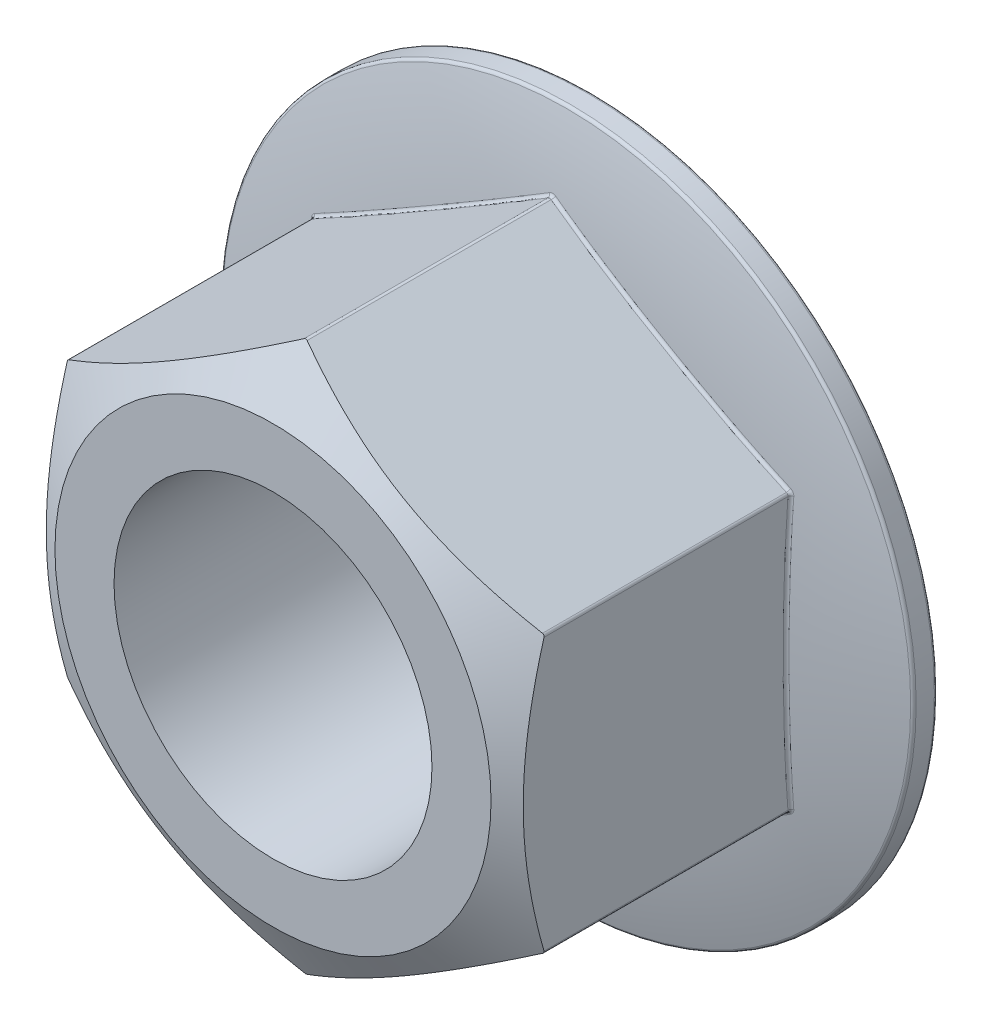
ISO-10303-21;
HEADER;
FILE_DESCRIPTION(('STEP AP214'),'2;1');
FILE_NAME('part.step','',(''),(''),'','','');
FILE_SCHEMA(('AUTOMOTIVE_DESIGN { 1 0 10303 214 1 1 1 1 }'));
ENDSEC;
DATA;
#1=APPLICATION_CONTEXT('core data for automotive mechanical design processes');
#2=APPLICATION_PROTOCOL_DEFINITION('international standard','automotive_design',2000,#1);
#3=PRODUCT_CONTEXT('',#1,'mechanical');
#4=PRODUCT('Part','Part','',(#3));
#5=PRODUCT_RELATED_PRODUCT_CATEGORY('part','',(#4));
#6=PRODUCT_DEFINITION_FORMATION('','',#4);
#7=PRODUCT_DEFINITION_CONTEXT('part definition',#1,'design');
#8=PRODUCT_DEFINITION('design','',#6,#7);
#9=PRODUCT_DEFINITION_SHAPE('','',#8);
#10=(LENGTH_UNIT() NAMED_UNIT(*) SI_UNIT(.MILLI.,.METRE.));
#11=(NAMED_UNIT(*) PLANE_ANGLE_UNIT() SI_UNIT($,.RADIAN.));
#12=(NAMED_UNIT(*) SI_UNIT($,.STERADIAN.) SOLID_ANGLE_UNIT());
#13=UNCERTAINTY_MEASURE_WITH_UNIT(LENGTH_MEASURE(1.E-05),#10,'distance_accuracy_value','');
#14=(GEOMETRIC_REPRESENTATION_CONTEXT(3) GLOBAL_UNCERTAINTY_ASSIGNED_CONTEXT((#13)) GLOBAL_UNIT_ASSIGNED_CONTEXT((#10,
#11,#12)) REPRESENTATION_CONTEXT('',''));
#15=CARTESIAN_POINT('',(0.,0.,0.));
#16=DIRECTION('',(0.,0.,1.));
#17=DIRECTION('',(1.,0.,0.));
#18=AXIS2_PLACEMENT_3D('',#15,#16,#17);
#19=CARTESIAN_POINT('',(0.,-8.54478398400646,-10.));
#20=DIRECTION('',(0.,0.,1.));
#21=DIRECTION('',(1.,0.,0.));
#22=AXIS2_PLACEMENT_3D('',#19,#20,#21);
#23=CYLINDRICAL_SURFACE('',#22,0.1);
#24=DIRECTION('',(0.,0.,1.));
#25=VECTOR('',#24,1.);
#26=CARTESIAN_POINT('',(0.0500000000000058,-8.6313865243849,-10.));
#27=LINE('',#26,#25);
#28=CARTESIAN_POINT('',(0.050000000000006,-8.6313865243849,-1.02394879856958));
#29=VERTEX_POINT('',#28);
#30=CARTESIAN_POINT('',(0.0499999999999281,-8.63138652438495,-8.69377175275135));
#31=VERTEX_POINT('',#30);
#32=EDGE_CURVE('E691',#29,#31,#27,.F.);
#33=ORIENTED_EDGE('',*,*,#32,.F.);
#34=CARTESIAN_POINT('',(0.052376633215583,-8.62997018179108,-1.02313922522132));
#35=CARTESIAN_POINT('',(0.0482059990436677,-8.63254089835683,-1.02460872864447));
#36=CARTESIAN_POINT('',(0.0437936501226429,-8.63482483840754,-1.02591369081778));
#37=CARTESIAN_POINT('',(0.0345919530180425,-8.63874230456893,-1.02815133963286));
#38=CARTESIAN_POINT('',(0.0298019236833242,-8.64037462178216,-1.02908333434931));
#39=CARTESIAN_POINT('',(0.0199543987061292,-8.64290526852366,-1.03052802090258));
#40=CARTESIAN_POINT('',(0.0148962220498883,-8.64380162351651,-1.03103958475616));
#41=CARTESIAN_POINT('',(0.00468430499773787,-8.64480554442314,-1.03161252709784));
#42=CARTESIAN_POINT('',(-0.000469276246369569,-8.64491432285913,-1.0316745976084));
#43=CARTESIAN_POINT('',(-0.0105041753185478,-8.64435248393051,-1.03135396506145));
#44=CARTESIAN_POINT('',(-0.0153879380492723,-8.64371391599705,-1.03098955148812));
#45=CARTESIAN_POINT('',(-0.0249695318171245,-8.64173992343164,-1.0298627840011));
#46=CARTESIAN_POINT('',(-0.0296672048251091,-8.64040391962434,-1.02910009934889));
#47=CARTESIAN_POINT('',(-0.0374166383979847,-8.63758312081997,-1.02748923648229));
#48=CARTESIAN_POINT('',(-0.0405469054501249,-8.63625699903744,-1.02673180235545));
#49=CARTESIAN_POINT('',(-0.0466121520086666,-8.63332013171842,-1.02505389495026));
#50=CARTESIAN_POINT('',(-0.0495477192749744,-8.63171030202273,-1.02413394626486));
#51=CARTESIAN_POINT('',(-0.0523766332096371,-8.62997018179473,-1.02313922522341));
#52=B_SPLINE_CURVE_WITH_KNOTS('',3,(#34,#35,#36,#37,#38,#39,#40,#41,#42,#43,#44,#45,#46,#47,#48,
#49,#50,#51),.UNSPECIFIED.,.F.,.F.,(4,2,2,2,2,2,2,2,4),(0.,0.015337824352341,0.030703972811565,
0.0461112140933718,0.0614947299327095,0.076241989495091,0.0910015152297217,0.101430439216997,
0.111826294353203),.UNSPECIFIED.);
#53=CARTESIAN_POINT('',(-0.0499999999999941,-8.6313865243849,-1.02394879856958));
#54=VERTEX_POINT('',#53);
#55=EDGE_CURVE('E624',#29,#54,#52,.T.);
#56=ORIENTED_EDGE('',*,*,#55,.T.);
#57=DIRECTION('',(0.,0.,1.));
#58=VECTOR('',#57,1.);
#59=CARTESIAN_POINT('',(-0.0499999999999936,-8.6313865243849,-10.));
#60=LINE('',#59,#58);
#61=CARTESIAN_POINT('',(-0.0499999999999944,-8.6313865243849,-8.69377175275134));
#62=VERTEX_POINT('',#61);
#63=EDGE_CURVE('E703',#62,#54,#60,.T.);
#64=ORIENTED_EDGE('',*,*,#63,.F.);
#65=CARTESIAN_POINT('',(0.0500000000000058,-8.6313865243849,-8.69377175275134));
#66=CARTESIAN_POINT('',(0.0193722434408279,-8.64906946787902,-8.69928264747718));
#67=CARTESIAN_POINT('',(-0.0193220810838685,-8.64909842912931,-8.69929174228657));
#68=CARTESIAN_POINT('',(-0.0499999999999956,-8.6313865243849,-8.69377175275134));
#69=(BOUNDED_CURVE() B_SPLINE_CURVE(3,(#65,#66,#67,#68),.UNSPECIFIED.,.F.,
.F.) B_SPLINE_CURVE_WITH_KNOTS((4,4),(0.000340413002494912,0.000548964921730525),
.UNSPECIFIED.) CURVE() GEOMETRIC_REPRESENTATION_ITEM() RATIONAL_B_SPLINE_CURVE((0.999999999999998,
0.999999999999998,0.999999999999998,0.999999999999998)) REPRESENTATION_ITEM(''));
#70=EDGE_CURVE('E497',#62,#31,#69,.F.);
#71=ORIENTED_EDGE('',*,*,#70,.T.);
#72=EDGE_LOOP('',(#33,#56,#64,#71));
#73=FACE_BOUND('',#72,.T.);
#74=ADVANCED_FACE('F35',(#73),#23,.T.);
#75=CARTESIAN_POINT('',(7.4,-4.27239199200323,-10.));
#76=DIRECTION('',(0.,0.,1.));
#77=DIRECTION('',(1.,0.,0.));
#78=AXIS2_PLACEMENT_3D('',#75,#76,#77);
#79=CYLINDRICAL_SURFACE('',#78,0.1);
#80=DIRECTION('',(0.,0.,1.));
#81=VECTOR('',#80,1.);
#82=CARTESIAN_POINT('',(7.5,-4.27239199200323,-10.));
#83=LINE('',#82,#81);
#84=CARTESIAN_POINT('',(7.5,-4.27239199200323,-1.02394879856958));
#85=VERTEX_POINT('',#84);
#86=CARTESIAN_POINT('',(7.5,-4.27239199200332,-8.69377175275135));
#87=VERTEX_POINT('',#86);
#88=EDGE_CURVE('E685',#85,#87,#83,.F.);
#89=ORIENTED_EDGE('',*,*,#88,.F.);
#90=CARTESIAN_POINT('',(7.49997175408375,-4.27001535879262,-1.0232555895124));
#91=CARTESIAN_POINT('',(7.50009361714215,-4.27491108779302,-1.02471516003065));
#92=CARTESIAN_POINT('',(7.49984627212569,-4.27987107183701,-1.02600972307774));
#93=CARTESIAN_POINT('',(7.49860069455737,-4.28978861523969,-1.02822597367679));
#94=CARTESIAN_POINT('',(7.49760112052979,-4.29474615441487,-1.02914699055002));
#95=CARTESIAN_POINT('',(7.49483442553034,-4.3045223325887,-1.03056963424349));
#96=CARTESIAN_POINT('',(7.49306527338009,-4.30934056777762,-1.0310701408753));
#97=CARTESIAN_POINT('',(7.4887988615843,-4.31866262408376,-1.03162155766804));
#98=CARTESIAN_POINT('',(7.48630270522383,-4.32316690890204,-1.03167314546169));
#99=CARTESIAN_POINT('',(7.48077374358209,-4.33155115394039,-1.03133296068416));
#100=CARTESIAN_POINT('',(7.47776694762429,-4.33544907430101,-1.03095916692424));
#101=CARTESIAN_POINT('',(7.47124570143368,-4.34273367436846,-1.02981454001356));
#102=CARTESIAN_POINT('',(7.46773085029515,-4.34611994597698,-1.02904339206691));
#103=CARTESIAN_POINT('',(7.46144732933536,-4.3513570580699,-1.02743117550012));
#104=CARTESIAN_POINT('',(7.4587794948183,-4.35336064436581,-1.02668372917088));
#105=CARTESIAN_POINT('',(7.45330107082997,-4.35706737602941,-1.02503196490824));
#106=CARTESIAN_POINT('',(7.45049096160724,-4.35877145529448,-1.02412815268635));
#107=CARTESIAN_POINT('',(7.44762336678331,-4.36032386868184,-1.02315225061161));
#108=B_SPLINE_CURVE_WITH_KNOTS('',3,(#90,#91,#92,#93,#94,#95,#96,#97,#98,#99,#100,#101,#102,
#103,#104,#105,#106,#107),.UNSPECIFIED.,.F.,.F.,(4,2,2,2,2,2,2,2,4),(0.,0.0153233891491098,
0.0306741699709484,0.0460657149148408,0.0614340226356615,0.0761761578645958,0.0909299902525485,
0.101168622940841,0.111374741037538),.UNSPECIFIED.);
#109=CARTESIAN_POINT('',(7.45,-4.35899453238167,-1.02394879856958));
#110=VERTEX_POINT('',#109);
#111=EDGE_CURVE('E647',#85,#110,#108,.T.);
#112=ORIENTED_EDGE('',*,*,#111,.T.);
#113=DIRECTION('',(0.,0.,1.));
#114=VECTOR('',#113,1.);
#115=CARTESIAN_POINT('',(7.45,-4.35899453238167,-10.));
#116=LINE('',#115,#114);
#117=CARTESIAN_POINT('',(7.45,-4.35899453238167,-8.69377175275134));
#118=VERTEX_POINT('',#117);
#119=EDGE_CURVE('E694',#118,#110,#116,.T.);
#120=ORIENTED_EDGE('',*,*,#119,.F.);
#121=CARTESIAN_POINT('',(7.5,-4.27239199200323,-8.69377175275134));
#122=CARTESIAN_POINT('',(7.5,-4.3077578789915,-8.6992826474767));
#123=CARTESIAN_POINT('',(7.48067791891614,-4.34128262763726,-8.69929174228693));
#124=CARTESIAN_POINT('',(7.45,-4.35899453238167,-8.69377175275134));
#125=(BOUNDED_CURVE() B_SPLINE_CURVE(3,(#121,#122,#123,#124),.UNSPECIFIED.,.F.,
.F.) B_SPLINE_CURVE_WITH_KNOTS((4,4),(0.000203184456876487,0.000411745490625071),
.UNSPECIFIED.) CURVE() GEOMETRIC_REPRESENTATION_ITEM() RATIONAL_B_SPLINE_CURVE((1.,1.,1.,1.)) REPRESENTATION_ITEM(''));
#126=EDGE_CURVE('E822',#118,#87,#125,.F.);
#127=ORIENTED_EDGE('',*,*,#126,.T.);
#128=EDGE_LOOP('',(#89,#112,#120,#127));
#129=FACE_BOUND('',#128,.T.);
#130=ADVANCED_FACE('F432',(#129),#79,.T.);
#131=CARTESIAN_POINT('',(7.4,4.27239199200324,-10.));
#132=DIRECTION('',(0.,0.,1.));
#133=DIRECTION('',(1.,0.,0.));
#134=AXIS2_PLACEMENT_3D('',#131,#132,#133);
#135=CYLINDRICAL_SURFACE('',#134,0.1);
#136=DIRECTION('',(0.,0.,1.));
#137=VECTOR('',#136,1.);
#138=CARTESIAN_POINT('',(7.45,4.35899453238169,-10.));
#139=LINE('',#138,#137);
#140=CARTESIAN_POINT('',(7.45,4.35899453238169,-1.02394879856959));
#141=VERTEX_POINT('',#140);
#142=CARTESIAN_POINT('',(7.45000000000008,4.35899453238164,-8.69377175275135));
#143=VERTEX_POINT('',#142);
#144=EDGE_CURVE('E688',#141,#143,#139,.F.);
#145=ORIENTED_EDGE('',*,*,#144,.F.);
#146=CARTESIAN_POINT('',(7.44762336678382,4.36032386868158,-1.02315225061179));
#147=CARTESIAN_POINT('',(7.45193380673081,4.35799557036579,-1.02462065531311));
#148=CARTESIAN_POINT('',(7.45611658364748,4.35531464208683,-1.02592446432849));
#149=CARTESIAN_POINT('',(7.46410699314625,4.34930141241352,-1.02815971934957));
#150=CARTESIAN_POINT('',(7.46791392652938,4.34596793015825,-1.02909048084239));
#151=CARTESIAN_POINT('',(7.47502563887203,4.33870272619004,-1.03053269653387));
#152=CARTESIAN_POINT('',(7.47832904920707,4.33476943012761,-1.03104302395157));
#153=CARTESIAN_POINT('',(7.48430048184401,4.32642604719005,-1.03161356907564));
#154=CARTESIAN_POINT('',(7.48696946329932,4.32201669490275,-1.031674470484));
#155=CARTESIAN_POINT('',(7.49149657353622,4.31304417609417,-1.03135165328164));
#156=CARTESIAN_POINT('',(7.49338362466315,4.30849487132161,-1.03098618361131));
#157=CARTESIAN_POINT('',(7.49646115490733,4.29920937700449,-1.02985739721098));
#158=CARTESIAN_POINT('',(7.49765108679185,4.29447304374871,-1.02909376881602));
#159=CARTESIAN_POINT('',(7.49906723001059,4.2864232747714,-1.02749565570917));
#160=CARTESIAN_POINT('',(7.49947748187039,4.28312152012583,-1.02675566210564));
#161=CARTESIAN_POINT('',(7.49996815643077,4.27654323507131,-1.02511928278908));
#162=CARTESIAN_POINT('',(7.50004961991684,4.27326665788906,-1.02422339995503));
#163=CARTESIAN_POINT('',(7.49997175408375,4.27001535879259,-1.02325558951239));
#164=B_SPLINE_CURVE_WITH_KNOTS('',3,(#146,#147,#148,#149,#150,#151,#152,#153,#154,#155,#156,
#157,#158,#159,#160,#161,#162,#163),.UNSPECIFIED.,.F.,.F.,(4,2,2,2,2,2,2,2,4),(0.,
0.0153363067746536,0.0307006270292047,0.0461059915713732,0.0614879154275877,0.076234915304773,
0.0909934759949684,0.1012002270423,0.111374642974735),.UNSPECIFIED.);
#165=CARTESIAN_POINT('',(7.5,4.27239199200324,-1.02394879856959));
#166=VERTEX_POINT('',#165);
#167=EDGE_CURVE('E642',#141,#166,#164,.T.);
#168=ORIENTED_EDGE('',*,*,#167,.T.);
#169=DIRECTION('',(0.,0.,1.));
#170=VECTOR('',#169,1.);
#171=CARTESIAN_POINT('',(7.5,4.27239199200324,-10.));
#172=LINE('',#171,#170);
#173=CARTESIAN_POINT('',(7.5,4.27239199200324,-8.69377175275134));
#174=VERTEX_POINT('',#173);
#175=EDGE_CURVE('E682',#174,#166,#172,.T.);
#176=ORIENTED_EDGE('',*,*,#175,.F.);
#177=CARTESIAN_POINT('',(7.45,4.35899453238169,-8.69377175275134));
#178=CARTESIAN_POINT('',(7.4806277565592,4.34131158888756,-8.69928264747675));
#179=CARTESIAN_POINT('',(7.5,4.30781580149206,-8.69929174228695));
#180=CARTESIAN_POINT('',(7.5,4.27239199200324,-8.69377175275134));
#181=(BOUNDED_CURVE() B_SPLINE_CURVE(3,(#177,#178,#179,#180),.UNSPECIFIED.,.F.,
.F.) B_SPLINE_CURVE_WITH_KNOTS((4,4),(0.000271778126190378,0.000480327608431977),
.UNSPECIFIED.) CURVE() GEOMETRIC_REPRESENTATION_ITEM() RATIONAL_B_SPLINE_CURVE((1.,1.,1.,1.)) REPRESENTATION_ITEM(''));
#182=EDGE_CURVE('E934',#174,#143,#181,.F.);
#183=ORIENTED_EDGE('',*,*,#182,.T.);
#184=EDGE_LOOP('',(#145,#168,#176,#183));
#185=FACE_BOUND('',#184,.T.);
#186=ADVANCED_FACE('F380',(#185),#135,.T.);
#187=CARTESIAN_POINT('',(0.,8.54478398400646,-10.));
#188=DIRECTION('',(0.,0.,1.));
#189=DIRECTION('',(1.,0.,0.));
#190=AXIS2_PLACEMENT_3D('',#187,#188,#189);
#191=CYLINDRICAL_SURFACE('',#190,0.1);
#192=DIRECTION('',(0.,0.,1.));
#193=VECTOR('',#192,1.);
#194=CARTESIAN_POINT('',(-0.0500000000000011,8.63138652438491,-10.));
#195=LINE('',#194,#193);
#196=CARTESIAN_POINT('',(-0.0500000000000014,8.63138652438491,-1.02394879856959));
#197=VERTEX_POINT('',#196);
#198=CARTESIAN_POINT('',(-0.0499999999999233,8.63138652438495,-8.69377175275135));
#199=VERTEX_POINT('',#198);
#200=EDGE_CURVE('E903',#197,#199,#195,.F.);
#201=ORIENTED_EDGE('',*,*,#200,.F.);
#202=CARTESIAN_POINT('',(-0.0523766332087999,8.62997018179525,-1.02313922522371));
#203=CARTESIAN_POINT('',(-0.0482059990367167,8.63254089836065,-1.02460872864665));
#204=CARTESIAN_POINT('',(-0.0437936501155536,8.63482483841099,-1.02591369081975));
#205=CARTESIAN_POINT('',(-0.0345919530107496,8.63874230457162,-1.02815133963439));
#206=CARTESIAN_POINT('',(-0.0298019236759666,8.64037462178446,-1.02908333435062));
#207=CARTESIAN_POINT('',(-0.0199543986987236,8.64290526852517,-1.03052802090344));
#208=CARTESIAN_POINT('',(-0.0148962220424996,8.64380162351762,-1.0310395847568));
#209=CARTESIAN_POINT('',(-0.00468430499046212,8.64480554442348,-1.03161252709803));
#210=CARTESIAN_POINT('',(0.000469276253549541,8.64491432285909,-1.03167459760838));
#211=CARTESIAN_POINT('',(0.010504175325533,8.64435248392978,-1.03135396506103));
#212=CARTESIAN_POINT('',(0.0153879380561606,8.64371391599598,-1.03098955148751));
#213=CARTESIAN_POINT('',(0.024969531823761,8.64173992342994,-1.02986278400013));
#214=CARTESIAN_POINT('',(0.0296672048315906,8.64040391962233,-1.02910009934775));
#215=CARTESIAN_POINT('',(0.0374166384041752,8.63758312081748,-1.02748923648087));
#216=CARTESIAN_POINT('',(0.0405469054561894,8.63625699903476,-1.02673180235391));
#217=CARTESIAN_POINT('',(0.0466121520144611,8.63332013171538,-1.02505389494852));
#218=CARTESIAN_POINT('',(0.0495477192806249,8.63171030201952,-1.02413394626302));
#219=CARTESIAN_POINT('',(0.0523766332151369,8.62997018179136,-1.02313922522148));
#220=B_SPLINE_CURVE_WITH_KNOTS('',3,(#202,#203,#204,#205,#206,#207,#208,#209,#210,#211,#212,
#213,#214,#215,#216,#217,#218,#219),.UNSPECIFIED.,.F.,.F.,(4,2,2,2,2,2,2,2,4),(0.,
0.0153378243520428,0.0307039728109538,0.046111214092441,0.061494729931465,0.0762419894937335,
0.0910015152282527,0.10143043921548,0.111826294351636),.UNSPECIFIED.);
#221=CARTESIAN_POINT('',(0.0499999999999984,8.63138652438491,-1.02394879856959));
#222=VERTEX_POINT('',#221);
#223=EDGE_CURVE('E618',#197,#222,#220,.T.);
#224=ORIENTED_EDGE('',*,*,#223,.T.);
#225=DIRECTION('',(0.,0.,1.));
#226=VECTOR('',#225,1.);
#227=CARTESIAN_POINT('',(0.0499999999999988,8.63138652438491,-10.));
#228=LINE('',#227,#226);
#229=CARTESIAN_POINT('',(0.0499999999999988,8.63138652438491,-8.69377175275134));
#230=VERTEX_POINT('',#229);
#231=EDGE_CURVE('E922',#230,#222,#228,.T.);
#232=ORIENTED_EDGE('',*,*,#231,.F.);
#233=CARTESIAN_POINT('',(-0.0500000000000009,8.63138652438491,-8.69377175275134));
#234=CARTESIAN_POINT('',(-0.0193722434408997,8.64906946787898,-8.69928264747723));
#235=CARTESIAN_POINT('',(0.0193220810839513,8.64909842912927,-8.69929174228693));
#236=CARTESIAN_POINT('',(0.0499999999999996,8.63138652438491,-8.69377175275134));
#237=(BOUNDED_CURVE() B_SPLINE_CURVE(3,(#233,#234,#235,#236),.UNSPECIFIED.,.F.,
.F.) B_SPLINE_CURVE_WITH_KNOTS((4,4),(0.000340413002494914,0.000548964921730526),
.UNSPECIFIED.) CURVE() GEOMETRIC_REPRESENTATION_ITEM() RATIONAL_B_SPLINE_CURVE((1.,1.,1.,1.)) REPRESENTATION_ITEM(''));
#238=EDGE_CURVE('E252',#230,#199,#237,.F.);
#239=ORIENTED_EDGE('',*,*,#238,.T.);
#240=EDGE_LOOP('',(#201,#224,#232,#239));
#241=FACE_BOUND('',#240,.T.);
#242=ADVANCED_FACE('F319',(#241),#191,.T.);
#243=CARTESIAN_POINT('',(-7.4,4.27239199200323,-10.));
#244=DIRECTION('',(0.,0.,1.));
#245=DIRECTION('',(1.,0.,0.));
#246=AXIS2_PLACEMENT_3D('',#243,#244,#245);
#247=CYLINDRICAL_SURFACE('',#246,0.1);
#248=DIRECTION('',(0.,0.,1.));
#249=VECTOR('',#248,1.);
#250=CARTESIAN_POINT('',(-7.5,4.27239199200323,-10.));
#251=LINE('',#250,#249);
#252=CARTESIAN_POINT('',(-7.5,4.27239199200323,-1.02394879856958));
#253=VERTEX_POINT('',#252);
#254=CARTESIAN_POINT('',(-7.5,4.27239199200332,-8.69377175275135));
#255=VERTEX_POINT('',#254);
#256=EDGE_CURVE('E889',#253,#255,#251,.F.);
#257=ORIENTED_EDGE('',*,*,#256,.F.);
#258=CARTESIAN_POINT('',(-7.49997175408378,4.27001535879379,-1.02325558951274));
#259=CARTESIAN_POINT('',(-7.50009361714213,4.27491108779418,-1.02471516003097));
#260=CARTESIAN_POINT('',(-7.49984627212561,4.27987107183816,-1.02600972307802));
#261=CARTESIAN_POINT('',(-7.49860069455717,4.28978861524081,-1.02822597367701));
#262=CARTESIAN_POINT('',(-7.49760112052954,4.29474615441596,-1.02914699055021));
#263=CARTESIAN_POINT('',(-7.49483442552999,4.30452233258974,-1.03056963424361));
#264=CARTESIAN_POINT('',(-7.49306527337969,4.30934056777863,-1.03107014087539));
#265=CARTESIAN_POINT('',(-7.48879886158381,4.3186626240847,-1.03162155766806));
#266=CARTESIAN_POINT('',(-7.48630270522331,4.32316690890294,-1.03167314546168));
#267=CARTESIAN_POINT('',(-7.48077374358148,4.33155115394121,-1.0313329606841));
#268=CARTESIAN_POINT('',(-7.47776694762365,4.3354490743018,-1.03095916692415));
#269=CARTESIAN_POINT('',(-7.47124570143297,4.34273367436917,-1.02981454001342));
#270=CARTESIAN_POINT('',(-7.46773085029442,4.34611994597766,-1.02904339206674));
#271=CARTESIAN_POINT('',(-7.46144732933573,4.35135705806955,-1.0274311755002));
#272=CARTESIAN_POINT('',(-7.45877949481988,4.35336064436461,-1.02668372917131));
#273=CARTESIAN_POINT('',(-7.45330107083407,4.35706737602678,-1.02503196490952));
#274=CARTESIAN_POINT('',(-7.45049096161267,4.35877145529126,-1.02412815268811));
#275=CARTESIAN_POINT('',(-7.44762336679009,4.36032386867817,-1.02315225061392));
#276=B_SPLINE_CURVE_WITH_KNOTS('',3,(#258,#259,#260,#261,#262,#263,#264,#265,#266,#267,#268,
#269,#270,#271,#272,#273,#274,#275),.UNSPECIFIED.,.F.,.F.,(4,2,2,2,2,2,2,2,4),(0.,
0.0153233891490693,0.0306741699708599,0.0460657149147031,0.0614340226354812,0.0761761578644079,
0.0909299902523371,0.101168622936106,0.111374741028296),.UNSPECIFIED.);
#277=CARTESIAN_POINT('',(-7.45,4.35899453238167,-1.02394879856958));
#278=VERTEX_POINT('',#277);
#279=EDGE_CURVE('E56',#253,#278,#276,.T.);
#280=ORIENTED_EDGE('',*,*,#279,.T.);
#281=DIRECTION('',(0.,0.,1.));
#282=VECTOR('',#281,1.);
#283=CARTESIAN_POINT('',(-7.45,4.35899453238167,-10.));
#284=LINE('',#283,#282);
#285=CARTESIAN_POINT('',(-7.45,4.35899453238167,-8.69377175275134));
#286=VERTEX_POINT('',#285);
#287=EDGE_CURVE('E899',#286,#278,#284,.T.);
#288=ORIENTED_EDGE('',*,*,#287,.F.);
#289=CARTESIAN_POINT('',(-7.5,4.27239199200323,-8.69377175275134));
#290=CARTESIAN_POINT('',(-7.5,4.30775787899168,-8.69928264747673));
#291=CARTESIAN_POINT('',(-7.48067791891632,4.34128262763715,-8.69929174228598));
#292=CARTESIAN_POINT('',(-7.45,4.35899453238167,-8.69377175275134));
#293=(BOUNDED_CURVE() B_SPLINE_CURVE(3,(#289,#290,#291,#292),.UNSPECIFIED.,.F.,
.F.) B_SPLINE_CURVE_WITH_KNOTS((4,4),(0.000203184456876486,0.000411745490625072),
.UNSPECIFIED.) CURVE() GEOMETRIC_REPRESENTATION_ITEM() RATIONAL_B_SPLINE_CURVE((1.,1.,1.,1.)) REPRESENTATION_ITEM(''));
#294=EDGE_CURVE('E236',#286,#255,#293,.F.);
#295=ORIENTED_EDGE('',*,*,#294,.T.);
#296=EDGE_LOOP('',(#257,#280,#288,#295));
#297=FACE_BOUND('',#296,.T.);
#298=ADVANCED_FACE('F317',(#297),#247,.T.);
#299=CARTESIAN_POINT('',(-7.4,-4.27239199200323,-10.));
#300=DIRECTION('',(0.,0.,1.));
#301=DIRECTION('',(1.,0.,0.));
#302=AXIS2_PLACEMENT_3D('',#299,#300,#301);
#303=CYLINDRICAL_SURFACE('',#302,0.1);
#304=DIRECTION('',(0.,0.,1.));
#305=VECTOR('',#304,1.);
#306=CARTESIAN_POINT('',(-7.45,-4.35899453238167,-10.));
#307=LINE('',#306,#305);
#308=CARTESIAN_POINT('',(-7.45,-4.35899453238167,-1.02394879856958));
#309=VERTEX_POINT('',#308);
#310=CARTESIAN_POINT('',(-7.45000000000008,-4.35899453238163,-8.69377175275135));
#311=VERTEX_POINT('',#310);
#312=EDGE_CURVE('E42',#309,#311,#307,.F.);
#313=ORIENTED_EDGE('',*,*,#312,.F.);
#314=CARTESIAN_POINT('',(-7.44762336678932,-4.36032386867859,-1.02315225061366));
#315=CARTESIAN_POINT('',(-7.45193380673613,-4.35799557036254,-1.02462065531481));
#316=CARTESIAN_POINT('',(-7.45611658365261,-4.35531464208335,-1.02592446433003));
#317=CARTESIAN_POINT('',(-7.46410699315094,-4.3493014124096,-1.02815971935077));
#318=CARTESIAN_POINT('',(-7.46791392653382,-4.34596793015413,-1.02909048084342));
#319=CARTESIAN_POINT('',(-7.47502563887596,-4.33870272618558,-1.03053269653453));
#320=CARTESIAN_POINT('',(-7.47832904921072,-4.33476943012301,-1.03104302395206));
#321=CARTESIAN_POINT('',(-7.48430048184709,-4.32642604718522,-1.03161356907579));
#322=CARTESIAN_POINT('',(-7.48696946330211,-4.32201669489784,-1.03167447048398));
#323=CARTESIAN_POINT('',(-7.49149657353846,-4.31304417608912,-1.03135165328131));
#324=CARTESIAN_POINT('',(-7.49338362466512,-4.30849487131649,-1.03098618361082));
#325=CARTESIAN_POINT('',(-7.49646115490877,-4.29920937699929,-1.02985739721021));
#326=CARTESIAN_POINT('',(-7.49765108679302,-4.29447304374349,-1.02909376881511));
#327=CARTESIAN_POINT('',(-7.49906723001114,-4.28642327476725,-1.02749565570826));
#328=CARTESIAN_POINT('',(-7.49947748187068,-4.28312152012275,-1.0267556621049));
#329=CARTESIAN_POINT('',(-7.49996815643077,-4.27654323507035,-1.02511928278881));
#330=CARTESIAN_POINT('',(-7.5000496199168,-4.27326665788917,-1.02422339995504));
#331=CARTESIAN_POINT('',(-7.49997175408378,-4.27001535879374,-1.02325558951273));
#332=B_SPLINE_CURVE_WITH_KNOTS('',3,(#314,#315,#316,#317,#318,#319,#320,#321,#322,#323,#324,
#325,#326,#327,#328,#329,#330,#331),.UNSPECIFIED.,.F.,.F.,(4,2,2,2,2,2,2,2,4),(0.,
0.0153363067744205,0.0307006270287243,0.0461059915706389,0.0614879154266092,0.0762349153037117,
0.090993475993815,0.101200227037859,0.111374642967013),.UNSPECIFIED.);
#333=CARTESIAN_POINT('',(-7.5,-4.27239199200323,-1.02394879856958));
#334=VERTEX_POINT('',#333);
#335=EDGE_CURVE('E582',#309,#334,#332,.T.);
#336=ORIENTED_EDGE('',*,*,#335,.T.);
#337=DIRECTION('',(0.,0.,1.));
#338=VECTOR('',#337,1.);
#339=CARTESIAN_POINT('',(-7.5,-4.27239199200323,-10.));
#340=LINE('',#339,#338);
#341=CARTESIAN_POINT('',(-7.5,-4.27239199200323,-8.69377175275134));
#342=VERTEX_POINT('',#341);
#343=EDGE_CURVE('E885',#342,#334,#340,.T.);
#344=ORIENTED_EDGE('',*,*,#343,.F.);
#345=CARTESIAN_POINT('',(-7.45,-4.35899453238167,-8.69377175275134));
#346=CARTESIAN_POINT('',(-7.4806277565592,-4.34131158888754,-8.69928264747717));
#347=CARTESIAN_POINT('',(-7.5,-4.30781580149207,-8.69929174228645));
#348=CARTESIAN_POINT('',(-7.5,-4.27239199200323,-8.69377175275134));
#349=(BOUNDED_CURVE() B_SPLINE_CURVE(3,(#345,#346,#347,#348),.UNSPECIFIED.,.F.,
.F.) B_SPLINE_CURVE_WITH_KNOTS((4,4),(0.000271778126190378,0.000480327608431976),
.UNSPECIFIED.) CURVE() GEOMETRIC_REPRESENTATION_ITEM() RATIONAL_B_SPLINE_CURVE((0.999999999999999,
0.999999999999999,0.999999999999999,0.999999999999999)) REPRESENTATION_ITEM(''));
#350=EDGE_CURVE('E985',#342,#311,#349,.F.);
#351=ORIENTED_EDGE('',*,*,#350,.T.);
#352=EDGE_LOOP('',(#313,#336,#344,#351));
#353=FACE_BOUND('',#352,.T.);
#354=ADVANCED_FACE('F722',(#353),#303,.T.);
#355=CARTESIAN_POINT('',(-7.5,-4.33012701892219,-10.));
#356=DIRECTION('',(-0.5,-0.866025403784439,0.));
#357=DIRECTION('',(0.866025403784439,-0.5,0.));
#358=AXIS2_PLACEMENT_3D('',#355,#356,#357);
#359=PLANE('',#358);
#360=ORIENTED_EDGE('',*,*,#63,.T.);
#361=CARTESIAN_POINT('',(-0.047623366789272,-8.63275867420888,-1.02473323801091));
#362=CARTESIAN_POINT('',(-0.212089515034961,-8.53780409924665,-0.970446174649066));
#363=CARTESIAN_POINT('',(-0.377168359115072,-8.44249578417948,-0.918668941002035));
#364=CARTESIAN_POINT('',(-0.708644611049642,-8.25111788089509,-0.820823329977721));
#365=CARTESIAN_POINT('',(-0.875042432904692,-8.15504805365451,-0.774756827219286));
#366=CARTESIAN_POINT('',(-1.37687622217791,-7.86531418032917,-0.646033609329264));
#367=CARTESIAN_POINT('',(-1.71427902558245,-7.67051458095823,-0.573081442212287));
#368=CARTESIAN_POINT('',(-2.21918932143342,-7.37900448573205,-0.488010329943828));
#369=CARTESIAN_POINT('',(-2.38522027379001,-7.28314647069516,-0.463869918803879));
#370=CARTESIAN_POINT('',(-2.71800435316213,-7.09101349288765,-0.423619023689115));
#371=CARTESIAN_POINT('',(-2.88475739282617,-6.99473858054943,-0.407507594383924));
#372=CARTESIAN_POINT('',(-3.2185346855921,-6.80203217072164,-0.383723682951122));
#373=CARTESIAN_POINT('',(-3.38555844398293,-6.70560095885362,-0.376042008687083));
#374=CARTESIAN_POINT('',(-3.71972494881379,-6.51266983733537,-0.369272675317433));
#375=CARTESIAN_POINT('',(-3.88686769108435,-6.41616993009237,-0.370184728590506));
#376=CARTESIAN_POINT('',(-4.33853356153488,-6.15540051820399,-0.384276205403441));
#377=CARTESIAN_POINT('',(-4.62289156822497,-5.99122634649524,-0.405636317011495));
#378=CARTESIAN_POINT('',(-5.18973094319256,-5.66396148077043,-0.471846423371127));
#379=CARTESIAN_POINT('',(-5.47221049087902,-5.50087183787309,-0.516716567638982));
#380=CARTESIAN_POINT('',(-6.04008056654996,-5.17301189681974,-0.628279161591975));
#381=CARTESIAN_POINT('',(-6.32540369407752,-5.00828051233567,-0.695418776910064));
#382=CARTESIAN_POINT('',(-6.89192895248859,-4.68119700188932,-0.847566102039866));
#383=CARTESIAN_POINT('',(-7.17313769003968,-4.51884106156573,-0.932540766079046));
#384=CARTESIAN_POINT('',(-7.45237663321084,-4.35762238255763,-1.02473323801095));
#385=B_SPLINE_CURVE_WITH_KNOTS('',3,(#361,#362,#363,#364,#365,#366,#367,#368,#369,#370,#371,
#372,#373,#374,#375,#376,#377,#378,#379,#380,#381,#382,#383,#384),.UNSPECIFIED.,.F.,.F.,(4,2,2,
2,2,2,2,2,2,2,2,4),(0.,0.592500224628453,1.18519443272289,2.3730103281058,2.95256426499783,
3.53204994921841,4.11090310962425,4.6897368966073,5.67588456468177,6.66287880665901,
7.67103028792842,8.67733004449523),.UNSPECIFIED.);
#386=EDGE_CURVE('E611',#54,#309,#385,.T.);
#387=ORIENTED_EDGE('',*,*,#386,.T.);
#388=ORIENTED_EDGE('',*,*,#312,.T.);
#389=CARTESIAN_POINT('',(-0.0499999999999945,-8.6313865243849,-8.69377175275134));
#390=CARTESIAN_POINT('',(-1.27922288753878,-7.92169435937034,-8.58318320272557));
#391=CARTESIAN_POINT('',(-2.51301642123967,-7.20936333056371,-8.54317372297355));
#392=CARTESIAN_POINT('',(-4.98576739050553,-5.78171989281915,-8.5431445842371));
#393=CARTESIAN_POINT('',(-6.21990053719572,-5.06919278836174,-8.58310434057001));
#394=CARTESIAN_POINT('',(-7.45000000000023,-4.35899453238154,-8.69377175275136));
#395=(BOUNDED_CURVE() B_SPLINE_CURVE(3,(#389,#390,#391,#392,#393,#394),.UNSPECIFIED.,.F.,
.F.) B_SPLINE_CURVE_WITH_KNOTS((4,2,4),(0.0110469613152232,0.0152869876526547,
0.0195270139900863),
.UNSPECIFIED.) CURVE() GEOMETRIC_REPRESENTATION_ITEM() RATIONAL_B_SPLINE_CURVE((1.,1.,1.,1.,1.,1.)) REPRESENTATION_ITEM(''));
#396=EDGE_CURVE('E156',#311,#62,#395,.F.);
#397=ORIENTED_EDGE('',*,*,#396,.T.);
#398=EDGE_LOOP('',(#360,#387,#388,#397));
#399=FACE_BOUND('',#398,.T.);
#400=ADVANCED_FACE('F713',(#399),#359,.T.);
#401=CARTESIAN_POINT('',(0.,-8.66025403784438,-10.));
#402=DIRECTION('',(0.5,-0.866025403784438,0.));
#403=DIRECTION('',(0.866025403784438,0.5,0.));
#404=AXIS2_PLACEMENT_3D('',#401,#402,#403);
#405=PLANE('',#404);
#406=ORIENTED_EDGE('',*,*,#119,.T.);
#407=CARTESIAN_POINT('',(7.45237663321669,-4.35762238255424,-1.02473323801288));
#408=CARTESIAN_POINT('',(7.28791048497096,-4.4525769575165,-0.970446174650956));
#409=CARTESIAN_POINT('',(7.12283164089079,-4.5478852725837,-0.918668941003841));
#410=CARTESIAN_POINT('',(6.79135538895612,-4.73926317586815,-0.820823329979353));
#411=CARTESIAN_POINT('',(6.62495756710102,-4.83533300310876,-0.77475682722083));
#412=CARTESIAN_POINT('',(6.12312377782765,-5.12506687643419,-0.646033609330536));
#413=CARTESIAN_POINT('',(5.785720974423,-5.3198664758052,-0.573081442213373));
#414=CARTESIAN_POINT('',(5.28081067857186,-5.61137657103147,-0.488010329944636));
#415=CARTESIAN_POINT('',(5.11477972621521,-5.70723458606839,-0.463869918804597));
#416=CARTESIAN_POINT('',(4.78199564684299,-5.89936756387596,-0.423619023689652));
#417=CARTESIAN_POINT('',(4.6152426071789,-5.99564247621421,-0.40750759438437));
#418=CARTESIAN_POINT('',(4.28146531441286,-6.18834888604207,-0.38372368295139));
#419=CARTESIAN_POINT('',(4.11444155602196,-6.28478009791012,-0.376042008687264));
#420=CARTESIAN_POINT('',(3.78027505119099,-6.47771121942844,-0.369272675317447));
#421=CARTESIAN_POINT('',(3.61313230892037,-6.57421112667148,-0.370184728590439));
#422=CARTESIAN_POINT('',(3.16146643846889,-6.8349805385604,-0.384276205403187));
#423=CARTESIAN_POINT('',(2.87710843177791,-6.99915471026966,-0.405636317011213));
#424=CARTESIAN_POINT('',(2.31026905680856,-7.3264195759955,-0.47184642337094));
#425=CARTESIAN_POINT('',(2.02778950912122,-7.48950921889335,-0.516716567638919));
#426=CARTESIAN_POINT('',(1.45991943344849,-7.81736915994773,-0.628279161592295));
#427=CARTESIAN_POINT('',(1.17459630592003,-7.98210054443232,-0.695418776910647));
#428=CARTESIAN_POINT('',(0.608071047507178,-8.3091840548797,-0.847566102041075));
#429=CARTESIAN_POINT('',(0.326862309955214,-8.4715399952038,-0.932540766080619));
#430=CARTESIAN_POINT('',(0.0476233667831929,-8.63275867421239,-1.02473323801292));
#431=B_SPLINE_CURVE_WITH_KNOTS('',3,(#407,#408,#409,#410,#411,#412,#413,#414,#415,#416,#417,
#418,#419,#420,#421,#422,#423,#424,#425,#426,#427,#428,#429,#430),.UNSPECIFIED.,.F.,.F.,(4,2,2,
2,2,2,2,2,2,2,2,4),(0.,0.592500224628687,1.18519443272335,2.37301032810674,2.95256426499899,
3.53204994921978,4.11090310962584,4.68973689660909,5.67588456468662,6.66287880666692,
7.67103028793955,8.67733004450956),.UNSPECIFIED.);
#432=EDGE_CURVE('E636',#110,#29,#431,.T.);
#433=ORIENTED_EDGE('',*,*,#432,.T.);
#434=ORIENTED_EDGE('',*,*,#32,.T.);
#435=CARTESIAN_POINT('',(7.45,-4.35899453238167,-8.69377175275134));
#436=CARTESIAN_POINT('',(6.22077711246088,-5.06868669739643,-8.58318320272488));
#437=CARTESIAN_POINT('',(4.98698357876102,-5.78101772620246,-8.54317372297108));
#438=CARTESIAN_POINT('',(2.51423260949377,-7.20866116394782,-8.54314458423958));
#439=CARTESIAN_POINT('',(1.28009946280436,-7.92118826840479,-8.58310434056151));
#440=CARTESIAN_POINT('',(0.0499999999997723,-8.63138652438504,-8.69377175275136));
#441=(BOUNDED_CURVE() B_SPLINE_CURVE(3,(#435,#436,#437,#438,#439,#440),.UNSPECIFIED.,.F.,
.F.) B_SPLINE_CURVE_WITH_KNOTS((4,2,4),(0.011046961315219,0.0152869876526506,
0.0195270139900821),
.UNSPECIFIED.) CURVE() GEOMETRIC_REPRESENTATION_ITEM() RATIONAL_B_SPLINE_CURVE((1.,1.,1.,1.,1.,1.)) REPRESENTATION_ITEM(''));
#442=EDGE_CURVE('E693',#31,#118,#441,.F.);
#443=ORIENTED_EDGE('',*,*,#442,.T.);
#444=EDGE_LOOP('',(#406,#433,#434,#443));
#445=FACE_BOUND('',#444,.T.);
#446=ADVANCED_FACE('F663',(#445),#405,.T.);
#447=CARTESIAN_POINT('',(7.5,-4.33012701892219,-10.));
#448=DIRECTION('',(1.,0.,0.));
#449=DIRECTION('',(0.,1.,0.));
#450=AXIS2_PLACEMENT_3D('',#447,#448,#449);
#451=PLANE('',#450);
#452=ORIENTED_EDGE('',*,*,#175,.T.);
#453=CARTESIAN_POINT('',(7.5,4.2747686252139,-1.02462812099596));
#454=CARTESIAN_POINT('',(7.5,4.08486253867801,-0.970345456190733));
#455=CARTESIAN_POINT('',(7.5,3.89424898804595,-0.918572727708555));
#456=CARTESIAN_POINT('',(7.5,3.51149940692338,-0.82073632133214));
#457=CARTESIAN_POINT('',(7.5,3.31936289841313,-0.774674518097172));
#458=CARTESIAN_POINT('',(7.5,2.73990495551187,-0.645965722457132));
#459=CARTESIAN_POINT('',(7.5,2.35031256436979,-0.573023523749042));
#460=CARTESIAN_POINT('',(7.5,1.76730263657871,-0.48796725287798));
#461=CARTESIAN_POINT('',(7.5,1.5755897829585,-0.463831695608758));
#462=CARTESIAN_POINT('',(7.5,1.19133037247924,-0.423590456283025));
#463=CARTESIAN_POINT('',(7.5,0.998783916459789,-0.407483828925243));
#464=CARTESIAN_POINT('',(7.5,0.61337800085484,-0.383709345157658));
#465=CARTESIAN_POINT('',(7.5,0.420519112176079,-0.376032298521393));
#466=CARTESIAN_POINT('',(7.5,0.0346641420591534,-0.369271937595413));
#467=CARTESIAN_POINT('',(7.5,-0.158331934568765,-0.370188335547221));
#468=CARTESIAN_POINT('',(7.5,-0.679812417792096,-0.384289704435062));
#469=CARTESIAN_POINT('',(7.5,-1.00810605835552,-0.405651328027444));
#470=CARTESIAN_POINT('',(7.5,-1.66252684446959,-0.471856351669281));
#471=CARTESIAN_POINT('',(7.5,-1.98865188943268,-0.516719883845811));
#472=CARTESIAN_POINT('',(7.5,-2.64426179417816,-0.628262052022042));
#473=CARTESIAN_POINT('',(7.5,-2.97366887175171,-0.695387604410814));
#474=CARTESIAN_POINT('',(7.5,-3.62772634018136,-0.847501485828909));
#475=CARTESIAN_POINT('',(7.5,-3.95238435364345,-0.932456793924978));
#476=CARTESIAN_POINT('',(7.5,-4.27476862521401,-1.02462812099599));
#477=B_SPLINE_CURVE_WITH_KNOTS('',3,(#453,#454,#455,#456,#457,#458,#459,#460,#461,#462,#463,
#464,#465,#466,#467,#468,#469,#470,#471,#472,#473,#474,#475,#476),.UNSPECIFIED.,.F.,.F.,(4,2,2,
2,2,2,2,2,2,2,2,4),(0.,0.592487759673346,1.18516949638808,2.3729597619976,2.95250242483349,
3.53197683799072,4.11081885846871,4.68964149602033,5.67562622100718,6.66245694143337,
7.67043653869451,8.67656556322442),.UNSPECIFIED.);
#478=EDGE_CURVE('E162',#166,#85,#477,.T.);
#479=ORIENTED_EDGE('',*,*,#478,.T.);
#480=ORIENTED_EDGE('',*,*,#88,.T.);
#481=CARTESIAN_POINT('',(7.5,4.27239199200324,-8.69377175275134));
#482=CARTESIAN_POINT('',(7.5,2.85300766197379,-8.5831832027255));
#483=CARTESIAN_POINT('',(7.5,1.42834560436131,-8.54317372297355));
#484=CARTESIAN_POINT('',(7.5,-1.42694127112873,-8.5431445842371));
#485=CARTESIAN_POINT('',(7.5,-2.85199548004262,-8.58310434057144));
#486=CARTESIAN_POINT('',(7.5,-4.2723919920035,-8.69377175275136));
#487=(BOUNDED_CURVE() B_SPLINE_CURVE(3,(#481,#482,#483,#484,#485,#486),.UNSPECIFIED.,.F.,
.F.) B_SPLINE_CURVE_WITH_KNOTS((4,2,4),(0.011046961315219,0.0152869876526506,
0.0195270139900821),
.UNSPECIFIED.) CURVE() GEOMETRIC_REPRESENTATION_ITEM() RATIONAL_B_SPLINE_CURVE((1.,1.,1.,1.,1.,1.)) REPRESENTATION_ITEM(''));
#488=EDGE_CURVE('E687',#87,#174,#487,.F.);
#489=ORIENTED_EDGE('',*,*,#488,.T.);
#490=EDGE_LOOP('',(#452,#479,#480,#489));
#491=FACE_BOUND('',#490,.T.);
#492=ADVANCED_FACE('F659',(#491),#451,.T.);
#493=CARTESIAN_POINT('',(7.5,4.3301270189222,-10.));
#494=DIRECTION('',(0.499999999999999,0.866025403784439,0.));
#495=DIRECTION('',(-0.866025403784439,0.499999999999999,0.));
#496=AXIS2_PLACEMENT_3D('',#493,#494,#495);
#497=PLANE('',#496);
#498=ORIENTED_EDGE('',*,*,#231,.T.);
#499=CARTESIAN_POINT('',(0.0476233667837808,8.63275867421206,-1.02473323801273));
#500=CARTESIAN_POINT('',(0.212089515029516,8.5378040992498,-0.97044617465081));
#501=CARTESIAN_POINT('',(0.377168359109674,8.44249578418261,-0.918668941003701));
#502=CARTESIAN_POINT('',(0.708644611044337,8.25111788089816,-0.820823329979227));
#503=CARTESIAN_POINT('',(0.875042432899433,8.15504805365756,-0.774756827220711));
#504=CARTESIAN_POINT('',(1.37687622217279,7.86531418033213,-0.646033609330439));
#505=CARTESIAN_POINT('',(1.71427902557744,7.67051458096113,-0.573081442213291));
#506=CARTESIAN_POINT('',(2.21918932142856,7.37900448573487,-0.488010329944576));
#507=CARTESIAN_POINT('',(2.38522027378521,7.28314647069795,-0.463869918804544));
#508=CARTESIAN_POINT('',(2.71800435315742,7.09101349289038,-0.423619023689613));
#509=CARTESIAN_POINT('',(2.88475739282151,6.99473858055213,-0.407507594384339));
#510=CARTESIAN_POINT('',(3.21853468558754,6.80203217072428,-0.383723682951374));
#511=CARTESIAN_POINT('',(3.38555844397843,6.70560095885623,-0.376042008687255));
#512=CARTESIAN_POINT('',(3.7197249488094,6.51266983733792,-0.369272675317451));
#513=CARTESIAN_POINT('',(3.88686769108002,6.41616993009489,-0.370184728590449));
#514=CARTESIAN_POINT('',(4.33853356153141,6.155400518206,-0.384276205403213));
#515=CARTESIAN_POINT('',(4.62289156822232,5.99122634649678,-0.405636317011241));
#516=CARTESIAN_POINT('',(5.18973094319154,5.66396148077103,-0.471846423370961));
#517=CARTESIAN_POINT('',(5.47221049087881,5.50087183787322,-0.516716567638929));
#518=CARTESIAN_POINT('',(6.04008056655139,5.17301189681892,-0.628279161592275));
#519=CARTESIAN_POINT('',(6.32540369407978,5.00828051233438,-0.695418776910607));
#520=CARTESIAN_POINT('',(6.89192895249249,4.68119700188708,-0.847566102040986));
#521=CARTESIAN_POINT('',(7.17313769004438,4.51884106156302,-0.9325407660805));
#522=CARTESIAN_POINT('',(7.45237663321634,4.35762238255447,-1.02473323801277));
#523=B_SPLINE_CURVE_WITH_KNOTS('',3,(#499,#500,#501,#502,#503,#504,#505,#506,#507,#508,#509,
#510,#511,#512,#513,#514,#515,#516,#517,#518,#519,#520,#521,#522),.UNSPECIFIED.,.F.,.F.,(4,2,2,
2,2,2,2,2,2,2,2,4),(0.,0.592500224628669,1.18519443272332,2.37301032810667,2.9525642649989,
3.53204994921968,4.11090310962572,4.68973689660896,5.67588456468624,6.66287880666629,
7.67103028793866,8.67733004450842),.UNSPECIFIED.);
#524=EDGE_CURVE('E630',#222,#141,#523,.T.);
#525=ORIENTED_EDGE('',*,*,#524,.T.);
#526=ORIENTED_EDGE('',*,*,#144,.T.);
#527=CARTESIAN_POINT('',(0.049999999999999,8.63138652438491,-8.69377175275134));
#528=CARTESIAN_POINT('',(1.27922288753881,7.92169435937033,-8.58318320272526));
#529=CARTESIAN_POINT('',(2.51301642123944,7.20936333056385,-8.54317372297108));
#530=CARTESIAN_POINT('',(4.98576739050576,5.78171989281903,-8.54314458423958));
#531=CARTESIAN_POINT('',(6.21990053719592,5.06919278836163,-8.58310434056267));
#532=CARTESIAN_POINT('',(7.45000000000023,4.35899453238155,-8.69377175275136));
#533=(BOUNDED_CURVE() B_SPLINE_CURVE(3,(#527,#528,#529,#530,#531,#532),.UNSPECIFIED.,.F.,
.F.) B_SPLINE_CURVE_WITH_KNOTS((4,2,4),(0.0110469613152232,0.0152869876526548,
0.0195270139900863),
.UNSPECIFIED.) CURVE() GEOMETRIC_REPRESENTATION_ITEM() RATIONAL_B_SPLINE_CURVE((1.,1.,1.,1.,1.,1.)) REPRESENTATION_ITEM(''));
#534=EDGE_CURVE('E363',#143,#230,#533,.F.);
#535=ORIENTED_EDGE('',*,*,#534,.T.);
#536=EDGE_LOOP('',(#498,#525,#526,#535));
#537=FACE_BOUND('',#536,.T.);
#538=ADVANCED_FACE('F662',(#537),#497,.T.);
#539=CARTESIAN_POINT('',(0.,8.66025403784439,-10.));
#540=DIRECTION('',(-0.500000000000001,0.866025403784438,0.));
#541=DIRECTION('',(-0.866025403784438,-0.500000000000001,0.));
#542=AXIS2_PLACEMENT_3D('',#539,#540,#541);
#543=PLANE('',#542);
#544=ORIENTED_EDGE('',*,*,#287,.T.);
#545=CARTESIAN_POINT('',(-7.45237663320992,4.35762238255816,-1.02473323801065));
#546=CARTESIAN_POINT('',(-7.28791048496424,4.45257695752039,-0.970446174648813));
#547=CARTESIAN_POINT('',(-7.12283164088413,4.54788527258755,-0.918668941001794));
#548=CARTESIAN_POINT('',(-6.79135538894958,4.73926317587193,-0.820823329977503));
#549=CARTESIAN_POINT('',(-6.62495756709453,4.83533300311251,-0.77475682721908));
#550=CARTESIAN_POINT('',(-6.12312377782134,5.12506687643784,-0.646033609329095));
#551=CARTESIAN_POINT('',(-5.78572097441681,5.31986647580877,-0.573081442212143));
#552=CARTESIAN_POINT('',(-5.28081067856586,5.61137657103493,-0.488010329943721));
#553=CARTESIAN_POINT('',(-5.11477972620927,5.70723458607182,-0.463869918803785));
#554=CARTESIAN_POINT('',(-4.78199564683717,5.89936756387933,-0.423619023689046));
#555=CARTESIAN_POINT('',(-4.61524260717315,5.99564247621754,-0.407507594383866));
#556=CARTESIAN_POINT('',(-4.28146531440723,6.18834888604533,-0.383723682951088));
#557=CARTESIAN_POINT('',(-4.1144415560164,6.28478009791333,-0.37604200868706));
#558=CARTESIAN_POINT('',(-3.78027505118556,6.47771121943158,-0.369272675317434));
#559=CARTESIAN_POINT('',(-3.61313230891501,6.57421112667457,-0.370184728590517));
#560=CARTESIAN_POINT('',(-3.16146643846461,6.83498053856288,-0.384276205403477));
#561=CARTESIAN_POINT('',(-2.87710843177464,6.99915471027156,-0.405636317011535));
#562=CARTESIAN_POINT('',(-2.31026905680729,7.32641957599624,-0.471846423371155));
#563=CARTESIAN_POINT('',(-2.02778950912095,7.48950921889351,-0.516716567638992));
#564=CARTESIAN_POINT('',(-1.45991943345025,7.81736915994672,-0.628279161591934));
#565=CARTESIAN_POINT('',(-1.17459630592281,7.98210054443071,-0.695418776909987));
#566=CARTESIAN_POINT('',(-0.608071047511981,8.30918405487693,-0.847566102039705));
#567=CARTESIAN_POINT('',(-0.326862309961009,8.47153999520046,-0.932540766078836));
#568=CARTESIAN_POINT('',(-0.0476233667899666,8.63275867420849,-1.02473323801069));
#569=B_SPLINE_CURVE_WITH_KNOTS('',3,(#545,#546,#547,#548,#549,#550,#551,#552,#553,#554,#555,
#556,#557,#558,#559,#560,#561,#562,#563,#564,#565,#566,#567,#568),.UNSPECIFIED.,.F.,.F.,(4,2,2,
2,2,2,2,2,2,2,2,4),(0.,0.592500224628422,1.18519443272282,2.37301032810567,2.95256426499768,
3.53204994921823,4.11090310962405,4.68973689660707,5.67588456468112,6.66287880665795,
7.67103028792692,8.6773300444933),.UNSPECIFIED.);
#570=EDGE_CURVE('E605',#278,#197,#569,.T.);
#571=ORIENTED_EDGE('',*,*,#570,.T.);
#572=ORIENTED_EDGE('',*,*,#200,.T.);
#573=CARTESIAN_POINT('',(-7.45,4.35899453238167,-8.69377175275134));
#574=CARTESIAN_POINT('',(-6.22077711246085,5.06868669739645,-8.58318320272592));
#575=CARTESIAN_POINT('',(-4.98698357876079,5.7810177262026,-8.54317372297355));
#576=CARTESIAN_POINT('',(-2.514232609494,7.20866116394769,-8.5431445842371));
#577=CARTESIAN_POINT('',(-1.28009946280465,7.92118826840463,-8.58310434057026));
#578=CARTESIAN_POINT('',(-0.0499999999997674,8.63138652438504,-8.69377175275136));
#579=(BOUNDED_CURVE() B_SPLINE_CURVE(3,(#573,#574,#575,#576,#577,#578),.UNSPECIFIED.,.F.,
.F.) B_SPLINE_CURVE_WITH_KNOTS((4,2,4),(0.011046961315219,0.0152869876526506,
0.0195270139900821),
.UNSPECIFIED.) CURVE() GEOMETRIC_REPRESENTATION_ITEM() RATIONAL_B_SPLINE_CURVE((1.,1.,1.,1.,1.,1.)) REPRESENTATION_ITEM(''));
#580=EDGE_CURVE('E905',#199,#286,#579,.F.);
#581=ORIENTED_EDGE('',*,*,#580,.T.);
#582=EDGE_LOOP('',(#544,#571,#572,#581));
#583=FACE_BOUND('',#582,.T.);
#584=ADVANCED_FACE('F565',(#583),#543,.T.);
#585=CARTESIAN_POINT('',(-7.5,4.33012701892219,-10.));
#586=DIRECTION('',(-1.,0.,0.));
#587=DIRECTION('',(0.,-1.,0.));
#588=AXIS2_PLACEMENT_3D('',#585,#586,#587);
#589=PLANE('',#588);
#590=ORIENTED_EDGE('',*,*,#343,.T.);
#591=CARTESIAN_POINT('',(-7.5,-4.27476862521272,-1.02462812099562));
#592=CARTESIAN_POINT('',(-7.5,-4.08486253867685,-0.970345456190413));
#593=CARTESIAN_POINT('',(-7.5,-3.89424898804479,-0.918572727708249));
#594=CARTESIAN_POINT('',(-7.5,-3.51149940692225,-0.820736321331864));
#595=CARTESIAN_POINT('',(-7.5,-3.319362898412,-0.77467451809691));
#596=CARTESIAN_POINT('',(-7.5,-2.73990495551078,-0.645965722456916));
#597=CARTESIAN_POINT('',(-7.5,-2.35031256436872,-0.573023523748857));
#598=CARTESIAN_POINT('',(-7.5,-1.76730263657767,-0.487967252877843));
#599=CARTESIAN_POINT('',(-7.5,-1.57558978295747,-0.463831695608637));
#600=CARTESIAN_POINT('',(-7.5,-1.19133037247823,-0.423590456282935));
#601=CARTESIAN_POINT('',(-7.5,-0.998783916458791,-0.407483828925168));
#602=CARTESIAN_POINT('',(-7.5,-0.613378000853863,-0.383709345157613));
#603=CARTESIAN_POINT('',(-7.5,-0.420519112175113,-0.376032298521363));
#604=CARTESIAN_POINT('',(-7.5,-0.034664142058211,-0.369271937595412));
#605=CARTESIAN_POINT('',(-7.5,0.158331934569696,-0.370188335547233));
#606=CARTESIAN_POINT('',(-7.5,0.67981241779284,-0.384289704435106));
#607=CARTESIAN_POINT('',(-7.5,1.00810605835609,-0.405651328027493));
#608=CARTESIAN_POINT('',(-7.5,1.66252684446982,-0.471856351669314));
#609=CARTESIAN_POINT('',(-7.5,1.98865188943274,-0.516719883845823));
#610=CARTESIAN_POINT('',(-7.5,2.64426179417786,-0.62826205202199));
#611=CARTESIAN_POINT('',(-7.5,2.97366887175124,-0.695387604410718));
#612=CARTESIAN_POINT('',(-7.5,3.62772634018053,-0.847501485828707));
#613=CARTESIAN_POINT('',(-7.5,3.95238435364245,-0.932456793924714));
#614=CARTESIAN_POINT('',(-7.5,4.27476862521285,-1.02462812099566));
#615=B_SPLINE_CURVE_WITH_KNOTS('',3,(#591,#592,#593,#594,#595,#596,#597,#598,#599,#600,#601,
#602,#603,#604,#605,#606,#607,#608,#609,#610,#611,#612,#613,#614),.UNSPECIFIED.,.F.,.F.,(4,2,2,
2,2,2,2,2,2,2,2,4),(0.,0.592487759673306,1.185169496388,2.37295976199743,2.95250242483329,
3.53197683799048,4.11081885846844,4.68964149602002,5.67562622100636,6.66245694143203,
7.67043653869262,8.67656556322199),.UNSPECIFIED.);
#616=EDGE_CURVE('E575',#334,#253,#615,.T.);
#617=ORIENTED_EDGE('',*,*,#616,.T.);
#618=ORIENTED_EDGE('',*,*,#256,.T.);
#619=CARTESIAN_POINT('',(-7.5,-4.27239199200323,-8.69377175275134));
#620=CARTESIAN_POINT('',(-7.5,-2.85300766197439,-8.58318320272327));
#621=CARTESIAN_POINT('',(-7.5,-1.42834560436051,-8.54317372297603));
#622=CARTESIAN_POINT('',(-7.5,1.42694127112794,-8.54314458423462));
#623=CARTESIAN_POINT('',(-7.5,2.85199548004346,-8.58310434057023));
#624=CARTESIAN_POINT('',(-7.5,4.2723919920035,-8.69377175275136));
#625=(BOUNDED_CURVE() B_SPLINE_CURVE(3,(#619,#620,#621,#622,#623,#624),.UNSPECIFIED.,.F.,
.F.) B_SPLINE_CURVE_WITH_KNOTS((4,2,4),(0.011046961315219,0.0152869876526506,
0.0195270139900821),
.UNSPECIFIED.) CURVE() GEOMETRIC_REPRESENTATION_ITEM() RATIONAL_B_SPLINE_CURVE((1.,1.,1.,1.,1.,1.)) REPRESENTATION_ITEM(''));
#626=EDGE_CURVE('E887',#255,#342,#625,.F.);
#627=ORIENTED_EDGE('',*,*,#626,.T.);
#628=EDGE_LOOP('',(#590,#617,#618,#627));
#629=FACE_BOUND('',#628,.T.);
#630=ADVANCED_FACE('F561',(#629),#589,.T.);
#631=CARTESIAN_POINT('',(0.,0.,0.));
#632=DIRECTION('',(0.,0.,1.));
#633=DIRECTION('',(1.,0.,0.));
#634=AXIS2_PLACEMENT_3D('',#631,#632,#633);
#635=PLANE('',#634);
#636=CARTESIAN_POINT('',(0.,0.,0.));
#637=DIRECTION('',(0.,0.,1.));
#638=DIRECTION('',(1.,0.,0.));
#639=AXIS2_PLACEMENT_3D('',#636,#637,#638);
#640=CIRCLE('',#639,5.);
#641=CARTESIAN_POINT('',(5.,0.,0.));
#642=VERTEX_POINT('',#641);
#643=EDGE_CURVE('E507',#642,#642,#640,.F.);
#644=ORIENTED_EDGE('',*,*,#643,.T.);
#645=EDGE_LOOP('',(#644));
#646=FACE_BOUND('',#645,.T.);
#647=CARTESIAN_POINT('',(0.,0.,0.));
#648=DIRECTION('',(0.,0.,1.));
#649=DIRECTION('',(1.,0.,0.));
#650=AXIS2_PLACEMENT_3D('',#647,#648,#649);
#651=CIRCLE('',#650,6.858);
#652=CARTESIAN_POINT('',(6.858,0.,0.));
#653=VERTEX_POINT('',#652);
#654=EDGE_CURVE('E583',#653,#653,#651,.T.);
#655=ORIENTED_EDGE('',*,*,#654,.T.);
#656=EDGE_LOOP('',(#655));
#657=FACE_BOUND('',#656,.T.);
#658=ADVANCED_FACE('F533',(#646,#657),#635,.T.);
#659=CARTESIAN_POINT('',(-7.58631226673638,4.26469733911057,-8.79253124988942));
#660=CARTESIAN_POINT('',(-7.5,4.26562375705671,-8.78064084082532));
#661=CARTESIAN_POINT('',(-7.5,4.27239199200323,-8.69377175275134));
#662=CARTESIAN_POINT('',(-7.58623885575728,4.33523171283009,-8.79801662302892));
#663=CARTESIAN_POINT('',(-7.50238331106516,4.30509681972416,-8.78398173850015));
#664=CARTESIAN_POINT('',(-7.5,4.30775787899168,-8.69928264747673));
#665=CARTESIAN_POINT('',(-7.54764058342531,4.40220222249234,-8.79802568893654));
#666=CARTESIAN_POINT('',(-7.47957398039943,4.34467695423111,-8.78398734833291));
#667=CARTESIAN_POINT('',(-7.48067791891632,4.34128262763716,-8.69929174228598));
#668=CARTESIAN_POINT('',(-7.48649236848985,4.43759047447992,-8.79253124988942));
#669=CARTESIAN_POINT('',(-7.44413853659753,4.36237864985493,-8.78064084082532));
#670=CARTESIAN_POINT('',(-7.45,4.35899453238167,-8.69377175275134));
#671=(BOUNDED_SURFACE() B_SPLINE_SURFACE(3,2,((#659,#660,#661),(#662,#663,#664),(#665,#666,
#667),(#668,#669,#670)),.UNSPECIFIED.,.F.,.F.,.F.) B_SPLINE_SURFACE_WITH_KNOTS((4,4),(3,3),
(0.000203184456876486,0.000411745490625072),(0.,1.),
.UNSPECIFIED.) GEOMETRIC_REPRESENTATION_ITEM() RATIONAL_B_SPLINE_SURFACE(((1.,0.753948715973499,
1.),(1.,0.763260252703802,1.),(1.,0.763281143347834,1.),(1.,0.753948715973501,1.))) REPRESENTATION_ITEM('') SURFACE());
#672=CARTESIAN_POINT('',(-7.58631226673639,4.26469733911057,-8.79253124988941));
#673=CARTESIAN_POINT('',(-7.58630981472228,4.26687953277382,-8.79270093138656));
#674=CARTESIAN_POINT('',(-7.58627220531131,4.26906208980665,-8.79286594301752));
#675=CARTESIAN_POINT('',(-7.58612605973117,4.27341344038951,-8.79318539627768));
#676=CARTESIAN_POINT('',(-7.58601791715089,4.27558224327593,-8.79333989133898));
#677=CARTESIAN_POINT('',(-7.58573073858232,4.27990597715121,-8.79363828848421));
#678=CARTESIAN_POINT('',(-7.5855520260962,4.28206092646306,-8.7937822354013));
#679=CARTESIAN_POINT('',(-7.5851238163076,4.28635681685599,-8.7940595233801));
#680=CARTESIAN_POINT('',(-7.58487456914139,4.28849778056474,-8.79419289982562));
#681=CARTESIAN_POINT('',(-7.58430538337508,4.29276557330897,-8.79444903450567));
#682=CARTESIAN_POINT('',(-7.58398561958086,4.29489242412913,-8.79457181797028));
#683=CARTESIAN_POINT('',(-7.58327550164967,4.29913186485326,-8.79480675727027));
#684=CARTESIAN_POINT('',(-7.58288524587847,4.30124447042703,-8.79491892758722));
#685=CARTESIAN_POINT('',(-7.58203424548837,4.30545529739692,-8.79513263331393));
#686=CARTESIAN_POINT('',(-7.58157352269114,4.30755352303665,-8.79523417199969));
#687=CARTESIAN_POINT('',(-7.58058169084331,4.31173546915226,-8.79542660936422));
#688=CARTESIAN_POINT('',(-7.58005052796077,4.31381917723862,-8.79551749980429));
#689=CARTESIAN_POINT('',(-7.57891791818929,4.31797196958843,-8.79568863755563));
#690=CARTESIAN_POINT('',(-7.57831634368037,4.32004101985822,-8.79576886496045));
#691=CARTESIAN_POINT('',(-7.57704301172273,4.32416437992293,-8.79591867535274));
#692=CARTESIAN_POINT('',(-7.57637105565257,4.32621862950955,-8.79598822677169));
#693=CARTESIAN_POINT('',(-7.57495705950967,4.33031227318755,-8.79611668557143));
#694=CARTESIAN_POINT('',(-7.5742147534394,4.33235157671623,-8.79617554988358));
#695=CARTESIAN_POINT('',(-7.57266015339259,4.33641521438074,-8.79628263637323));
#696=CARTESIAN_POINT('',(-7.57184753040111,4.33843942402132,-8.79633080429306));
#697=CARTESIAN_POINT('',(-7.57015238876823,4.34247276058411,-8.79641650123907));
#698=CARTESIAN_POINT('',(-7.56926948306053,4.34448172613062,-8.79645396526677));
#699=CARTESIAN_POINT('',(-7.56743386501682,4.34848446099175,-8.79651825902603));
#700=CARTESIAN_POINT('',(-7.5664807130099,4.35047802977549,-8.7965450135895));
#701=CARTESIAN_POINT('',(-7.56450468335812,4.3544498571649,-8.7965878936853));
#702=CARTESIAN_POINT('',(-7.5634813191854,4.35642787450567,-8.79660393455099));
#703=CARTESIAN_POINT('',(-7.56136495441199,4.36036848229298,-8.79662539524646));
#704=CARTESIAN_POINT('',(-7.56027142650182,4.36233078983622,-8.79663072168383));
#705=CARTESIAN_POINT('',(-7.55802562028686,4.36622106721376,-8.79663075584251));
#706=CARTESIAN_POINT('',(-7.55687335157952,4.36814904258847,-8.79662546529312));
#707=CARTESIAN_POINT('',(-7.55451955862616,4.37195179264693,-8.79660406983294));
#708=CARTESIAN_POINT('',(-7.55331854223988,4.37382688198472,-8.79658805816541));
#709=CARTESIAN_POINT('',(-7.55086743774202,4.37752376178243,-8.79654523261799));
#710=CARTESIAN_POINT('',(-7.54961780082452,4.37934585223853,-8.79651850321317));
#711=CARTESIAN_POINT('',(-7.54706962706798,4.38293664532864,-8.79645425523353));
#712=CARTESIAN_POINT('',(-7.54577148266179,4.38470562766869,-8.79641681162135));
#713=CARTESIAN_POINT('',(-7.54312646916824,4.38819012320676,-8.79633115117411));
#714=CARTESIAN_POINT('',(-7.54177993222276,4.38990589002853,-8.79628299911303));
#715=CARTESIAN_POINT('',(-7.53903830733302,4.39328388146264,-8.79617593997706));
#716=CARTESIAN_POINT('',(-7.53764349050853,4.39494632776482,-8.79611708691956));
#717=CARTESIAN_POINT('',(-7.53480547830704,4.39821761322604,-8.79598864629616));
#718=CARTESIAN_POINT('',(-7.53336249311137,4.39982663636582,-8.79591910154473));
#719=CARTESIAN_POINT('',(-7.53042831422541,4.4029910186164,-8.79576930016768));
#720=CARTESIAN_POINT('',(-7.52893727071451,4.40454651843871,-8.79568907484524));
#721=CARTESIAN_POINT('',(-7.52590714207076,4.40760380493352,-8.79551793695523));
#722=CARTESIAN_POINT('',(-7.52436814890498,4.40910568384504,-8.79542704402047));
#723=CARTESIAN_POINT('',(-7.52124228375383,4.41205568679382,-8.79523459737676));
#724=CARTESIAN_POINT('',(-7.51965544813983,4.41350384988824,-8.7951330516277));
#725=CARTESIAN_POINT('',(-7.51643405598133,4.41634638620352,-8.79491932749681));
#726=CARTESIAN_POINT('',(-7.51479948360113,4.41774074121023,-8.79480714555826));
#727=CARTESIAN_POINT('',(-7.5114827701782,4.42047563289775,-8.79457217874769));
#728=CARTESIAN_POINT('',(-7.50980056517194,4.42181609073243,-8.79444937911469));
#729=CARTESIAN_POINT('',(-7.50638873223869,4.42444316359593,-8.79419320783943));
#730=CARTESIAN_POINT('',(-7.50465899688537,4.42572963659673,-8.79405981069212));
#731=CARTESIAN_POINT('',(-7.50115224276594,4.42824872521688,-8.79378247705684));
#732=CARTESIAN_POINT('',(-7.49937507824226,4.42948113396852,-8.79363850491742));
#733=CARTESIAN_POINT('',(-7.49577359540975,4.43189206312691,-8.7933400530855));
#734=CARTESIAN_POINT('',(-7.49394909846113,4.43307031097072,-8.79318552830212));
#735=CARTESIAN_POINT('',(-7.49025308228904,4.43537296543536,-8.7928660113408));
#736=CARTESIAN_POINT('',(-7.48838135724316,4.43649703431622,-8.79270096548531));
#737=CARTESIAN_POINT('',(-7.48649236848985,4.43759047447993,-8.79253124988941));
#738=B_SPLINE_CURVE_WITH_KNOTS('',3,(#672,#673,#674,#675,#676,#677,#678,#679,#680,#681,#682,
#683,#684,#685,#686,#687,#688,#689,#690,#691,#692,#693,#694,#695,#696,#697,#698,#699,#700,#701,
#702,#703,#704,#705,#706,#707,#708,#709,#710,#711,#712,#713,#714,#715,#716,#717,#718,#719,#720,
#721,#722,#723,#724,#725,#726,#727,#728,#729,#730,#731,#732,#733,#734,#735,#736,#737),
.UNSPECIFIED.,.F.,.F.,(4,2,2,2,2,2,2,2,2,2,2,2,2,2,2,2,2,2,2,2,2,2,2,2,2,2,2,2,2,2,2,2,4),(0.,
0.0065661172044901,0.0130959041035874,0.0195960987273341,0.0260735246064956,0.0325350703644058,
0.0389876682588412,0.0454382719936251,0.0518938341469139,0.0583612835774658,0.0648475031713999,
0.0713593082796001,0.0779034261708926,0.0844864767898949,0.0911149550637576,0.0977952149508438,
0.104533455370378,0.111270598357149,0.117949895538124,0.124577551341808,0.131159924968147,
0.137703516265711,0.144214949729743,0.150700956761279,0.157168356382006,0.163624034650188,
0.17007492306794,0.176527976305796,0.18299014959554,0.189468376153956,0.195969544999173,
0.202500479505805,0.209067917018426),.UNSPECIFIED.);
#739=CARTESIAN_POINT('',(-7.58631226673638,4.26469733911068,-8.79253124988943));
#740=VERTEX_POINT('',#739);
#741=CARTESIAN_POINT('',(-7.48649236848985,4.43759047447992,-8.79253124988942));
#742=VERTEX_POINT('',#741);
#743=EDGE_CURVE('E981',#740,#742,#738,.T.);
#744=CARTESIAN_POINT('',(-7.6,4.2723919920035,-8.69377175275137));
#745=DIRECTION('',(0.,-0.99697852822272,0.0776776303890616));
#746=DIRECTION('',(0.,-0.0776776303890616,-0.99697852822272));
#747=AXIS2_PLACEMENT_3D('',#744,#745,#746);
#748=CIRCLE('',#747,0.0999999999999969);
#749=EDGE_CURVE('E982',#740,#255,#748,.T.);
#750=CARTESIAN_POINT('',(-7.5,4.44559707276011,-8.69377175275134));
#751=DIRECTION('',(0.863408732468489,0.498489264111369,0.0776776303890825));
#752=DIRECTION('',(-0.50000000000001,0.866025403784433,0.));
#753=AXIS2_PLACEMENT_3D('',#750,#751,#752);
#754=CIRCLE('',#753,0.0999999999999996);
#755=EDGE_CURVE('E342',#286,#742,#754,.T.);
#756=ORIENTED_EDGE('',*,*,#743,.F.);
#757=ORIENTED_EDGE('',*,*,#749,.T.);
#758=ORIENTED_EDGE('',*,*,#294,.F.);
#759=ORIENTED_EDGE('',*,*,#755,.T.);
#760=EDGE_LOOP('',(#756,#757,#758,#759));
#761=FACE_BOUND('',#760,.T.);
#762=ADVANCED_FACE('F37',(#761),#671,.F.);
#763=CARTESIAN_POINT('',(-0.0998198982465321,8.70228781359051,-8.79253124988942));
#764=CARTESIAN_POINT('',(-0.0558614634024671,8.62800240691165,-8.78064084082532));
#765=CARTESIAN_POINT('',(-0.0500000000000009,8.63138652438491,-8.69377175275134));
#766=CARTESIAN_POINT('',(-0.038698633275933,8.73749142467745,-8.79801662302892));
#767=CARTESIAN_POINT('',(-0.0228684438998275,8.64980294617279,-8.78398173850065));
#768=CARTESIAN_POINT('',(-0.0193722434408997,8.64906946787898,-8.69928264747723));
#769=CARTESIAN_POINT('',(0.0385986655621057,8.73754959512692,-8.79802568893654));
#770=CARTESIAN_POINT('',(0.0228136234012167,8.64983955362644,-8.78398734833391));
#771=CARTESIAN_POINT('',(0.0193220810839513,8.64909842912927,-8.69929174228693));
#772=CARTESIAN_POINT('',(0.0998198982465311,8.70228781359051,-8.79253124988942));
#773=CARTESIAN_POINT('',(0.0558614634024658,8.62800240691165,-8.78064084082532));
#774=CARTESIAN_POINT('',(0.0499999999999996,8.63138652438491,-8.69377175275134));
#775=(BOUNDED_SURFACE() B_SPLINE_SURFACE(3,2,((#763,#764,#765),(#766,#767,#768),(#769,#770,
#771),(#772,#773,#774)),.UNSPECIFIED.,.F.,.F.,.F.) B_SPLINE_SURFACE_WITH_KNOTS((4,4),(3,3),
(0.000340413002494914,0.000548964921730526),(0.,1.),
.UNSPECIFIED.) GEOMETRIC_REPRESENTATION_ITEM() RATIONAL_B_SPLINE_SURFACE(((1.,0.7539487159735,
1.),(1.,0.763260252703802,1.),(1.,0.763281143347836,1.),(1.,0.7539487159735,1.))) REPRESENTATION_ITEM('') SURFACE());
#776=CARTESIAN_POINT('',(-0.0998198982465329,8.7022878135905,-8.79253124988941));
#777=CARTESIAN_POINT('',(-0.0979288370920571,8.70337678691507,-8.79270093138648));
#778=CARTESIAN_POINT('',(-0.0960198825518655,8.70443549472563,-8.79286594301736));
#779=CARTESIAN_POINT('',(-0.0921784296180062,8.70648460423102,-8.79318539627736));
#780=CARTESIAN_POINT('',(-0.0902461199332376,8.70747535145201,-8.79333989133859));
#781=CARTESIAN_POINT('',(-0.0863580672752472,8.70938851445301,-8.79363828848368));
#782=CARTESIAN_POINT('',(-0.084402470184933,8.71031121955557,-8.79378223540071));
#783=CARTESIAN_POINT('',(-0.0804680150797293,8.71208832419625,-8.7940595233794));
#784=CARTESIAN_POINT('',(-0.0784892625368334,8.71294295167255,-8.79419289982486));
#785=CARTESIAN_POINT('',(-0.0745086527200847,8.714583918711,-8.79444903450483));
#786=CARTESIAN_POINT('',(-0.0725068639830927,8.71537042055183,-8.79457181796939));
#787=CARTESIAN_POINT('',(-0.0684803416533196,8.71687516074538,-8.79480675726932));
#788=CARTESIAN_POINT('',(-0.06645564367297,8.71759349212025,-8.79491892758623));
#789=CARTESIAN_POINT('',(-0.0623834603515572,8.71896191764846,-8.79513263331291));
#790=CARTESIAN_POINT('',(-0.0603359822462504,8.71961203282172,-8.79523417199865));
#791=CARTESIAN_POINT('',(-0.0562183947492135,8.72084405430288,-8.79542660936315));
#792=CARTESIAN_POINT('',(-0.0541482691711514,8.72142590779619,-8.79551749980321));
#793=CARTESIAN_POINT('',(-0.0499855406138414,8.72252143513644,-8.79568863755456));
#794=CARTESIAN_POINT('',(-0.0478929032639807,8.72303498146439,-8.79576886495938));
#795=CARTESIAN_POINT('',(-0.0436853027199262,8.72399392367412,-8.7959186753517));
#796=CARTESIAN_POINT('',(-0.0415702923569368,8.72443911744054,-8.79598822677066));
#797=CARTESIAN_POINT('',(-0.0373180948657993,8.72526138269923,-8.79611668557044));
#798=CARTESIAN_POINT('',(-0.0351808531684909,8.7256381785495,-8.79617554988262));
#799=CARTESIAN_POINT('',(-0.0308843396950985,8.72632367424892,-8.79628263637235));
#800=CARTESIAN_POINT('',(-0.0287250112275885,8.72663202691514,-8.79633080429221));
#801=CARTESIAN_POINT('',(-0.0243844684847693,8.72718065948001,-8.79641650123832));
#802=CARTESIAN_POINT('',(-0.0222032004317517,8.72742052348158,-8.79645396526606));
#803=CARTESIAN_POINT('',(-0.0178189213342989,8.72783219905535,-8.79651825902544));
#804=CARTESIAN_POINT('',(-0.0156158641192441,8.72800352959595,-8.79654501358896));
#805=CARTESIAN_POINT('',(-0.0111881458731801,8.72827815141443,-8.7965878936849));
#806=CARTESIAN_POINT('',(-0.00896345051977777,8.72838090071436,-8.79660393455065));
#807=CARTESIAN_POINT('',(-0.004492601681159,8.72851837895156,-8.79662539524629));
#808=CARTESIAN_POINT('',(-0.00224642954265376,8.72855250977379,-8.79663072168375));
#809=CARTESIAN_POINT('',(0.00224555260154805,8.72855272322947,-8.7966307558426));
#810=CARTESIAN_POINT('',(0.00449136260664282,8.72851881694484,-8.79662546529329));
#811=CARTESIAN_POINT('',(0.00896153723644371,8.72838174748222,-8.79660406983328));
#812=CARTESIAN_POINT('',(0.0111859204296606,8.72827918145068,-8.79658805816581));
#813=CARTESIAN_POINT('',(0.0156130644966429,8.7280049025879,-8.79654523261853));
#814=CARTESIAN_POINT('',(0.0178158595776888,8.72783373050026,-8.79651850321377));
#815=CARTESIAN_POINT('',(0.0221996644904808,8.72742234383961,-8.79645425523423));
#816=CARTESIAN_POINT('',(0.0243807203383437,8.72718260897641,-8.79641681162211));
#817=CARTESIAN_POINT('',(0.0287208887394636,8.72663420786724,-8.79633115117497));
#818=CARTESIAN_POINT('',(0.030880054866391,8.72632595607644,-8.79628299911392));
#819=CARTESIAN_POINT('',(0.0351762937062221,8.72564063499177,-8.79617593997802));
#820=CARTESIAN_POINT('',(0.0373134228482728,8.72526391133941,-8.79611708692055));
#821=CARTESIAN_POINT('',(0.041565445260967,8.72444176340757,-8.79598864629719));
#822=CARTESIAN_POINT('',(0.0436803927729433,8.72399661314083,-8.79591910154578));
#823=CARTESIAN_POINT('',(0.0478879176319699,8.72303773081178,-8.79576930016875));
#824=CARTESIAN_POINT('',(0.0499805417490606,8.72252419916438,-8.79568907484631));
#825=CARTESIAN_POINT('',(0.0541432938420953,8.72142867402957,-8.7955179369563));
#826=CARTESIAN_POINT('',(0.0562134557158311,8.72084680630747,-8.79542704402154));
#827=CARTESIAN_POINT('',(0.0603311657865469,8.71961472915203,-8.7952345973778));
#828=CARTESIAN_POINT('',(0.0623787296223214,8.71896457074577,-8.79513305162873));
#829=CARTESIAN_POINT('',(0.0664511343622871,8.71759603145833,-8.79491932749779));
#830=CARTESIAN_POINT('',(0.0684759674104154,8.71687762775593,-8.79480714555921));
#831=CARTESIAN_POINT('',(0.0725028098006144,8.71537271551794,-8.79457217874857));
#832=CARTESIAN_POINT('',(0.0745047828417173,8.71458611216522,-8.79444937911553));
#833=CARTESIAN_POINT('',(0.0784858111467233,8.71294491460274,-8.79419320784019));
#834=CARTESIAN_POINT('',(0.0804647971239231,8.71209015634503,-8.79405981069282));
#835=CARTESIAN_POINT('',(0.0843997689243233,8.71031276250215,-8.79378247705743));
#836=CARTESIAN_POINT('',(0.0863556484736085,8.70938989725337,-8.79363850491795));
#837=CARTESIAN_POINT('',(0.0902443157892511,8.70747638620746,-8.79334005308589));
#838=CARTESIAN_POINT('',(0.0921769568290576,8.70648544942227,-8.79318552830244));
#839=CARTESIAN_POINT('',(0.096019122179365,8.70443593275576,-8.79286601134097));
#840=CARTESIAN_POINT('',(0.0979284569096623,8.70337700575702,-8.7927009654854));
#841=CARTESIAN_POINT('',(0.0998198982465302,8.70228781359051,-8.79253124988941));
#842=B_SPLINE_CURVE_WITH_KNOTS('',3,(#776,#777,#778,#779,#780,#781,#782,#783,#784,#785,#786,
#787,#788,#789,#790,#791,#792,#793,#794,#795,#796,#797,#798,#799,#800,#801,#802,#803,#804,#805,
#806,#807,#808,#809,#810,#811,#812,#813,#814,#815,#816,#817,#818,#819,#820,#821,#822,#823,#824,
#825,#826,#827,#828,#829,#830,#831,#832,#833,#834,#835,#836,#837,#838,#839,#840,#841),
.UNSPECIFIED.,.F.,.F.,(4,2,2,2,2,2,2,2,2,2,2,2,2,2,2,2,2,2,2,2,2,2,2,2,2,2,2,2,2,2,2,2,4),(0.,
0.0065661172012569,0.0130959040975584,0.0195960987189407,0.0260735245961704,0.0325350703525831,
0.0389876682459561,0.045438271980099,0.0518938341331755,0.0583612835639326,0.0648475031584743,
0.07135930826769,0.0779034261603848,0.0844864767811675,0.0911149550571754,0.0977952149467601,
0.104533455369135,0.111270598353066,0.117949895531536,0.124577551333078,0.131159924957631,
0.137703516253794,0.14421494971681,0.15070095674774,0.157168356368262,0.163624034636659,
0.170074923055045,0.176527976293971,0.182990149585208,0.189468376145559,0.195969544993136,
0.202500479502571,0.209067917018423),.UNSPECIFIED.);
#843=CARTESIAN_POINT('',(-0.0998198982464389,8.70228781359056,-8.79253124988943));
#844=VERTEX_POINT('',#843);
#845=CARTESIAN_POINT('',(0.0998198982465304,8.70228781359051,-8.79253124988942));
#846=VERTEX_POINT('',#845);
#847=EDGE_CURVE('E984',#844,#846,#842,.T.);
#848=CARTESIAN_POINT('',(-0.0999999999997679,8.71798906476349,-8.69377175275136));
#849=DIRECTION('',(-0.863408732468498,-0.498489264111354,0.0776776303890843));
#850=DIRECTION('',(0.499999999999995,-0.866025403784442,0.));
#851=AXIS2_PLACEMENT_3D('',#848,#849,#850);
#852=CIRCLE('',#851,0.0999999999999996);
#853=EDGE_CURVE('E335',#844,#199,#852,.T.);
#854=CARTESIAN_POINT('',(0.099999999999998,8.71798906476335,-8.69377175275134));
#855=DIRECTION('',(0.863408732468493,-0.498489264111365,0.0776776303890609));
#856=DIRECTION('',(0.500000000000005,0.866025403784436,0.));
#857=AXIS2_PLACEMENT_3D('',#854,#855,#856);
#858=CIRCLE('',#857,0.0999999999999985);
#859=EDGE_CURVE('E1336',#230,#846,#858,.T.);
#860=ORIENTED_EDGE('',*,*,#847,.F.);
#861=ORIENTED_EDGE('',*,*,#853,.T.);
#862=ORIENTED_EDGE('',*,*,#238,.F.);
#863=ORIENTED_EDGE('',*,*,#859,.T.);
#864=EDGE_LOOP('',(#860,#861,#862,#863));
#865=FACE_BOUND('',#864,.T.);
#866=ADVANCED_FACE('F259',(#865),#775,.F.);
#867=CARTESIAN_POINT('',(7.48649236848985,4.43759047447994,-8.79253124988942));
#868=CARTESIAN_POINT('',(7.44413853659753,4.36237864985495,-8.78064084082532));
#869=CARTESIAN_POINT('',(7.45,4.35899453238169,-8.69377175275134));
#870=CARTESIAN_POINT('',(7.54754022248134,4.40225971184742,-8.79801662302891));
#871=CARTESIAN_POINT('',(7.47951486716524,4.34470612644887,-8.78398173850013));
#872=CARTESIAN_POINT('',(7.4806277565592,4.34131158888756,-8.69928264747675));
#873=CARTESIAN_POINT('',(7.58623924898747,4.33534737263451,-8.79802568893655));
#874=CARTESIAN_POINT('',(7.50238760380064,4.30516259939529,-8.78398734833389));
#875=CARTESIAN_POINT('',(7.5,4.30781580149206,-8.69929174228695));
#876=CARTESIAN_POINT('',(7.58631226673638,4.26469733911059,-8.79253124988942));
#877=CARTESIAN_POINT('',(7.5,4.26562375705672,-8.78064084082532));
#878=CARTESIAN_POINT('',(7.5,4.27239199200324,-8.69377175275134));
#879=(BOUNDED_SURFACE() B_SPLINE_SURFACE(3,2,((#867,#868,#869),(#870,#871,#872),(#873,#874,
#875),(#876,#877,#878)),.UNSPECIFIED.,.F.,.F.,.F.) B_SPLINE_SURFACE_WITH_KNOTS((4,4),(3,3),
(0.000271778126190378,0.000480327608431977),(0.,1.),
.UNSPECIFIED.) GEOMETRIC_REPRESENTATION_ITEM() RATIONAL_B_SPLINE_SURFACE(((1.,0.753948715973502,
1.),(1.,0.763260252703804,1.),(1.,0.763281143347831,1.),(1.,0.753948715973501,1.))) REPRESENTATION_ITEM('') SURFACE());
#880=CARTESIAN_POINT('',(7.48649236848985,4.43759047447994,-8.79253124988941));
#881=CARTESIAN_POINT('',(7.48838097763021,4.43649725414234,-8.79270093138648));
#882=CARTESIAN_POINT('',(7.49025232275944,4.43537340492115,-8.79286594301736));
#883=CARTESIAN_POINT('',(7.49394763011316,4.43307116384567,-8.79318539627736));
#884=CARTESIAN_POINT('',(7.49577179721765,4.43189310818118,-8.79333989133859));
#885=CARTESIAN_POINT('',(7.49937267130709,4.4294825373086,-8.79363828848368));
#886=CARTESIAN_POINT('',(7.50114955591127,4.42825029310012,-8.79378223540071));
#887=CARTESIAN_POINT('',(7.50465580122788,4.4257315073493,-8.7940595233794));
#888=CARTESIAN_POINT('',(7.50638530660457,4.42444517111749,-8.79419289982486));
#889=CARTESIAN_POINT('',(7.50979673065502,4.42181834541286,-8.79444903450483));
#890=CARTESIAN_POINT('',(7.5114787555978,4.42047799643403,-8.79457181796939));
#891=CARTESIAN_POINT('',(7.5147951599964,4.41774329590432,-8.79480675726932));
#892=CARTESIAN_POINT('',(7.51642960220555,4.41634902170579,-8.79491892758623));
#893=CARTESIAN_POINT('',(7.51965078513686,4.41350662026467,-8.79513263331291));
#894=CARTESIAN_POINT('',(7.52123754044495,4.41205850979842,-8.79523417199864));
#895=CARTESIAN_POINT('',(7.52436329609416,4.40910858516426,-8.79542660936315));
#896=CARTESIAN_POINT('',(7.52590225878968,4.40760673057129,-8.79551749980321));
#897=CARTESIAN_POINT('',(7.52893237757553,4.40454946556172,-8.79568863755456));
#898=CARTESIAN_POINT('',(7.53042344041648,4.40299396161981,-8.79576886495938));
#899=CARTESIAN_POINT('',(7.53335770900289,4.39982954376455,-8.7959186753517));
#900=CARTESIAN_POINT('',(7.53480076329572,4.39822048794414,-8.79598822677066));
#901=CARTESIAN_POINT('',(7.53763896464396,4.39494910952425,-8.79611668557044));
#902=CARTESIAN_POINT('',(7.53903390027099,4.39328660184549,-8.79617554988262));
#903=CARTESIAN_POINT('',(7.54177581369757,4.38990845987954,-8.79628263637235));
#904=CARTESIAN_POINT('',(7.5431225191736,4.38819260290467,-8.79633080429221));
#905=CARTESIAN_POINT('',(7.54576792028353,4.38470789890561,-8.79641650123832));
#906=CARTESIAN_POINT('',(7.54706628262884,4.38293879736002,-8.79645396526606));
#907=CARTESIAN_POINT('',(7.54961494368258,4.37934773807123,-8.79651825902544));
#908=CARTESIAN_POINT('',(7.55086484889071,4.3775254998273,-8.79654501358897));
#909=CARTESIAN_POINT('',(7.55331653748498,4.37382829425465,-8.7965878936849));
#910=CARTESIAN_POINT('',(7.55451786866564,4.37195302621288,-8.79660393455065));
#911=CARTESIAN_POINT('',(7.55687235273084,4.36814989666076,-8.79662539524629));
#912=CARTESIAN_POINT('',(7.55802499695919,4.36622171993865,-8.79663072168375));
#913=CARTESIAN_POINT('',(7.56027117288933,4.36233165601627,-8.7966307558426));
#914=CARTESIAN_POINT('',(7.56136471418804,4.36036977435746,-8.79662546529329));
#915=CARTESIAN_POINT('',(7.56348109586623,4.3564299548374,-8.79660406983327));
#916=CARTESIAN_POINT('',(7.56450446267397,4.35445229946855,-8.79658805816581));
#917=CARTESIAN_POINT('',(7.56648050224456,4.35048114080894,-8.79654523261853));
#918=CARTESIAN_POINT('',(7.56743366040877,4.3484878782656,-8.79651850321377));
#919=CARTESIAN_POINT('',(7.56926929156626,4.34448569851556,-8.79645425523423));
#920=CARTESIAN_POINT('',(7.57015220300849,4.34247698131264,-8.79641681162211));
#921=CARTESIAN_POINT('',(7.57184735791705,4.33844408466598,-8.79633115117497));
#922=CARTESIAN_POINT('',(7.57265998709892,4.33642006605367,-8.79628299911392));
#923=CARTESIAN_POINT('',(7.57421460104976,4.33235675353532,-8.79617593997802));
#924=CARTESIAN_POINT('',(7.57495691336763,4.33031758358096,-8.79611708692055));
#925=CARTESIAN_POINT('',(7.57637092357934,4.32622415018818,-8.79598864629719));
#926=CARTESIAN_POINT('',(7.57704288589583,4.32416997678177,-8.79591910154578));
#927=CARTESIAN_POINT('',(7.57831623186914,4.32004671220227,-8.79576930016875));
#928=CARTESIAN_POINT('',(7.5789178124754,4.3179776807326,-8.79568907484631));
#929=CARTESIAN_POINT('',(7.58005043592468,4.31382486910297,-8.7955179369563));
#930=CARTESIAN_POINT('',(7.58058160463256,4.31174112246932,-8.79542704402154));
#931=CARTESIAN_POINT('',(7.58157344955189,4.30755904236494,-8.7952345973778));
#932=CARTESIAN_POINT('',(7.58203417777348,4.30546072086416,-8.79513305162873));
#933=CARTESIAN_POINT('',(7.58288519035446,4.30124964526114,-8.79491932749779));
#934=CARTESIAN_POINT('',(7.58327545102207,4.29913688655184,-8.79480714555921));
#935=CARTESIAN_POINT('',(7.5839855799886,4.29489708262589,-8.79457217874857));
#936=CARTESIAN_POINT('',(7.584305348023,4.29277002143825,-8.79444937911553));
#937=CARTESIAN_POINT('',(7.58487454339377,4.28850175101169,-8.79419320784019));
#938=CARTESIAN_POINT('',(7.58512379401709,4.28636051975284,-8.79405981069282));
#939=CARTESIAN_POINT('',(7.58555201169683,4.28206403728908,-8.79378247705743));
#940=CARTESIAN_POINT('',(7.58573072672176,4.27990876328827,-8.79363850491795));
#941=CARTESIAN_POINT('',(7.58601791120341,4.2755843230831,-8.79334005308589));
#942=CARTESIAN_POINT('',(7.58612605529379,4.27341513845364,-8.79318552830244));
#943=CARTESIAN_POINT('',(7.58627220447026,4.26906296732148,-8.79286601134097));
#944=CARTESIAN_POINT('',(7.58630981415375,4.26687997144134,-8.7927009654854));
#945=CARTESIAN_POINT('',(7.58631226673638,4.26469733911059,-8.79253124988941));
#946=B_SPLINE_CURVE_WITH_KNOTS('',3,(#880,#881,#882,#883,#884,#885,#886,#887,#888,#889,#890,
#891,#892,#893,#894,#895,#896,#897,#898,#899,#900,#901,#902,#903,#904,#905,#906,#907,#908,#909,
#910,#911,#912,#913,#914,#915,#916,#917,#918,#919,#920,#921,#922,#923,#924,#925,#926,#927,#928,
#929,#930,#931,#932,#933,#934,#935,#936,#937,#938,#939,#940,#941,#942,#943,#944,#945),
.UNSPECIFIED.,.F.,.F.,(4,2,2,2,2,2,2,2,2,2,2,2,2,2,2,2,2,2,2,2,2,2,2,2,2,2,2,2,2,2,2,2,4),(0.,
0.00656611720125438,0.0130959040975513,0.0195960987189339,0.0260735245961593,0.0325350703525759,
0.0389876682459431,0.0454382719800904,0.0518938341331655,0.0583612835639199,0.0648475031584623,
0.0713593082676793,0.0779034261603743,0.0844864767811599,0.0911149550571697,0.0977952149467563,
0.104533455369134,0.111270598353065,0.117949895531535,0.124577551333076,0.131159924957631,
0.137703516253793,0.144214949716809,0.150700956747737,0.15716835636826,0.163624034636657,
0.170074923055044,0.176527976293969,0.182990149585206,0.189468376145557,0.195969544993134,
0.202500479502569,0.209067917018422),.UNSPECIFIED.);
#947=CARTESIAN_POINT('',(7.48649236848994,4.43759047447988,-8.79253124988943));
#948=VERTEX_POINT('',#947);
#949=CARTESIAN_POINT('',(7.58631226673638,4.26469733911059,-8.79253124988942));
#950=VERTEX_POINT('',#949);
#951=EDGE_CURVE('E414',#948,#950,#946,.T.);
#952=CARTESIAN_POINT('',(7.50000000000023,4.44559707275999,-8.69377175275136));
#953=DIRECTION('',(-0.863408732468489,0.498489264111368,0.0776776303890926));
#954=DIRECTION('',(-0.500000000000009,-0.866025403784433,0.));
#955=AXIS2_PLACEMENT_3D('',#952,#953,#954);
#956=CIRCLE('',#955,0.1);
#957=EDGE_CURVE('E367',#948,#143,#956,.T.);
#958=CARTESIAN_POINT('',(7.6,4.27239199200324,-8.69377175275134));
#959=DIRECTION('',(0.,-0.996978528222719,0.0776776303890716));
#960=DIRECTION('',(0.,-0.0776776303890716,-0.996978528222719));
#961=AXIS2_PLACEMENT_3D('',#958,#959,#960);
#962=CIRCLE('',#961,0.0999999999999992);
#963=EDGE_CURVE('E1322',#174,#950,#962,.T.);
#964=ORIENTED_EDGE('',*,*,#951,.F.);
#965=ORIENTED_EDGE('',*,*,#957,.T.);
#966=ORIENTED_EDGE('',*,*,#182,.F.);
#967=ORIENTED_EDGE('',*,*,#963,.T.);
#968=EDGE_LOOP('',(#964,#965,#966,#967));
#969=FACE_BOUND('',#968,.T.);
#970=ADVANCED_FACE('F270',(#969),#879,.F.);
#971=CARTESIAN_POINT('',(7.58631226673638,-4.26469733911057,-8.79253124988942));
#972=CARTESIAN_POINT('',(7.5,-4.26562375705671,-8.78064084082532));
#973=CARTESIAN_POINT('',(7.5,-4.27239199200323,-8.69377175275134));
#974=CARTESIAN_POINT('',(7.58623885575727,-4.33523171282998,-8.79801662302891));
#975=CARTESIAN_POINT('',(7.50238331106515,-4.3050968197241,-8.78398173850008));
#976=CARTESIAN_POINT('',(7.5,-4.3077578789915,-8.6992826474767));
#977=CARTESIAN_POINT('',(7.54764058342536,-4.40220222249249,-8.79802568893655));
#978=CARTESIAN_POINT('',(7.47957398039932,-4.34467695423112,-8.78398734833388));
#979=CARTESIAN_POINT('',(7.48067791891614,-4.34128262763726,-8.69929174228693));
#980=CARTESIAN_POINT('',(7.48649236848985,-4.43759047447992,-8.79253124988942));
#981=CARTESIAN_POINT('',(7.44413853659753,-4.36237864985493,-8.78064084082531));
#982=CARTESIAN_POINT('',(7.45,-4.35899453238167,-8.69377175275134));
#983=(BOUNDED_SURFACE() B_SPLINE_SURFACE(3,2,((#971,#972,#973),(#974,#975,#976),(#977,#978,
#979),(#980,#981,#982)),.UNSPECIFIED.,.F.,.F.,.F.) B_SPLINE_SURFACE_WITH_KNOTS((4,4),(3,3),
(0.000203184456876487,0.000411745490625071),(0.,1.),
.UNSPECIFIED.) GEOMETRIC_REPRESENTATION_ITEM() RATIONAL_B_SPLINE_SURFACE(((1.,0.753948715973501,
1.),(1.,0.763260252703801,1.),(1.,0.763281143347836,1.),(1.,0.753948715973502,1.))) REPRESENTATION_ITEM('') SURFACE());
#984=CARTESIAN_POINT('',(7.5,-4.44559707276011,-8.69377175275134));
#985=DIRECTION('',(-0.863408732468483,-0.498489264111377,0.077677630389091));
#986=DIRECTION('',(0.500000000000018,-0.866025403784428,0.));
#987=AXIS2_PLACEMENT_3D('',#984,#985,#986);
#988=CIRCLE('',#987,0.0999999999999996);
#989=CARTESIAN_POINT('',(7.48649236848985,-4.43759047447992,-8.79253124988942));
#990=VERTEX_POINT('',#989);
#991=EDGE_CURVE('E818',#118,#990,#988,.T.);
#992=CARTESIAN_POINT('',(7.58631226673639,-4.26469733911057,-8.79253124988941));
#993=CARTESIAN_POINT('',(7.58630981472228,-4.26687953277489,-8.79270093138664));
#994=CARTESIAN_POINT('',(7.58627220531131,-4.2690620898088,-8.79286594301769));
#995=CARTESIAN_POINT('',(7.58612605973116,-4.27341344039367,-8.793185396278));
#996=CARTESIAN_POINT('',(7.58601791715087,-4.27558224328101,-8.79333989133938));
#997=CARTESIAN_POINT('',(7.58573073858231,-4.27990597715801,-8.79363828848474));
#998=CARTESIAN_POINT('',(7.58555202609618,-4.28206092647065,-8.7937822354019));
#999=CARTESIAN_POINT('',(7.58512381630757,-4.28635681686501,-8.79405952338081));
#1000=CARTESIAN_POINT('',(7.58487456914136,-4.2884977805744,-8.79419289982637));
#1001=CARTESIAN_POINT('',(7.58430538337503,-4.29276557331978,-8.79444903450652));
#1002=CARTESIAN_POINT('',(7.58398561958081,-4.29489242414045,-8.79457181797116));
#1003=CARTESIAN_POINT('',(7.58327550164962,-4.29913186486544,-8.79480675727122));
#1004=CARTESIAN_POINT('',(7.58288524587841,-4.30124447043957,-8.79491892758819));
#1005=CARTESIAN_POINT('',(7.58203424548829,-4.30545529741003,-8.79513263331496));
#1006=CARTESIAN_POINT('',(7.58157352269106,-4.30755352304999,-8.79523417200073));
#1007=CARTESIAN_POINT('',(7.58058169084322,-4.31173546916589,-8.79542660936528));
#1008=CARTESIAN_POINT('',(7.58005052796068,-4.31381917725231,-8.79551749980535));
#1009=CARTESIAN_POINT('',(7.5789179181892,-4.31797196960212,-8.7956886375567));
#1010=CARTESIAN_POINT('',(7.57831634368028,-4.32004101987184,-8.79576886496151));
#1011=CARTESIAN_POINT('',(7.57704301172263,-4.32416437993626,-8.79591867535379));
#1012=CARTESIAN_POINT('',(7.57637105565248,-4.32621862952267,-8.79598822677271));
#1013=CARTESIAN_POINT('',(7.57495705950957,-4.3303122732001,-8.7961166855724));
#1014=CARTESIAN_POINT('',(7.5742147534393,-4.33235157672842,-8.79617554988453));
#1015=CARTESIAN_POINT('',(7.57266015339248,-4.33641521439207,-8.79628263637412));
#1016=CARTESIAN_POINT('',(7.57184753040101,-4.33843942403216,-8.79633080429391));
#1017=CARTESIAN_POINT('',(7.57015238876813,-4.3424727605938,-8.79641650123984));
#1018=CARTESIAN_POINT('',(7.56926948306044,-4.34448172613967,-8.79645396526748));
#1019=CARTESIAN_POINT('',(7.56743386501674,-4.34848446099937,-8.79651825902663));
#1020=CARTESIAN_POINT('',(7.56648071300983,-4.35047802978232,-8.79654501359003));
#1021=CARTESIAN_POINT('',(7.56450468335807,-4.35444985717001,-8.7965878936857));
#1022=CARTESIAN_POINT('',(7.56348131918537,-4.35642787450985,-8.79660393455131));
#1023=CARTESIAN_POINT('',(7.56136495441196,-4.36036848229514,-8.79662539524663));
#1024=CARTESIAN_POINT('',(7.56027142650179,-4.3623307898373,-8.79663072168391));
#1025=CARTESIAN_POINT('',(7.55802562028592,-4.36622106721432,-8.79663075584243));
#1026=CARTESIAN_POINT('',(7.55687335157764,-4.36814904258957,-8.79662546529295));
#1027=CARTESIAN_POINT('',(7.55451955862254,-4.37195179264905,-8.7966040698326));
#1028=CARTESIAN_POINT('',(7.55331854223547,-4.37382688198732,-8.796588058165));
#1029=CARTESIAN_POINT('',(7.55086743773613,-4.3775237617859,-8.79654523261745));
#1030=CARTESIAN_POINT('',(7.54961780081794,-4.3793458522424,-8.79651850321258));
#1031=CARTESIAN_POINT('',(7.54706962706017,-4.38293664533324,-8.79645425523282));
#1032=CARTESIAN_POINT('',(7.54577148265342,-4.38470562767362,-8.79641681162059));
#1033=CARTESIAN_POINT('',(7.54312646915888,-4.38819012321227,-8.79633115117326));
#1034=CARTESIAN_POINT('',(7.54177993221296,-4.38990589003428,-8.79628299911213));
#1035=CARTESIAN_POINT('',(7.53903830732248,-4.39328388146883,-8.7961759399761));
#1036=CARTESIAN_POINT('',(7.53764349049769,-4.39494632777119,-8.79611708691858));
#1037=CARTESIAN_POINT('',(7.53480547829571,-4.39821761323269,-8.79598864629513));
#1038=CARTESIAN_POINT('',(7.53336249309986,-4.39982663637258,-8.79591910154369));
#1039=CARTESIAN_POINT('',(7.53042831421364,-4.4029910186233,-8.79576930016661));
#1040=CARTESIAN_POINT('',(7.52893727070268,-4.40454651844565,-8.79568907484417));
#1041=CARTESIAN_POINT('',(7.52590714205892,-4.40760380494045,-8.79551793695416));
#1042=CARTESIAN_POINT('',(7.5243681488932,-4.40910568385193,-8.79542704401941));
#1043=CARTESIAN_POINT('',(7.5212422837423,-4.41205568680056,-8.79523459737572));
#1044=CARTESIAN_POINT('',(7.51965544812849,-4.41350384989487,-8.79513305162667));
#1045=CARTESIAN_POINT('',(7.51643405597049,-4.41634638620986,-8.79491932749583));
#1046=CARTESIAN_POINT('',(7.51479948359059,-4.41774074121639,-8.79480714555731));
#1047=CARTESIAN_POINT('',(7.51148277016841,-4.42047563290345,-8.7945721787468));
#1048=CARTESIAN_POINT('',(7.50980056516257,-4.42181609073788,-8.79444937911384));
#1049=CARTESIAN_POINT('',(7.50638873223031,-4.42444316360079,-8.79419320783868));
#1050=CARTESIAN_POINT('',(7.50465899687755,-4.42572963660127,-8.79405981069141));
#1051=CARTESIAN_POINT('',(7.50115224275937,-4.4282487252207,-8.79378247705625));
#1052=CARTESIAN_POINT('',(7.49937507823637,-4.42948113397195,-8.79363850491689));
#1053=CARTESIAN_POINT('',(7.49577359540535,-4.43189206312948,-8.7933400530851));
#1054=CARTESIAN_POINT('',(7.49394909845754,-4.43307031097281,-8.79318552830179));
#1055=CARTESIAN_POINT('',(7.49025308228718,-4.43537296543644,-8.79286601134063));
#1056=CARTESIAN_POINT('',(7.48838135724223,-4.43649703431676,-8.79270096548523));
#1057=CARTESIAN_POINT('',(7.48649236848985,-4.43759047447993,-8.79253124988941));
#1058=B_SPLINE_CURVE_WITH_KNOTS('',3,(#992,#993,#994,#995,#996,#997,#998,#999,#1000,#1001,#1002,
#1003,#1004,#1005,#1006,#1007,#1008,#1009,#1010,#1011,#1012,#1013,#1014,#1015,#1016,#1017,#1018,
#1019,#1020,#1021,#1022,#1023,#1024,#1025,#1026,#1027,#1028,#1029,#1030,#1031,#1032,#1033,#1034,
#1035,#1036,#1037,#1038,#1039,#1040,#1041,#1042,#1043,#1044,#1045,#1046,#1047,#1048,#1049,#1050,
#1051,#1052,#1053,#1054,#1055,#1056,#1057),.UNSPECIFIED.,.F.,.F.,(4,2,2,2,2,2,2,2,2,2,2,2,2,2,2,
2,2,2,2,2,2,2,2,2,2,2,2,2,2,2,2,2,4),(0.,0.00656611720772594,0.0130959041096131,
0.0195960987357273,0.0260735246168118,0.0325350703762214,0.0389876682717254,0.0454382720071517,
0.0518938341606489,0.0583612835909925,0.0648475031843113,0.0713593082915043,0.0779034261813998,
0.0844864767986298,0.0911149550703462,0.0977952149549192,0.10453345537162,0.111270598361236,
0.117949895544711,0.124577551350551,0.131159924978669,0.137703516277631,0.144214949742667,
0.150700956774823,0.157168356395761,0.163624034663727,0.17007492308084,0.176527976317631,
0.182990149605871,0.189468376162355,0.19596954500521,0.202500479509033,0.209067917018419),.UNSPECIFIED.);
#1059=CARTESIAN_POINT('',(7.58631226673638,-4.26469733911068,-8.79253124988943));
#1060=VERTEX_POINT('',#1059);
#1061=EDGE_CURVE('E746',#1060,#990,#1058,.T.);
#1062=CARTESIAN_POINT('',(7.6,-4.2723919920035,-8.69377175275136));
#1063=DIRECTION('',(0.,0.996978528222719,0.0776776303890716));
#1064=DIRECTION('',(0.,-0.0776776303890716,0.996978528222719));
#1065=AXIS2_PLACEMENT_3D('',#1062,#1063,#1064);
#1066=CIRCLE('',#1065,0.0999999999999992);
#1067=EDGE_CURVE('E1323',#1060,#87,#1066,.T.);
#1068=ORIENTED_EDGE('',*,*,#126,.F.);
#1069=ORIENTED_EDGE('',*,*,#991,.T.);
#1070=ORIENTED_EDGE('',*,*,#1061,.F.);
#1071=ORIENTED_EDGE('',*,*,#1067,.T.);
#1072=EDGE_LOOP('',(#1068,#1069,#1070,#1071));
#1073=FACE_BOUND('',#1072,.T.);
#1074=ADVANCED_FACE('F464',(#1073),#983,.F.);
#1075=CARTESIAN_POINT('',(0.0998198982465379,-8.7022878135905,-8.79253124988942));
#1076=CARTESIAN_POINT('',(0.055861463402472,-8.62800240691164,-8.78064084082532));
#1077=CARTESIAN_POINT('',(0.0500000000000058,-8.6313865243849,-8.69377175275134));
#1078=CARTESIAN_POINT('',(0.0386986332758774,-8.73749142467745,-8.79801662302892));
#1079=CARTESIAN_POINT('',(0.0228684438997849,-8.6498029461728,-8.78398173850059));
#1080=CARTESIAN_POINT('',(0.0193722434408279,-8.64906946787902,-8.69928264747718));
#1081=CARTESIAN_POINT('',(-0.0385986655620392,-8.73754959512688,-8.79802568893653));
#1082=CARTESIAN_POINT('',(-0.0228136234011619,-8.64983955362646,-8.78398734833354));
#1083=CARTESIAN_POINT('',(-0.0193220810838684,-8.64909842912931,-8.69929174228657));
#1084=CARTESIAN_POINT('',(-0.0998198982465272,-8.7022878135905,-8.79253124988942));
#1085=CARTESIAN_POINT('',(-0.0558614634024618,-8.62800240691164,-8.78064084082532));
#1086=CARTESIAN_POINT('',(-0.0499999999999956,-8.6313865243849,-8.69377175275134));
#1087=(BOUNDED_SURFACE() B_SPLINE_SURFACE(3,2,((#1075,#1076,#1077),(#1078,#1079,#1080),(#1081,
#1082,#1083),(#1084,#1085,#1086)),.UNSPECIFIED.,.F.,.F.,.F.) B_SPLINE_SURFACE_WITH_KNOTS((4,4),
(3,3),(0.000340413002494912,0.000548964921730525),(0.,1.),
.UNSPECIFIED.) GEOMETRIC_REPRESENTATION_ITEM() RATIONAL_B_SPLINE_SURFACE(((1.,0.7539487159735,
1.),(1.,0.763260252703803,1.),(1.,0.763281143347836,1.),(1.,0.7539487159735,1.))) REPRESENTATION_ITEM('') SURFACE());
#1088=CARTESIAN_POINT('',(-0.0999999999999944,-8.71798906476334,-8.69377175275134));
#1089=DIRECTION('',(-0.863408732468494,0.498489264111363,0.0776776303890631));
#1090=DIRECTION('',(-0.500000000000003,-0.866025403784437,0.));
#1091=AXIS2_PLACEMENT_3D('',#1088,#1089,#1090);
#1092=CIRCLE('',#1091,0.0999999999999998);
#1093=CARTESIAN_POINT('',(-0.0998198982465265,-8.7022878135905,-8.79253124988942));
#1094=VERTEX_POINT('',#1093);
#1095=EDGE_CURVE('E161',#62,#1094,#1092,.T.);
#1096=CARTESIAN_POINT('',(0.0998198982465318,-8.7022878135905,-8.79253124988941));
#1097=CARTESIAN_POINT('',(0.0979288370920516,-8.70337678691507,-8.79270093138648));
#1098=CARTESIAN_POINT('',(0.0960198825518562,-8.70443549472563,-8.79286594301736));
#1099=CARTESIAN_POINT('',(0.0921784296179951,-8.70648460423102,-8.79318539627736));
#1100=CARTESIAN_POINT('',(0.0902461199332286,-8.70747535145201,-8.79333989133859));
#1101=CARTESIAN_POINT('',(0.0863580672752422,-8.70938851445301,-8.79363828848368));
#1102=CARTESIAN_POINT('',(0.0844024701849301,-8.71031121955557,-8.79378223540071));
#1103=CARTESIAN_POINT('',(0.0804680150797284,-8.71208832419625,-8.7940595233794));
#1104=CARTESIAN_POINT('',(0.0784892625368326,-8.71294295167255,-8.79419289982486));
#1105=CARTESIAN_POINT('',(0.0745086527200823,-8.714583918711,-8.79444903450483));
#1106=CARTESIAN_POINT('',(0.0725068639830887,-8.71537042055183,-8.79457181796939));
#1107=CARTESIAN_POINT('',(0.0684803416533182,-8.71687516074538,-8.79480675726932));
#1108=CARTESIAN_POINT('',(0.066455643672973,-8.71759349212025,-8.79491892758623));
#1109=CARTESIAN_POINT('',(0.062383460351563,-8.71896191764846,-8.79513263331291));
#1110=CARTESIAN_POINT('',(0.0603359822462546,-8.71961203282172,-8.79523417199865));
#1111=CARTESIAN_POINT('',(0.0562183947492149,-8.72084405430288,-8.79542660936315));
#1112=CARTESIAN_POINT('',(0.0541482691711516,-8.72142590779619,-8.79551749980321));
#1113=CARTESIAN_POINT('',(0.0499855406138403,-8.72252143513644,-8.79568863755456));
#1114=CARTESIAN_POINT('',(0.0478929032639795,-8.72303498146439,-8.79576886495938));
#1115=CARTESIAN_POINT('',(0.043685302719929,-8.72399392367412,-8.7959186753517));
#1116=CARTESIAN_POINT('',(0.0415702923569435,-8.72443911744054,-8.79598822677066));
#1117=CARTESIAN_POINT('',(0.0373180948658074,-8.72526138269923,-8.79611668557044));
#1118=CARTESIAN_POINT('',(0.0351808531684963,-8.7256381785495,-8.79617554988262));
#1119=CARTESIAN_POINT('',(0.0308843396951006,-8.72632367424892,-8.79628263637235));
#1120=CARTESIAN_POINT('',(0.02872501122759,-8.72663202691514,-8.79633080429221));
#1121=CARTESIAN_POINT('',(0.0243844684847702,-8.72718065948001,-8.79641650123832));
#1122=CARTESIAN_POINT('',(0.0222032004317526,-8.72742052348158,-8.79645396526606));
#1123=CARTESIAN_POINT('',(0.0178189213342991,-8.72783219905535,-8.79651825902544));
#1124=CARTESIAN_POINT('',(0.0156158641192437,-8.72800352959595,-8.79654501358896));
#1125=CARTESIAN_POINT('',(0.0111881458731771,-8.72827815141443,-8.7965878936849));
#1126=CARTESIAN_POINT('',(0.00896345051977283,-8.72838090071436,-8.79660393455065));
#1127=CARTESIAN_POINT('',(0.00449260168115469,-8.72851837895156,-8.79662539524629));
#1128=CARTESIAN_POINT('',(0.00224642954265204,-8.72855250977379,-8.79663072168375));
#1129=CARTESIAN_POINT('',(-0.00224555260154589,-8.72855272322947,-8.7966307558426));
#1130=CARTESIAN_POINT('',(-0.00449136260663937,-8.72851881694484,-8.79662546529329));
#1131=CARTESIAN_POINT('',(-0.00896153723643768,-8.72838174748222,-8.79660406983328));
#1132=CARTESIAN_POINT('',(-0.0111859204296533,-8.72827918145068,-8.79658805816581));
#1133=CARTESIAN_POINT('',(-0.015613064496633,-8.7280049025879,-8.79654523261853));
#1134=CARTESIAN_POINT('',(-0.0178158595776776,-8.72783373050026,-8.79651850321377));
#1135=CARTESIAN_POINT('',(-0.0221996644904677,-8.72742234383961,-8.79645425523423));
#1136=CARTESIAN_POINT('',(-0.0243807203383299,-8.72718260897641,-8.79641681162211));
#1137=CARTESIAN_POINT('',(-0.0287208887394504,-8.72663420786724,-8.79633115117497));
#1138=CARTESIAN_POINT('',(-0.0308800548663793,-8.72632595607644,-8.79628299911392));
#1139=CARTESIAN_POINT('',(-0.035176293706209,-8.72564063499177,-8.79617593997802));
#1140=CARTESIAN_POINT('',(-0.0373134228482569,-8.72526391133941,-8.79611708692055));
#1141=CARTESIAN_POINT('',(-0.0415654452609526,-8.72444176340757,-8.79598864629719));
#1142=CARTESIAN_POINT('',(-0.0436803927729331,-8.72399661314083,-8.79591910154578));
#1143=CARTESIAN_POINT('',(-0.0478879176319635,-8.72303773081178,-8.79576930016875));
#1144=CARTESIAN_POINT('',(-0.0499805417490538,-8.72252419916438,-8.79568907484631));
#1145=CARTESIAN_POINT('',(-0.0541432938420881,-8.72142867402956,-8.7955179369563));
#1146=CARTESIAN_POINT('',(-0.056213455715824,-8.72084680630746,-8.79542704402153));
#1147=CARTESIAN_POINT('',(-0.0603311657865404,-8.71961472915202,-8.7952345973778));
#1148=CARTESIAN_POINT('',(-0.0623787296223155,-8.71896457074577,-8.79513305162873));
#1149=CARTESIAN_POINT('',(-0.0664511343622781,-8.71759603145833,-8.79491932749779));
#1150=CARTESIAN_POINT('',(-0.0684759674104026,-8.71687762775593,-8.79480714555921));
#1151=CARTESIAN_POINT('',(-0.0725028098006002,-8.71537271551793,-8.79457217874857));
#1152=CARTESIAN_POINT('',(-0.0745047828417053,-8.71458611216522,-8.79444937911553));
#1153=CARTESIAN_POINT('',(-0.0784858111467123,-8.71294491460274,-8.79419320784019));
#1154=CARTESIAN_POINT('',(-0.0804647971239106,-8.71209015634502,-8.79405981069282));
#1155=CARTESIAN_POINT('',(-0.0843997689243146,-8.71031276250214,-8.79378247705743));
#1156=CARTESIAN_POINT('',(-0.086355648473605,-8.70938989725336,-8.79363850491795));
#1157=CARTESIAN_POINT('',(-0.0902443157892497,-8.70747638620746,-8.79334005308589));
#1158=CARTESIAN_POINT('',(-0.0921769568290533,-8.70648544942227,-8.79318552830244));
#1159=CARTESIAN_POINT('',(-0.0960191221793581,-8.70443593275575,-8.79286601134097));
#1160=CARTESIAN_POINT('',(-0.0979284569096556,-8.70337700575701,-8.7927009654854));
#1161=CARTESIAN_POINT('',(-0.0998198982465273,-8.7022878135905,-8.79253124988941));
#1162=B_SPLINE_CURVE_WITH_KNOTS('',3,(#1096,#1097,#1098,#1099,#1100,#1101,#1102,#1103,#1104,
#1105,#1106,#1107,#1108,#1109,#1110,#1111,#1112,#1113,#1114,#1115,#1116,#1117,#1118,#1119,#1120,
#1121,#1122,#1123,#1124,#1125,#1126,#1127,#1128,#1129,#1130,#1131,#1132,#1133,#1134,#1135,#1136,
#1137,#1138,#1139,#1140,#1141,#1142,#1143,#1144,#1145,#1146,#1147,#1148,#1149,#1150,#1151,#1152,
#1153,#1154,#1155,#1156,#1157,#1158,#1159,#1160,#1161),.UNSPECIFIED.,.F.,.F.,(4,2,2,2,2,2,2,2,2,
2,2,2,2,2,2,2,2,2,2,2,2,2,2,2,2,2,2,2,2,2,2,2,4),(0.,0.00656611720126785,0.0130959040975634,
0.0195960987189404,0.0260735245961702,0.0325350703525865,0.0389876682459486,0.0454382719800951,
0.0518938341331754,0.0583612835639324,0.0648475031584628,0.0713593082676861,0.0779034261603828,
0.0844864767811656,0.0911149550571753,0.0977952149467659,0.104533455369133,0.11127059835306,
0.117949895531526,0.124577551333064,0.131159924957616,0.137703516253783,0.144214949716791,
0.150700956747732,0.157168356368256,0.163624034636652,0.170074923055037,0.176527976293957,
0.182990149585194,0.189468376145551,0.195969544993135,0.202500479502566,0.209067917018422),.UNSPECIFIED.);
#1163=CARTESIAN_POINT('',(0.0998198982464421,-8.70228781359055,-8.79253124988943));
#1164=VERTEX_POINT('',#1163);
#1165=EDGE_CURVE('E173',#1164,#1094,#1162,.T.);
#1166=CARTESIAN_POINT('',(0.0999999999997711,-8.71798906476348,-8.69377175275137));
#1167=DIRECTION('',(0.863408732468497,0.498489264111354,0.0776776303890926));
#1168=DIRECTION('',(-0.499999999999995,0.866025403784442,0.));
#1169=AXIS2_PLACEMENT_3D('',#1166,#1167,#1168);
#1170=CIRCLE('',#1169,0.0999999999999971);
#1171=EDGE_CURVE('E776',#1164,#31,#1170,.T.);
#1172=ORIENTED_EDGE('',*,*,#70,.F.);
#1173=ORIENTED_EDGE('',*,*,#1095,.T.);
#1174=ORIENTED_EDGE('',*,*,#1165,.F.);
#1175=ORIENTED_EDGE('',*,*,#1171,.T.);
#1176=EDGE_LOOP('',(#1172,#1173,#1174,#1175));
#1177=FACE_BOUND('',#1176,.T.);
#1178=ADVANCED_FACE('F204',(#1177),#1087,.F.);
#1179=CARTESIAN_POINT('',(-7.48649236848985,-4.43759047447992,-8.79253124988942));
#1180=CARTESIAN_POINT('',(-7.44413853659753,-4.36237864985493,-8.78064084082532));
#1181=CARTESIAN_POINT('',(-7.45,-4.35899453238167,-8.69377175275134));
#1182=CARTESIAN_POINT('',(-7.54754022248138,-4.40225971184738,-8.79801662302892));
#1183=CARTESIAN_POINT('',(-7.47951486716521,-4.34470612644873,-8.78398173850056));
#1184=CARTESIAN_POINT('',(-7.4806277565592,-4.34131158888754,-8.69928264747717));
#1185=CARTESIAN_POINT('',(-7.58623924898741,-4.33534737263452,-8.79802568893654));
#1186=CARTESIAN_POINT('',(-7.50238760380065,-4.30516259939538,-8.78398734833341));
#1187=CARTESIAN_POINT('',(-7.5,-4.30781580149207,-8.69929174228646));
#1188=CARTESIAN_POINT('',(-7.58631226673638,-4.26469733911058,-8.79253124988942));
#1189=CARTESIAN_POINT('',(-7.5,-4.26562375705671,-8.78064084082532));
#1190=CARTESIAN_POINT('',(-7.5,-4.27239199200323,-8.69377175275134));
#1191=(BOUNDED_SURFACE() B_SPLINE_SURFACE(3,2,((#1179,#1180,#1181),(#1182,#1183,#1184),(#1185,
#1186,#1187),(#1188,#1189,#1190)),.UNSPECIFIED.,.F.,.F.,.F.) B_SPLINE_SURFACE_WITH_KNOTS((4,4),
(3,3),(0.000271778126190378,0.000480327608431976),(0.,1.),
.UNSPECIFIED.) GEOMETRIC_REPRESENTATION_ITEM() RATIONAL_B_SPLINE_SURFACE(((1.,0.753948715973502,
1.),(1.,0.763260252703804,1.),(1.,0.763281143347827,1.),(1.,0.753948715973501,1.))) REPRESENTATION_ITEM('') SURFACE());
#1192=CARTESIAN_POINT('',(-7.6,-4.27239199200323,-8.69377175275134));
#1193=DIRECTION('',(0.,0.996978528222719,0.0776776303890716));
#1194=DIRECTION('',(0.,-0.0776776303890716,0.996978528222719));
#1195=AXIS2_PLACEMENT_3D('',#1192,#1193,#1194);
#1196=CIRCLE('',#1195,0.0999999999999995);
#1197=CARTESIAN_POINT('',(-7.58631226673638,-4.26469733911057,-8.79253124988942));
#1198=VERTEX_POINT('',#1197);
#1199=EDGE_CURVE('E180',#342,#1198,#1196,.T.);
#1200=CARTESIAN_POINT('',(-7.48649236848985,-4.43759047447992,-8.79253124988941));
#1201=CARTESIAN_POINT('',(-7.48838097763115,-4.43649725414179,-8.79270093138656));
#1202=CARTESIAN_POINT('',(-7.4902523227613,-4.43537340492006,-8.79286594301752));
#1203=CARTESIAN_POINT('',(-7.49394763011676,-4.43307116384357,-8.79318539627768));
#1204=CARTESIAN_POINT('',(-7.49577179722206,-4.43189310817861,-8.79333989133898));
#1205=CARTESIAN_POINT('',(-7.49937267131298,-4.42948253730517,-8.79363828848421));
#1206=CARTESIAN_POINT('',(-7.50114955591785,-4.42825029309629,-8.7937822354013));
#1207=CARTESIAN_POINT('',(-7.5046558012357,-4.42573150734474,-8.7940595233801));
#1208=CARTESIAN_POINT('',(-7.50638530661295,-4.42444517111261,-8.79419289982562));
#1209=CARTESIAN_POINT('',(-7.50979673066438,-4.4218183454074,-8.79444903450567));
#1210=CARTESIAN_POINT('',(-7.51147875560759,-4.42047799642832,-8.79457181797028));
#1211=CARTESIAN_POINT('',(-7.51479516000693,-4.41774329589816,-8.79480675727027));
#1212=CARTESIAN_POINT('',(-7.51642960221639,-4.41634902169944,-8.79491892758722));
#1213=CARTESIAN_POINT('',(-7.5196507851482,-4.41350662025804,-8.79513263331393));
#1214=CARTESIAN_POINT('',(-7.52123754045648,-4.41205850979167,-8.79523417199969));
#1215=CARTESIAN_POINT('',(-7.52436329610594,-4.40910858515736,-8.79542660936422));
#1216=CARTESIAN_POINT('',(-7.52590225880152,-4.40760673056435,-8.79551749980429));
#1217=CARTESIAN_POINT('',(-7.52893237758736,-4.40454946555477,-8.79568863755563));
#1218=CARTESIAN_POINT('',(-7.53042344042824,-4.40299396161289,-8.79576886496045));
#1219=CARTESIAN_POINT('',(-7.53335770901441,-4.39982954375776,-8.79591867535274));
#1220=CARTESIAN_POINT('',(-7.53480076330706,-4.39822048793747,-8.79598822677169));
#1221=CARTESIAN_POINT('',(-7.5376389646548,-4.39494910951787,-8.79611668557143));
#1222=CARTESIAN_POINT('',(-7.53903390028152,-4.39328660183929,-8.79617554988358));
#1223=CARTESIAN_POINT('',(-7.54177581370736,-4.38990845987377,-8.79628263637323));
#1224=CARTESIAN_POINT('',(-7.54312251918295,-4.38819260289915,-8.79633080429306));
#1225=CARTESIAN_POINT('',(-7.5457679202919,-4.38470789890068,-8.79641650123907));
#1226=CARTESIAN_POINT('',(-7.54706628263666,-4.38293879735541,-8.79645396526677));
#1227=CARTESIAN_POINT('',(-7.54961494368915,-4.37934773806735,-8.79651825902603));
#1228=CARTESIAN_POINT('',(-7.5508648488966,-4.37752549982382,-8.7965450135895));
#1229=CARTESIAN_POINT('',(-7.55331653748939,-4.37382829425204,-8.7965878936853));
#1230=CARTESIAN_POINT('',(-7.55451786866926,-4.37195302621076,-8.79660393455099));
#1231=CARTESIAN_POINT('',(-7.55687235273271,-4.36814989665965,-8.79662539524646));
#1232=CARTESIAN_POINT('',(-7.55802499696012,-4.36622171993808,-8.79663072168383));
#1233=CARTESIAN_POINT('',(-7.56027117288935,-4.36233165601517,-8.79663075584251));
#1234=CARTESIAN_POINT('',(-7.56136471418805,-4.36036977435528,-8.79662546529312));
#1235=CARTESIAN_POINT('',(-7.56348109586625,-4.35642995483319,-8.79660406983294));
#1236=CARTESIAN_POINT('',(-7.564504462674,-4.35445229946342,-8.79658805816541));
#1237=CARTESIAN_POINT('',(-7.56648050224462,-4.35048114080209,-8.79654523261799));
#1238=CARTESIAN_POINT('',(-7.56743366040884,-4.34848787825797,-8.79651850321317));
#1239=CARTESIAN_POINT('',(-7.56926929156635,-4.34448569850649,-8.79645425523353));
#1240=CARTESIAN_POINT('',(-7.57015220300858,-4.34247698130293,-8.79641681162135));
#1241=CARTESIAN_POINT('',(-7.57184735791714,-4.33844408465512,-8.79633115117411));
#1242=CARTESIAN_POINT('',(-7.57265998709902,-4.33642006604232,-8.79628299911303));
#1243=CARTESIAN_POINT('',(-7.57421460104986,-4.3323567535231,-8.79617593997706));
#1244=CARTESIAN_POINT('',(-7.57495691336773,-4.33031758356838,-8.79611708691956));
#1245=CARTESIAN_POINT('',(-7.57637092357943,-4.32622415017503,-8.79598864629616));
#1246=CARTESIAN_POINT('',(-7.57704288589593,-4.32416997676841,-8.79591910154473));
#1247=CARTESIAN_POINT('',(-7.57831623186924,-4.32004671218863,-8.79576930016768));
#1248=CARTESIAN_POINT('',(-7.57891781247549,-4.31797768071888,-8.79568907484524));
#1249=CARTESIAN_POINT('',(-7.58005043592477,-4.31382486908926,-8.79551793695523));
#1250=CARTESIAN_POINT('',(-7.58058160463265,-4.31174112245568,-8.79542704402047));
#1251=CARTESIAN_POINT('',(-7.58157344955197,-4.30755904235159,-8.79523459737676));
#1252=CARTESIAN_POINT('',(-7.58203417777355,-4.30546072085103,-8.7951330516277));
#1253=CARTESIAN_POINT('',(-7.58288519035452,-4.30124964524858,-8.79491932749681));
#1254=CARTESIAN_POINT('',(-7.58327545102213,-4.29913688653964,-8.79480714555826));
#1255=CARTESIAN_POINT('',(-7.58398557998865,-4.29489708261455,-8.79457217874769));
#1256=CARTESIAN_POINT('',(-7.58430534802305,-4.29277002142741,-8.79444937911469));
#1257=CARTESIAN_POINT('',(-7.58487454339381,-4.288501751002,-8.79419320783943));
#1258=CARTESIAN_POINT('',(-7.58512379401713,-4.2863605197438,-8.79405981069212));
#1259=CARTESIAN_POINT('',(-7.58555201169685,-4.28206403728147,-8.79378247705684));
#1260=CARTESIAN_POINT('',(-7.58573072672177,-4.27990876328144,-8.79363850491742));
#1261=CARTESIAN_POINT('',(-7.58601791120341,-4.275584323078,-8.7933400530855));
#1262=CARTESIAN_POINT('',(-7.58612605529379,-4.27341513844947,-8.79318552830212));
#1263=CARTESIAN_POINT('',(-7.58627220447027,-4.26906296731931,-8.7928660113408));
#1264=CARTESIAN_POINT('',(-7.58630981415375,-4.26687997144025,-8.79270096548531));
#1265=CARTESIAN_POINT('',(-7.58631226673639,-4.26469733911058,-8.79253124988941));
#1266=B_SPLINE_CURVE_WITH_KNOTS('',3,(#1200,#1201,#1202,#1203,#1204,#1205,#1206,#1207,#1208,
#1209,#1210,#1211,#1212,#1213,#1214,#1215,#1216,#1217,#1218,#1219,#1220,#1221,#1222,#1223,#1224,
#1225,#1226,#1227,#1228,#1229,#1230,#1231,#1232,#1233,#1234,#1235,#1236,#1237,#1238,#1239,#1240,
#1241,#1242,#1243,#1244,#1245,#1246,#1247,#1248,#1249,#1250,#1251,#1252,#1253,#1254,#1255,#1256,
#1257,#1258,#1259,#1260,#1261,#1262,#1263,#1264,#1265),.UNSPECIFIED.,.F.,.F.,(4,2,2,2,2,2,2,2,2,
2,2,2,2,2,2,2,2,2,2,2,2,2,2,2,2,2,2,2,2,2,2,2,4),(0.,0.00656611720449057,0.0130959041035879,
0.0195960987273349,0.0260735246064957,0.0325350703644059,0.0389876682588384,0.0454382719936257,
0.0518938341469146,0.0583612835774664,0.0648475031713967,0.0713593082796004,0.0779034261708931,
0.0844864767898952,0.0911149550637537,0.0977952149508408,0.104533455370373,0.111270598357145,
0.11794989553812,0.124577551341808,0.131159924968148,0.137703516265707,0.144214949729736,
0.150700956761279,0.157168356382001,0.163624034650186,0.170074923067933,0.176527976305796,
0.182990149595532,0.189468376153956,0.195969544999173,0.202500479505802,0.209067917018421),.UNSPECIFIED.);
#1267=CARTESIAN_POINT('',(-7.48649236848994,-4.43759047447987,-8.79253124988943));
#1268=VERTEX_POINT('',#1267);
#1269=EDGE_CURVE('E168',#1268,#1198,#1266,.T.);
#1270=CARTESIAN_POINT('',(-7.50000000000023,-4.44559707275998,-8.69377175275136));
#1271=DIRECTION('',(0.863408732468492,-0.498489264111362,0.077677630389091));
#1272=DIRECTION('',(0.500000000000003,0.866025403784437,0.));
#1273=AXIS2_PLACEMENT_3D('',#1270,#1271,#1272);
#1274=CIRCLE('',#1273,0.0999999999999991);
#1275=EDGE_CURVE('E150',#1268,#311,#1274,.T.);
#1276=ORIENTED_EDGE('',*,*,#350,.F.);
#1277=ORIENTED_EDGE('',*,*,#1199,.T.);
#1278=ORIENTED_EDGE('',*,*,#1269,.F.);
#1279=ORIENTED_EDGE('',*,*,#1275,.T.);
#1280=EDGE_LOOP('',(#1276,#1277,#1278,#1279));
#1281=FACE_BOUND('',#1280,.T.);
#1282=ADVANCED_FACE('F179',(#1281),#1191,.F.);
#1283=CARTESIAN_POINT('',(-7.45000000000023,-4.35899453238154,-8.69377175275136));
#1284=CARTESIAN_POINT('',(-7.44413853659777,-4.3623786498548,-8.78064084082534));
#1285=CARTESIAN_POINT('',(-7.48649236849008,-4.43759047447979,-8.79253124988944));
#1286=CARTESIAN_POINT('',(-6.21990053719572,-5.06919278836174,-8.58310434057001));
#1287=CARTESIAN_POINT('',(-6.20847397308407,-5.07578991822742,-8.67079001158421));
#1288=CARTESIAN_POINT('',(-6.26012609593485,-5.14732990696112,-8.68233723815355));
#1289=CARTESIAN_POINT('',(-4.98576739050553,-5.78171989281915,-8.5431445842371));
#1290=CARTESIAN_POINT('',(-4.98416084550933,-5.78264743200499,-8.63270739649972));
#1291=CARTESIAN_POINT('',(-5.02849290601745,-5.85984537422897,-8.64254013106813));
#1292=CARTESIAN_POINT('',(-2.51301642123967,-7.20936333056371,-8.54317372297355));
#1293=CARTESIAN_POINT('',(-2.51462862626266,-7.20843252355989,-8.63273583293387));
#1294=CARTESIAN_POINT('',(-2.55931370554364,-7.28542580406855,-8.64256914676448));
#1295=CARTESIAN_POINT('',(-1.27922288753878,-7.92169435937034,-8.58318320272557));
#1296=CARTESIAN_POINT('',(-1.29063871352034,-7.91510342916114,-8.67086889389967));
#1297=CARTESIAN_POINT('',(-1.3267803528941,-7.99559719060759,-8.68241577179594));
#1298=CARTESIAN_POINT('',(-0.0499999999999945,-8.6313865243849,-8.69377175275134));
#1299=CARTESIAN_POINT('',(-0.0558614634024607,-8.62800240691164,-8.78064084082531));
#1300=CARTESIAN_POINT('',(-0.0998198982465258,-8.7022878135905,-8.79253124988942));
#1301=(BOUNDED_SURFACE() B_SPLINE_SURFACE(3,2,((#1283,#1284,#1285),(#1286,#1287,#1288),(#1289,
#1290,#1291),(#1292,#1293,#1294),(#1295,#1296,#1297),(#1298,#1299,#1300)),.UNSPECIFIED.,.F.,.F.,
.F.) B_SPLINE_SURFACE_WITH_KNOTS((4,2,4),(3,3),(0.0110469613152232,0.0152869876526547,
0.0195270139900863),(0.,1.),
.UNSPECIFIED.) GEOMETRIC_REPRESENTATION_ITEM() RATIONAL_B_SPLINE_SURFACE(((1.,0.753948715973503,
1.),(1.,0.748990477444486,1.),(1.,0.744911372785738,1.),(1.,0.744913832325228,1.),(1.,
0.748994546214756,1.),(1.,0.7539487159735,1.))) REPRESENTATION_ITEM('') SURFACE());
#1302=CARTESIAN_POINT('',(-0.0998198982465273,-8.7022878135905,-8.79253124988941));
#1303=CARTESIAN_POINT('',(-0.256681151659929,-8.61193039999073,-8.7784517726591));
#1304=CARTESIAN_POINT('',(-0.413599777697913,-8.52149194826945,-8.76556081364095));
#1305=CARTESIAN_POINT('',(-0.724876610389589,-8.3420729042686,-8.74219312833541));
#1306=CARTESIAN_POINT('',(-0.879232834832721,-8.25309375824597,-8.73167897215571));
#1307=CARTESIAN_POINT('',(-1.18614781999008,-8.0762279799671,-8.71275142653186));
#1308=CARTESIAN_POINT('',(-1.33870515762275,-7.98834146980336,-8.70431362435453));
#1309=CARTESIAN_POINT('',(-1.64285974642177,-7.8131725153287,-8.68927108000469));
#1310=CARTESIAN_POINT('',(-1.7944563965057,-7.72589006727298,-8.68265414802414));
#1311=CARTESIAN_POINT('',(-2.1013918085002,-7.54889759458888,-8.67086338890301));
#1312=CARTESIAN_POINT('',(-2.25672875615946,-7.45918174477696,-8.66573005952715));
#1313=CARTESIAN_POINT('',(-2.56557424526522,-7.28081846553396,-8.65709333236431));
#1314=CARTESIAN_POINT('',(-2.71908232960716,-7.19217115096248,-8.65357109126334));
#1315=CARTESIAN_POINT('',(-3.02572291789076,-7.0153048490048,-8.64800227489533));
#1316=CARTESIAN_POINT('',(-3.17885506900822,-6.92708539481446,-8.64595105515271));
#1317=CARTESIAN_POINT('',(-3.48609993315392,-6.75011770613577,-8.64322336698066));
#1318=CARTESIAN_POINT('',(-3.64021280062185,-6.66136960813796,-8.64255555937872));
#1319=CARTESIAN_POINT('',(-3.94825680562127,-6.48351879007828,-8.64255371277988));
#1320=CARTESIAN_POINT('',(-4.10218792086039,-6.39441603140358,-8.64321982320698));
#1321=CARTESIAN_POINT('',(-4.40910973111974,-6.21679442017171,-8.64594475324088));
#1322=CARTESIAN_POINT('',(-4.56210037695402,-6.1282753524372,-8.64799496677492));
#1323=CARTESIAN_POINT('',(-4.86864744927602,-5.95112087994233,-8.65356229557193));
#1324=CARTESIAN_POINT('',(-5.02220410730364,-5.86248602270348,-8.65708412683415));
#1325=CARTESIAN_POINT('',(-5.33116480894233,-5.68415934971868,-8.66572051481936));
#1326=CARTESIAN_POINT('',(-5.48656850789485,-5.5944678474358,-8.67085400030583));
#1327=CARTESIAN_POINT('',(-5.79336854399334,-5.41711661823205,-8.68264479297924));
#1328=CARTESIAN_POINT('',(-5.94476905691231,-5.32946142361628,-8.6892613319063));
#1329=CARTESIAN_POINT('',(-6.24857798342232,-5.15362065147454,-8.70430376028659));
#1330=CARTESIAN_POINT('',(-6.4009861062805,-5.06543561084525,-8.71274187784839));
#1331=CARTESIAN_POINT('',(-6.7076528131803,-4.88805101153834,-8.73167073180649));
#1332=CARTESIAN_POINT('',(-6.86191058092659,-4.79885263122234,-8.74218593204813));
#1333=CARTESIAN_POINT('',(-7.17297756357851,-4.61896274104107,-8.76555655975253));
#1334=CARTESIAN_POINT('',(-7.32978452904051,-4.52827222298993,-8.7784494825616));
#1335=CARTESIAN_POINT('',(-7.48649236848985,-4.43759047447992,-8.79253124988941));
#1336=B_SPLINE_CURVE_WITH_KNOTS('',3,(#1302,#1303,#1304,#1305,#1306,#1307,#1308,#1309,#1310,
#1311,#1312,#1313,#1314,#1315,#1316,#1317,#1318,#1319,#1320,#1321,#1322,#1323,#1324,#1325,#1326,
#1327,#1328,#1329,#1330,#1331,#1332,#1333,#1334,#1335),.UNSPECIFIED.,.F.,.F.,(4,2,2,2,2,2,2,2,2,
2,2,2,2,2,2,2,4),(0.,0.544706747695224,1.0801222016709,1.60890435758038,2.13405534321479,
2.67241929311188,3.20431453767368,3.73452293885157,4.26804079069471,4.80161840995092,
5.33190854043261,5.86391125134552,6.4024120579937,6.92761250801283,7.45645475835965,
7.99194331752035,8.53673825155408),.UNSPECIFIED.);
#1337=EDGE_CURVE('E153',#1094,#1268,#1336,.T.);
#1338=ORIENTED_EDGE('',*,*,#396,.F.);
#1339=ORIENTED_EDGE('',*,*,#1275,.F.);
#1340=ORIENTED_EDGE('',*,*,#1337,.F.);
#1341=ORIENTED_EDGE('',*,*,#1095,.F.);
#1342=EDGE_LOOP('',(#1338,#1339,#1340,#1341));
#1343=FACE_BOUND('',#1342,.T.);
#1344=ADVANCED_FACE('F152',(#1343),#1301,.F.);
#1345=CARTESIAN_POINT('',(0.0499999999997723,-8.63138652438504,-8.69377175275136));
#1346=CARTESIAN_POINT('',(0.0558614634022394,-8.62800240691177,-8.78064084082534));
#1347=CARTESIAN_POINT('',(0.0998198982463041,-8.70228781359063,-8.79253124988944));
#1348=CARTESIAN_POINT('',(1.28009946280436,-7.92118826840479,-8.58310434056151));
#1349=CARTESIAN_POINT('',(1.29152602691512,-7.91459113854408,-8.67079001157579));
#1350=CARTESIAN_POINT('',(1.32765541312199,-7.99509318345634,-8.68233723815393));
#1351=CARTESIAN_POINT('',(2.51423260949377,-7.20866116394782,-8.54314458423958));
#1352=CARTESIAN_POINT('',(2.51583915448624,-7.2077336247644,-8.6327073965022));
#1353=CARTESIAN_POINT('',(2.56052850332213,-7.28472528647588,-8.64254013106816));
#1354=CARTESIAN_POINT('',(4.98698357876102,-5.78101772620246,-8.54317372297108));
#1355=CARTESIAN_POINT('',(4.98537137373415,-5.78194853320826,-8.6327358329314));
#1356=CARTESIAN_POINT('',(5.02970697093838,-5.85914358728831,-8.64256914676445));
#1357=CARTESIAN_POINT('',(6.22077711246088,-5.06868669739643,-8.58318320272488));
#1358=CARTESIAN_POINT('',(6.20936128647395,-5.07527762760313,-8.67086889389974));
#1359=CARTESIAN_POINT('',(6.26100010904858,-5.14682408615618,-8.68241577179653));
#1360=CARTESIAN_POINT('',(7.45,-4.35899453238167,-8.69377175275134));
#1361=CARTESIAN_POINT('',(7.44413853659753,-4.36237864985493,-8.78064084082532));
#1362=CARTESIAN_POINT('',(7.48649236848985,-4.43759047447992,-8.79253124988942));
#1363=(BOUNDED_SURFACE() B_SPLINE_SURFACE(3,2,((#1345,#1346,#1347),(#1348,#1349,#1350),(#1351,
#1352,#1353),(#1354,#1355,#1356),(#1357,#1358,#1359),(#1360,#1361,#1362)),.UNSPECIFIED.,.F.,.F.,
.F.) B_SPLINE_SURFACE_WITH_KNOTS((4,2,4),(3,3),(0.011046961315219,0.0152869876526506,
0.0195270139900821),(0.,1.),
.UNSPECIFIED.) GEOMETRIC_REPRESENTATION_ITEM() RATIONAL_B_SPLINE_SURFACE(((1.,0.753948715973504,
1.),(1.,0.748990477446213,1.),(1.,0.744911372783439,1.),(1.,0.744913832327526,1.),(1.,
0.748994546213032,1.),(1.,0.753948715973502,1.))) REPRESENTATION_ITEM('') SURFACE());
#1364=CARTESIAN_POINT('',(7.48649236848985,-4.43759047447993,-8.79253124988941));
#1365=CARTESIAN_POINT('',(7.32980992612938,-4.52825759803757,-8.77845177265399));
#1366=CARTESIAN_POINT('',(7.17302861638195,-4.61893388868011,-8.7655608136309));
#1367=CARTESIAN_POINT('',(6.86200874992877,-4.79879801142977,-8.74219312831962));
#1368=CARTESIAN_POINT('',(6.70777243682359,-4.88798485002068,-8.73167897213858));
#1369=CARTESIAN_POINT('',(6.40114468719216,-5.06534813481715,-8.71275142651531));
#1370=CARTESIAN_POINT('',(6.24875406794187,-5.15352340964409,-8.70431362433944));
#1371=CARTESIAN_POINT('',(5.94497600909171,-5.32934453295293,-8.68927107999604));
#1372=CARTESIAN_POINT('',(5.7935888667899,-5.41698985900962,-8.68265414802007));
#1373=CARTESIAN_POINT('',(5.48684118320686,-5.59430748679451,-8.67086338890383));
#1374=CARTESIAN_POINT('',(5.33147650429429,-5.68397530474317,-8.6657300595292));
#1375=CARTESIAN_POINT('',(5.02258662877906,-5.86226170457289,-8.65709333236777));
#1376=CARTESIAN_POINT('',(4.86906176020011,-5.9508799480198,-8.6535710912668));
#1377=CARTESIAN_POINT('',(4.56257075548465,-6.12800533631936,-8.64800227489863));
#1378=CARTESIAN_POINT('',(4.40960439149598,-6.21651194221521,-8.64595105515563));
#1379=CARTESIAN_POINT('',(4.10272344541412,-6.39410995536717,-8.64322336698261));
#1380=CARTESIAN_POINT('',(3.94880890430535,-6.48320156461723,-8.64255555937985));
#1381=CARTESIAN_POINT('',(3.64076357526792,-6.66105008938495,-8.64255371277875));
#1382=CARTESIAN_POINT('',(3.48663276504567,-6.74980696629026,-8.64321982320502));
#1383=CARTESIAN_POINT('',(3.17934703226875,-6.92679824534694,-8.64594475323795));
#1384=CARTESIAN_POINT('',(3.02619194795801,-7.01503249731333,-8.6479949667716));
#1385=CARTESIAN_POINT('',(2.71949813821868,-7.19193281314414,-8.65356229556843));
#1386=CARTESIAN_POINT('',(2.56595977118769,-7.28059935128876,-8.65708412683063));
#1387=CARTESIAN_POINT('',(2.25704399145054,-7.45900383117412,-8.66572051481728));
#1388=CARTESIAN_POINT('',(2.10166702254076,-7.54874163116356,-8.67085400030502));
#1389=CARTESIAN_POINT('',(1.79467633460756,-7.72576264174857,-8.68264479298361));
#1390=CARTESIAN_POINT('',(1.64306445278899,-7.81305173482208,-8.68926133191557));
#1391=CARTESIAN_POINT('',(1.33887741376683,-7.98823759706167,-8.70430376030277));
#1392=CARTESIAN_POINT('',(1.18630286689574,-8.07613438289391,-8.71274187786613));
#1393=CARTESIAN_POINT('',(0.879349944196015,-8.25302324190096,-8.73167073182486));
#1394=CARTESIAN_POINT('',(0.724972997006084,-8.34201519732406,-8.74218593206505));
#1395=CARTESIAN_POINT('',(0.413650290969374,-8.52146216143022,-8.76555655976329));
#1396=CARTESIAN_POINT('',(0.256706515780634,-8.6119157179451,-8.77844948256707));
#1397=CARTESIAN_POINT('',(0.0998198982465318,-8.7022878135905,-8.79253124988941));
#1398=B_SPLINE_CURVE_WITH_KNOTS('',3,(#1364,#1365,#1366,#1367,#1368,#1369,#1370,#1371,#1372,
#1373,#1374,#1375,#1376,#1377,#1378,#1379,#1380,#1381,#1382,#1383,#1384,#1385,#1386,#1387,#1388,
#1389,#1390,#1391,#1392,#1393,#1394,#1395,#1396,#1397),.UNSPECIFIED.,.F.,.F.,(4,2,2,2,2,2,2,2,2,
2,2,2,2,2,2,2,4),(0.,0.544706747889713,1.08012220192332,1.60890435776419,2.13405534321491,
2.67241929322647,3.20431453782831,3.73452293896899,4.26804079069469,4.80161841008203,
5.3319085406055,5.86391125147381,6.40241205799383,6.92761250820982,7.45645475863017,
7.99194331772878,8.53673825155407),.UNSPECIFIED.);
#1399=EDGE_CURVE('E758',#990,#1164,#1398,.T.);
#1400=ORIENTED_EDGE('',*,*,#442,.F.);
#1401=ORIENTED_EDGE('',*,*,#1171,.F.);
#1402=ORIENTED_EDGE('',*,*,#1399,.F.);
#1403=ORIENTED_EDGE('',*,*,#991,.F.);
#1404=EDGE_LOOP('',(#1400,#1401,#1402,#1403));
#1405=FACE_BOUND('',#1404,.T.);
#1406=ADVANCED_FACE('F430',(#1405),#1363,.F.);
#1407=CARTESIAN_POINT('',(7.5,-4.2723919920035,-8.69377175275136));
#1408=CARTESIAN_POINT('',(7.5,-4.26562375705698,-8.78064084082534));
#1409=CARTESIAN_POINT('',(7.58631226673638,-4.26469733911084,-8.79253124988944));
#1410=CARTESIAN_POINT('',(7.5,-2.85199548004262,-8.58310434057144));
#1411=CARTESIAN_POINT('',(7.5,-2.83880122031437,-8.67079001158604));
#1412=CARTESIAN_POINT('',(7.58778150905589,-2.84776327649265,-8.68233723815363));
#1413=CARTESIAN_POINT('',(7.5,-1.42694127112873,-8.5431445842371));
#1414=CARTESIAN_POINT('',(7.50000000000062,-1.4250861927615,-8.63270739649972));
#1415=CARTESIAN_POINT('',(7.58902140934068,-1.42487991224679,-8.64254013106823));
#1416=CARTESIAN_POINT('',(7.5,1.42834560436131,-8.54317372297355));
#1417=CARTESIAN_POINT('',(7.49999999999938,1.42648399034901,-8.63273583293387));
#1418=CARTESIAN_POINT('',(7.58902067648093,1.42628221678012,-8.64256914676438));
#1419=CARTESIAN_POINT('',(7.5,2.85300766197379,-8.5831832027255));
#1420=CARTESIAN_POINT('',(7.5,2.83982580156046,-8.67086889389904));
#1421=CARTESIAN_POINT('',(7.58778046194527,2.84877310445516,-8.68241577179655));
#1422=CARTESIAN_POINT('',(7.5,4.27239199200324,-8.69377175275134));
#1423=CARTESIAN_POINT('',(7.5,4.26562375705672,-8.78064084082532));
#1424=CARTESIAN_POINT('',(7.58631226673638,4.26469733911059,-8.79253124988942));
#1425=(BOUNDED_SURFACE() B_SPLINE_SURFACE(3,2,((#1407,#1408,#1409),(#1410,#1411,#1412),(#1413,
#1414,#1415),(#1416,#1417,#1418),(#1419,#1420,#1421),(#1422,#1423,#1424)),.UNSPECIFIED.,.F.,.F.,
.F.) B_SPLINE_SURFACE_WITH_KNOTS((4,2,4),(3,3),(0.011046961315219,0.0152869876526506,
0.0195270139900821),(0.,1.),
.UNSPECIFIED.) GEOMETRIC_REPRESENTATION_ITEM() RATIONAL_B_SPLINE_SURFACE(((1.,0.753948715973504,
1.),(1.,0.748990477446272,1.),(1.,0.744911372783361,1.),(1.,0.744913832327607,1.),(1.,
0.74899454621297,1.),(1.,0.753948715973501,1.))) REPRESENTATION_ITEM('') SURFACE());
#1426=CARTESIAN_POINT('',(7.58902104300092,0.,-8.64255463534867));
#1427=CARTESIAN_POINT('',(7.58897119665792,-0.177848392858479,-8.6425561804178));
#1428=CARTESIAN_POINT('',(7.58880903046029,-0.355697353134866,-8.64322203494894));
#1429=CARTESIAN_POINT('',(7.5884724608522,-0.710287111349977,-8.64594759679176));
#1430=CARTESIAN_POINT('',(7.58829813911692,-0.88702797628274,-8.64799867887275));
#1431=CARTESIAN_POINT('',(7.58814360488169,-1.24105590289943,-8.65356713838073));
#1432=CARTESIAN_POINT('',(7.58816401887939,-1.41834289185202,-8.65708921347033));
#1433=CARTESIAN_POINT('',(7.58821008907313,-1.77504263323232,-8.6657259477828));
#1434=CARTESIAN_POINT('',(7.58823580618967,-1.95445493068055,-8.67085951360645));
#1435=CARTESIAN_POINT('',(7.58804445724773,-2.30879675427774,-8.68265031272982));
#1436=CARTESIAN_POINT('',(7.58783336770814,-2.48372762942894,-8.68926681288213));
#1437=CARTESIAN_POINT('',(7.58745548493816,-2.83472742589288,-8.70430892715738));
#1438=CARTESIAN_POINT('',(7.58728900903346,-3.0107958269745,-8.7127467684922));
#1439=CARTESIAN_POINT('',(7.58700274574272,-3.36504216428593,-8.73167478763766));
#1440=CARTESIAN_POINT('',(7.58688357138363,-3.54321880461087,-8.74218942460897));
#1441=CARTESIAN_POINT('',(7.58662786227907,-3.90252777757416,-8.7655585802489));
#1442=CARTESIAN_POINT('',(7.58649106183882,-4.08365766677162,-8.77845058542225));
#1443=CARTESIAN_POINT('',(7.58631226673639,-4.26469733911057,-8.79253124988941));
#1444=B_SPLINE_CURVE_WITH_KNOTS('',3,(#1426,#1427,#1428,#1429,#1430,#1431,#1432,#1433,#1434,
#1435,#1436,#1437,#1438,#1439,#1440,#1441,#1442,#1443),.UNSPECIFIED.,.F.,.F.,(4,2,2,2,2,2,2,2,
4),(0.,0.533544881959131,1.06379786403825,1.59575733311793,2.13420716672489,2.65936740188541,
3.18816938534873,3.72361683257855,4.26836912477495),.UNSPECIFIED.);
#1445=CARTESIAN_POINT('',(7.58902104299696,0.,-8.64255463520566));
#1446=VERTEX_POINT('',#1445);
#1447=EDGE_CURVE('E458',#1446,#1060,#1444,.T.);
#1448=CARTESIAN_POINT('',(7.58631226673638,4.26469733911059,-8.79253124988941));
#1449=CARTESIAN_POINT('',(7.58649110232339,4.08365864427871,-8.77845066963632));
#1450=CARTESIAN_POINT('',(7.58662840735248,3.90252973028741,-8.76555879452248));
#1451=CARTESIAN_POINT('',(7.58688534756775,3.54321870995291,-8.74218963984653));
#1452=CARTESIAN_POINT('',(7.58700524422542,3.36503904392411,-8.73167492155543));
#1453=CARTESIAN_POINT('',(7.5872925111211,3.01078288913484,-8.71274653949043));
#1454=CARTESIAN_POINT('',(7.58745927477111,2.83470769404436,-8.70430845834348));
#1455=CARTESIAN_POINT('',(7.58783576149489,2.48369080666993,-8.6892656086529));
#1456=CARTESIAN_POINT('',(7.58804518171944,2.3087496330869,-8.6826486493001));
#1457=CARTESIAN_POINT('',(7.58823323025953,1.95440912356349,-8.67085786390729));
#1458=CARTESIAN_POINT('',(7.58820591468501,1.77500844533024,-8.66572456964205));
#1459=CARTESIAN_POINT('',(7.58815881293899,1.41832729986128,-8.65708830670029));
#1460=CARTESIAN_POINT('',(7.58813894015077,1.2410472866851,-8.65356647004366));
#1461=CARTESIAN_POINT('',(7.58829496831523,0.887028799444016,-8.64799834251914));
#1462=CARTESIAN_POINT('',(7.58847024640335,0.710290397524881,-8.64594739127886));
#1463=CARTESIAN_POINT('',(7.58880838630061,0.355701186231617,-8.64322197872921));
#1464=CARTESIAN_POINT('',(7.58897116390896,0.177850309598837,-8.6425561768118));
#1465=CARTESIAN_POINT('',(7.58902104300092,0.,-8.64255463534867));
#1466=B_SPLINE_CURVE_WITH_KNOTS('',3,(#1448,#1449,#1450,#1451,#1452,#1453,#1454,#1455,#1456,
#1457,#1458,#1459,#1460,#1461,#1462,#1463,#1464,#1465),.UNSPECIFIED.,.F.,.F.,(4,2,2,2,2,2,2,2,
4),(0.,0.544749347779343,1.08020587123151,1.6090282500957,2.13421940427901,2.6726343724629,
3.20457290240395,3.73481849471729,4.26836912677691),.UNSPECIFIED.);
#1467=EDGE_CURVE('E1321',#950,#1446,#1466,.T.);
#1468=ORIENTED_EDGE('',*,*,#1447,.F.);
#1469=ORIENTED_EDGE('',*,*,#1467,.F.);
#1470=ORIENTED_EDGE('',*,*,#963,.F.);
#1471=ORIENTED_EDGE('',*,*,#488,.F.);
#1472=ORIENTED_EDGE('',*,*,#1067,.F.);
#1473=EDGE_LOOP('',(#1468,#1469,#1470,#1471,#1472));
#1474=FACE_BOUND('',#1473,.T.);
#1475=ADVANCED_FACE('F379',(#1474),#1425,.F.);
#1476=CARTESIAN_POINT('',(7.45000000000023,4.35899453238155,-8.69377175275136));
#1477=CARTESIAN_POINT('',(7.44413853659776,4.36237864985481,-8.78064084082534));
#1478=CARTESIAN_POINT('',(7.48649236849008,4.4375904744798,-8.79253124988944));
#1479=CARTESIAN_POINT('',(6.21990053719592,5.06919278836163,-8.58310434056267));
#1480=CARTESIAN_POINT('',(6.20847397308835,5.07578991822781,-8.67079001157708));
#1481=CARTESIAN_POINT('',(6.26012609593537,5.14732990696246,-8.68233723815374));
#1482=CARTESIAN_POINT('',(4.98576739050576,5.78171989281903,-8.54314458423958));
#1483=CARTESIAN_POINT('',(4.98416084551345,5.7826474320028,-8.63270739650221));
#1484=CARTESIAN_POINT('',(5.0284929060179,5.85984537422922,-8.64254013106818));
#1485=CARTESIAN_POINT('',(2.51301642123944,7.20936333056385,-8.54317372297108));
#1486=CARTESIAN_POINT('',(2.51462862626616,7.2084325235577,-8.6327358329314));
#1487=CARTESIAN_POINT('',(2.5593137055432,7.28542580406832,-8.64256914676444));
#1488=CARTESIAN_POINT('',(1.27922288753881,7.92169435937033,-8.58318320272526));
#1489=CARTESIAN_POINT('',(1.29063871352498,7.91510342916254,-8.67086889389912));
#1490=CARTESIAN_POINT('',(1.32678035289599,7.99559719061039,-8.68241577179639));
#1491=CARTESIAN_POINT('',(0.049999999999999,8.63138652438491,-8.69377175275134));
#1492=CARTESIAN_POINT('',(0.0558614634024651,8.62800240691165,-8.78064084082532));
#1493=CARTESIAN_POINT('',(0.0998198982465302,8.70228781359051,-8.79253124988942));
#1494=(BOUNDED_SURFACE() B_SPLINE_SURFACE(3,2,((#1476,#1477,#1478),(#1479,#1480,#1481),(#1482,
#1483,#1484),(#1485,#1486,#1487),(#1488,#1489,#1490),(#1491,#1492,#1493)),.UNSPECIFIED.,.F.,.F.,
.F.) B_SPLINE_SURFACE_WITH_KNOTS((4,2,4),(3,3),(0.0110469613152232,0.0152869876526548,
0.0195270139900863),(0.,1.),
.UNSPECIFIED.) GEOMETRIC_REPRESENTATION_ITEM() RATIONAL_B_SPLINE_SURFACE(((1.,0.753948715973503,
1.),(1.,0.748990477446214,1.),(1.,0.744911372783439,1.),(1.,0.744913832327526,1.),(1.,
0.748994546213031,1.),(1.,0.7539487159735,1.))) REPRESENTATION_ITEM('') SURFACE());
#1495=CARTESIAN_POINT('',(0.0998198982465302,8.70228781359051,-8.79253124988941));
#1496=CARTESIAN_POINT('',(0.256681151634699,8.61193040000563,-8.77845177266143));
#1497=CARTESIAN_POINT('',(0.413599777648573,8.5214919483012,-8.76556081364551));
#1498=CARTESIAN_POINT('',(0.72487661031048,8.34207290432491,-8.74219312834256));
#1499=CARTESIAN_POINT('',(0.879232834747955,8.25309375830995,-8.73167897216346));
#1500=CARTESIAN_POINT('',(1.18614781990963,8.07622798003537,-8.71275142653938));
#1501=CARTESIAN_POINT('',(1.33870515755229,7.98834146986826,-8.70431362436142));
#1502=CARTESIAN_POINT('',(1.64285974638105,7.81317251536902,-8.68927108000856));
#1503=CARTESIAN_POINT('',(1.79445639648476,7.72589006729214,-8.68265414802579));
#1504=CARTESIAN_POINT('',(2.10139180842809,7.54889759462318,-8.67086338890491));
#1505=CARTESIAN_POINT('',(2.25672875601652,7.45918174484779,-8.66573005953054));
#1506=CARTESIAN_POINT('',(2.56557424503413,7.28081846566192,-8.65709333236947));
#1507=CARTESIAN_POINT('',(2.71908232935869,7.19217115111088,-8.65357109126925));
#1508=CARTESIAN_POINT('',(3.02572291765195,7.01530484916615,-8.64800227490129));
#1509=CARTESIAN_POINT('',(3.17885506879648,6.92708539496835,-8.6459510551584));
#1510=CARTESIAN_POINT('',(3.48609993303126,6.75011770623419,-8.64322336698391));
#1511=CARTESIAN_POINT('',(3.64021280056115,6.66136960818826,-8.64255555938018));
#1512=CARTESIAN_POINT('',(3.94825680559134,6.4835187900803,-8.64255371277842));
#1513=CARTESIAN_POINT('',(4.10218792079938,6.39441603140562,-8.6432198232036));
#1514=CARTESIAN_POINT('',(4.40910973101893,6.21679442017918,-8.64594475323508));
#1515=CARTESIAN_POINT('',(4.56210037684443,6.12827535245,-8.64799496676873));
#1516=CARTESIAN_POINT('',(4.86864744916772,5.95112087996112,-8.6535622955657));
#1517=CARTESIAN_POINT('',(5.02220410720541,5.86248602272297,-8.65708412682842));
#1518=CARTESIAN_POINT('',(5.33116480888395,5.68415934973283,-8.66572051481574));
#1519=CARTESIAN_POINT('',(5.48656850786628,5.59446784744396,-8.67085400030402));
#1520=CARTESIAN_POINT('',(5.79336854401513,5.41711661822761,-8.68264479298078));
#1521=CARTESIAN_POINT('',(5.94476905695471,5.32946142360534,-8.68926133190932));
#1522=CARTESIAN_POINT('',(6.24857798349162,5.15362065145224,-8.70430376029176));
#1523=CARTESIAN_POINT('',(6.40098610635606,5.06543561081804,-8.71274187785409));
#1524=CARTESIAN_POINT('',(6.70765281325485,4.88805101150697,-8.73167073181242));
#1525=CARTESIAN_POINT('',(6.86191058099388,4.7988526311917,-8.74218593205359));
#1526=CARTESIAN_POINT('',(7.17297756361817,4.61896274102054,-8.76555655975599));
#1527=CARTESIAN_POINT('',(7.32978452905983,4.52827222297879,-8.77844948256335));
#1528=CARTESIAN_POINT('',(7.48649236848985,4.43759047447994,-8.79253124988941));
#1529=B_SPLINE_CURVE_WITH_KNOTS('',3,(#1495,#1496,#1497,#1498,#1499,#1500,#1501,#1502,#1503,
#1504,#1505,#1506,#1507,#1508,#1509,#1510,#1511,#1512,#1513,#1514,#1515,#1516,#1517,#1518,#1519,
#1520,#1521,#1522,#1523,#1524,#1525,#1526,#1527,#1528),.UNSPECIFIED.,.F.,.F.,(4,2,2,2,2,2,2,2,2,
2,2,2,2,2,2,2,4),(0.,0.544706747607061,1.08012220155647,1.60890435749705,2.13405534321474,
2.67241929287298,3.2043145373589,3.73452293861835,4.26804079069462,4.80161840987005,
5.33190854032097,5.86391125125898,6.40241205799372,6.92761250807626,7.45645475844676,
7.99194331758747,8.53673825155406),.UNSPECIFIED.);
#1530=EDGE_CURVE('E400',#846,#948,#1529,.T.);
#1531=ORIENTED_EDGE('',*,*,#1530,.F.);
#1532=ORIENTED_EDGE('',*,*,#859,.F.);
#1533=ORIENTED_EDGE('',*,*,#534,.F.);
#1534=ORIENTED_EDGE('',*,*,#957,.F.);
#1535=EDGE_LOOP('',(#1531,#1532,#1533,#1534));
#1536=FACE_BOUND('',#1535,.T.);
#1537=ADVANCED_FACE('F316',(#1536),#1494,.F.);
#1538=CARTESIAN_POINT('',(-0.0499999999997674,8.63138652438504,-8.69377175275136));
#1539=CARTESIAN_POINT('',(-0.0558614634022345,8.62800240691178,-8.78064084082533));
#1540=CARTESIAN_POINT('',(-0.0998198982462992,8.70228781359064,-8.79253124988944));
#1541=CARTESIAN_POINT('',(-1.28009946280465,7.92118826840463,-8.58310434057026));
#1542=CARTESIAN_POINT('',(-1.29152602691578,7.91459113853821,-8.67079001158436));
#1543=CARTESIAN_POINT('',(-1.32765541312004,7.99509318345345,-8.68233723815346));
#1544=CARTESIAN_POINT('',(-2.514232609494,7.20866116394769,-8.5431445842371));
#1545=CARTESIAN_POINT('',(-2.51583915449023,7.20773362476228,-8.63270739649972));
#1546=CARTESIAN_POINT('',(-2.5605285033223,7.28472528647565,-8.64254013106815));
#1547=CARTESIAN_POINT('',(-4.98698357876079,5.7810177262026,-8.54317372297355));
#1548=CARTESIAN_POINT('',(-4.98537137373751,5.78194853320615,-8.63273583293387));
#1549=CARTESIAN_POINT('',(-5.0297069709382,5.85914358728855,-8.64256914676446));
#1550=CARTESIAN_POINT('',(-6.22077711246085,5.06868669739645,-8.58318320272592));
#1551=CARTESIAN_POINT('',(-6.2093612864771,5.07527762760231,-8.67086889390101));
#1552=CARTESIAN_POINT('',(-6.26100010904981,5.14682408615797,-8.68241577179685));
#1553=CARTESIAN_POINT('',(-7.45,4.35899453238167,-8.69377175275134));
#1554=CARTESIAN_POINT('',(-7.44413853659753,4.36237864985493,-8.78064084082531));
#1555=CARTESIAN_POINT('',(-7.48649236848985,4.43759047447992,-8.79253124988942));
#1556=(BOUNDED_SURFACE() B_SPLINE_SURFACE(3,2,((#1538,#1539,#1540),(#1541,#1542,#1543),(#1544,
#1545,#1546),(#1547,#1548,#1549),(#1550,#1551,#1552),(#1553,#1554,#1555)),.UNSPECIFIED.,.F.,.F.,
.F.) B_SPLINE_SURFACE_WITH_KNOTS((4,2,4),(3,3),(0.011046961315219,0.0152869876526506,
0.0195270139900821),(0.,1.),
.UNSPECIFIED.) GEOMETRIC_REPRESENTATION_ITEM() RATIONAL_B_SPLINE_SURFACE(((1.,0.753948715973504,
1.),(1.,0.748990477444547,1.),(1.,0.744911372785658,1.),(1.,0.744913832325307,1.),(1.,
0.748994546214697,1.),(1.,0.753948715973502,1.))) REPRESENTATION_ITEM('') SURFACE());
#1557=CARTESIAN_POINT('',(-7.48649236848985,4.43759047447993,-8.79253124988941));
#1558=CARTESIAN_POINT('',(-7.32980992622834,4.52825759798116,-8.77845177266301));
#1559=CARTESIAN_POINT('',(-7.17302861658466,4.61893388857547,-8.76556081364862));
#1560=CARTESIAN_POINT('',(-6.86200875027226,4.79879801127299,-8.74219312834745));
#1561=CARTESIAN_POINT('',(-6.70777243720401,4.88798484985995,-8.73167897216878));
#1562=CARTESIAN_POINT('',(-6.40114468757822,5.06534813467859,-8.7127514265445));
#1563=CARTESIAN_POINT('',(-6.24875406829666,5.1535234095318,-8.70431362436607));
#1564=CARTESIAN_POINT('',(-5.94497600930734,5.32934453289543,-8.68927108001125));
#1565=CARTESIAN_POINT('',(-5.79358886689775,5.4169898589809,-8.68265414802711));
#1566=CARTESIAN_POINT('',(-5.48684118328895,5.59430748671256,-8.67086338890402));
#1567=CARTESIAN_POINT('',(-5.33147650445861,5.68397530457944,-8.66573005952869));
#1568=CARTESIAN_POINT('',(-5.0225866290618,5.86226170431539,-8.6570933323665));
#1569=CARTESIAN_POINT('',(-4.86906176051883,5.95087994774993,-8.65357109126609));
#1570=CARTESIAN_POINT('',(-4.56257075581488,6.12800533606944,-8.64800227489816));
#1571=CARTESIAN_POINT('',(-4.40960439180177,6.21651194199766,-8.64595105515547));
#1572=CARTESIAN_POINT('',(-4.10272344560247,6.39410995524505,-8.64322336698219));
#1573=CARTESIAN_POINT('',(-3.94880890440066,6.48320156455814,-8.64255555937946));
#1574=CARTESIAN_POINT('',(-3.64076357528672,6.66105008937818,-8.64255371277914));
#1575=CARTESIAN_POINT('',(-3.48663276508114,6.74980696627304,-8.64321982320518));
#1576=CARTESIAN_POINT('',(-3.17934703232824,6.92679824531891,-8.6459447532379));
#1577=CARTESIAN_POINT('',(-3.02619194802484,7.01503249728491,-8.64799496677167));
#1578=CARTESIAN_POINT('',(-2.71949813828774,7.19193281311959,-8.65356229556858));
#1579=CARTESIAN_POINT('',(-2.56595977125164,7.28059935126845,-8.65708412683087));
#1580=CARTESIAN_POINT('',(-2.2570439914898,7.45900383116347,-8.66572051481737));
#1581=CARTESIAN_POINT('',(-2.10166702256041,7.54874163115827,-8.67085400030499));
#1582=CARTESIAN_POINT('',(-1.79467633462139,7.72576264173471,-8.68264479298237));
#1583=CARTESIAN_POINT('',(-1.64306445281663,7.81305173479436,-8.68926133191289));
#1584=CARTESIAN_POINT('',(-1.338877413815,7.98823759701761,-8.70430376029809));
#1585=CARTESIAN_POINT('',(-1.18630286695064,8.07613438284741,-8.71274187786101));
#1586=CARTESIAN_POINT('',(-0.879349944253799,8.25302324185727,-8.73167073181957));
#1587=CARTESIAN_POINT('',(-0.72497299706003,8.34201519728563,-8.74218593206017));
#1588=CARTESIAN_POINT('',(-0.413650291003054,8.52146216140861,-8.76555655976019));
#1589=CARTESIAN_POINT('',(-0.256706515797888,8.61191571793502,-8.77844948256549));
#1590=CARTESIAN_POINT('',(-0.0998198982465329,8.7022878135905,-8.79253124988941));
#1591=B_SPLINE_CURVE_WITH_KNOTS('',3,(#1557,#1558,#1559,#1560,#1561,#1562,#1563,#1564,#1565,
#1566,#1567,#1568,#1569,#1570,#1571,#1572,#1573,#1574,#1575,#1576,#1577,#1578,#1579,#1580,#1581,
#1582,#1583,#1584,#1585,#1586,#1587,#1588,#1589,#1590),.UNSPECIFIED.,.F.,.F.,(4,2,2,2,2,2,2,2,2,
2,2,2,2,2,2,2,4),(0.,0.544706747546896,1.08012220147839,1.60890435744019,2.1340553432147,
2.67241929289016,3.20431453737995,3.7345229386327,4.26804079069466,4.80161841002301,
5.33190854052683,5.86391125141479,6.40241205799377,6.92761250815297,7.4564547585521,
7.99194331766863,8.53673825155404),.UNSPECIFIED.);
#1592=EDGE_CURVE('E296',#742,#844,#1591,.T.);
#1593=ORIENTED_EDGE('',*,*,#1592,.F.);
#1594=ORIENTED_EDGE('',*,*,#755,.F.);
#1595=ORIENTED_EDGE('',*,*,#580,.F.);
#1596=ORIENTED_EDGE('',*,*,#853,.F.);
#1597=EDGE_LOOP('',(#1593,#1594,#1595,#1596));
#1598=FACE_BOUND('',#1597,.T.);
#1599=ADVANCED_FACE('F303',(#1598),#1556,.F.);
#1600=CARTESIAN_POINT('',(-7.5,4.2723919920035,-8.69377175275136));
#1601=CARTESIAN_POINT('',(-7.5,4.26562375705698,-8.78064084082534));
#1602=CARTESIAN_POINT('',(-7.58631226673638,4.26469733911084,-8.79253124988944));
#1603=CARTESIAN_POINT('',(-7.5,2.85199548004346,-8.58310434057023));
#1604=CARTESIAN_POINT('',(-7.5,2.83880122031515,-8.67079001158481));
#1605=CARTESIAN_POINT('',(-7.58778150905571,2.84776327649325,-8.68233723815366));
#1606=CARTESIAN_POINT('',(-7.5,1.42694127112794,-8.54314458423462));
#1607=CARTESIAN_POINT('',(-7.5,1.42508619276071,-8.63270739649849));
#1608=CARTESIAN_POINT('',(-7.5890214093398,1.424879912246,-8.64254013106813));
#1609=CARTESIAN_POINT('',(-7.5,-1.42834560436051,-8.54317372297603));
#1610=CARTESIAN_POINT('',(-7.5,-1.42648399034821,-8.63273583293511));
#1611=CARTESIAN_POINT('',(-7.58902067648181,-1.42628221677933,-8.64256914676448));
#1612=CARTESIAN_POINT('',(-7.5,-2.85300766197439,-8.58318320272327));
#1613=CARTESIAN_POINT('',(-7.5,-2.83982580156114,-8.67086889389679));
#1614=CARTESIAN_POINT('',(-7.58778046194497,-2.84877310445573,-8.68241577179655));
#1615=CARTESIAN_POINT('',(-7.5,-4.27239199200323,-8.69377175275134));
#1616=CARTESIAN_POINT('',(-7.5,-4.26562375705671,-8.78064084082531));
#1617=CARTESIAN_POINT('',(-7.58631226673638,-4.26469733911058,-8.79253124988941));
#1618=(BOUNDED_SURFACE() B_SPLINE_SURFACE(3,2,((#1600,#1601,#1602),(#1603,#1604,#1605),(#1606,
#1607,#1608),(#1609,#1610,#1611),(#1612,#1613,#1614),(#1615,#1616,#1617)),.UNSPECIFIED.,.F.,.F.,
.F.) B_SPLINE_SURFACE_WITH_KNOTS((4,2,4),(3,3),(0.011046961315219,0.0152869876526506,
0.0195270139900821),(0.,1.),
.UNSPECIFIED.) GEOMETRIC_REPRESENTATION_ITEM() RATIONAL_B_SPLINE_SURFACE(((1.,0.753948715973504,
1.),(1.,0.748990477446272,1.),(1.,0.744911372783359,1.),(1.,0.744913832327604,1.),(1.,
0.748994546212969,1.),(1.,0.753948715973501,1.))) REPRESENTATION_ITEM('') SURFACE());
#1619=CARTESIAN_POINT('',(-7.58902104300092,0.,-8.64255463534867));
#1620=CARTESIAN_POINT('',(-7.58897354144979,0.177854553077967,-8.64255643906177));
#1621=CARTESIAN_POINT('',(-7.58881256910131,0.355709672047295,-8.64322247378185));
#1622=CARTESIAN_POINT('',(-7.5884769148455,0.71030780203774,-8.645948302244));
#1623=CARTESIAN_POINT('',(-7.58830232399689,0.887050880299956,-8.64799944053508));
#1624=CARTESIAN_POINT('',(-7.58814659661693,1.24107904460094,-8.65356791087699));
#1625=CARTESIAN_POINT('',(-7.58816607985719,1.41836405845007,-8.6570899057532));
#1626=CARTESIAN_POINT('',(-7.58821073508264,1.77505542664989,-8.66572638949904));
#1627=CARTESIAN_POINT('',(-7.58823597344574,1.95446132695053,-8.67085974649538));
#1628=CARTESIAN_POINT('',(-7.58804429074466,2.30879675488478,-8.68265029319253));
#1629=CARTESIAN_POINT('',(-7.58783332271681,2.48372762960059,-8.6892668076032));
#1630=CARTESIAN_POINT('',(-7.58745553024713,2.83472742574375,-8.70430893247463));
#1631=CARTESIAN_POINT('',(-7.58728902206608,3.01079582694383,-8.71274677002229));
#1632=CARTESIAN_POINT('',(-7.58700273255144,3.36504216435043,-8.73167478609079));
#1633=CARTESIAN_POINT('',(-7.5868835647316,3.54321880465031,-8.74218942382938));
#1634=CARTESIAN_POINT('',(-7.58662786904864,3.90252777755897,-8.76555858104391));
#1635=CARTESIAN_POINT('',(-7.58649107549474,4.08365766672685,-8.778450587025));
#1636=CARTESIAN_POINT('',(-7.58631226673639,4.26469733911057,-8.79253124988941));
#1637=B_SPLINE_CURVE_WITH_KNOTS('',3,(#1619,#1620,#1621,#1622,#1623,#1624,#1625,#1626,#1627,
#1628,#1629,#1630,#1631,#1632,#1633,#1634,#1635,#1636),.UNSPECIFIED.,.F.,.F.,(4,2,2,2,2,2,2,2,
4),(0.,0.533563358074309,1.0638229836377,1.59577652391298,2.1342071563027,2.65936739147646,
3.18816937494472,3.72361682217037,4.26836911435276),.UNSPECIFIED.);
#1638=CARTESIAN_POINT('',(-7.58902104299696,0.,-8.64255463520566));
#1639=VERTEX_POINT('',#1638);
#1640=EDGE_CURVE('E852',#1639,#740,#1637,.T.);
#1641=CARTESIAN_POINT('',(-7.58631226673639,-4.26469733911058,-8.79253124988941));
#1642=CARTESIAN_POINT('',(-7.58649111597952,-4.08365864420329,-8.77845067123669));
#1643=CARTESIAN_POINT('',(-7.58662841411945,-3.90252973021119,-8.76555879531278));
#1644=CARTESIAN_POINT('',(-7.5868853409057,-3.54321870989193,-8.74218963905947));
#1645=CARTESIAN_POINT('',(-7.58700523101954,-3.36503904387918,-8.73167492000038));
#1646=CARTESIAN_POINT('',(-7.5872925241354,-3.01078288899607,-8.71274654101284));
#1647=CARTESIAN_POINT('',(-7.58745932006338,-2.83470769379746,-8.70430846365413));
#1648=CARTESIAN_POINT('',(-7.58783571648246,-2.48369080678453,-8.68926560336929));
#1649=CARTESIAN_POINT('',(-7.58804501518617,-2.30874963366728,-8.68264862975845));
#1650=CARTESIAN_POINT('',(-7.58823339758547,-1.95441551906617,-8.67085809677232));
#1651=CARTESIAN_POINT('',(-7.5882065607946,-1.77502123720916,-8.66572501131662));
#1652=CARTESIAN_POINT('',(-7.5881608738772,-1.41834846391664,-8.65708899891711));
#1653=CARTESIAN_POINT('',(-7.58814193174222,-1.24107042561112,-8.65356724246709));
#1654=CARTESIAN_POINT('',(-7.58829915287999,-0.887051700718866,-8.64799910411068));
#1655=CARTESIAN_POINT('',(-7.5884747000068,-0.710311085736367,-8.64594809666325));
#1656=CARTESIAN_POINT('',(-7.58881192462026,-0.355713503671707,-8.64322241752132));
#1657=CARTESIAN_POINT('',(-7.58897350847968,-0.177856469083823,-8.64255643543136));
#1658=CARTESIAN_POINT('',(-7.58902104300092,0.,-8.64255463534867));
#1659=B_SPLINE_CURVE_WITH_KNOTS('',3,(#1641,#1642,#1643,#1644,#1645,#1646,#1647,#1648,#1649,
#1650,#1651,#1652,#1653,#1654,#1655,#1656,#1657,#1658),.UNSPECIFIED.,.F.,.F.,(4,2,2,2,2,2,2,2,
4),(0.,0.544749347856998,1.0802058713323,1.6090282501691,2.13421940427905,2.67261517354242,
3.20454777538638,3.73480001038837,4.26836911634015),.UNSPECIFIED.);
#1660=EDGE_CURVE('E182',#1198,#1639,#1659,.T.);
#1661=ORIENTED_EDGE('',*,*,#1640,.F.);
#1662=ORIENTED_EDGE('',*,*,#1660,.F.);
#1663=ORIENTED_EDGE('',*,*,#1199,.F.);
#1664=ORIENTED_EDGE('',*,*,#626,.F.);
#1665=ORIENTED_EDGE('',*,*,#749,.F.);
#1666=EDGE_LOOP('',(#1661,#1662,#1663,#1664,#1665));
#1667=FACE_BOUND('',#1666,.T.);
#1668=ADVANCED_FACE('F315',(#1667),#1618,.F.);
#1669=CARTESIAN_POINT('',(5.,0.,-32.0816666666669));
#1670=DIRECTION('',(0.,1.,0.));
#1671=DIRECTION('',(1.,0.,0.));
#1672=AXIS2_PLACEMENT_3D('',#1669,#1670,#1671);
#1673=CIRCLE('',#1672,23.5816666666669);
#1674=TRIMMED_CURVE('',#1673,(PARAMETER_VALUE(-1.78444714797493)),
(PARAMETER_VALUE(1.78444714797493)),.T.,.PARAMETER.);
#1675=CARTESIAN_POINT('',(0.,0.,-32.0816666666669));
#1676=DIRECTION('',(0.,0.,1.));
#1677=AXIS1_PLACEMENT('',#1675,#1676);
#1678=SURFACE_OF_REVOLUTION('',#1674,#1677);
#1679=CARTESIAN_POINT('',(0.,0.,-9.23067388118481));
#1680=DIRECTION('',(0.,0.,-1.));
#1681=DIRECTION('',(-1.,0.,0.));
#1682=AXIS2_PLACEMENT_3D('',#1679,#1680,#1681);
#1683=CIRCLE('',#1682,10.8247001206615);
#1684=CARTESIAN_POINT('',(-10.8247001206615,0.,-9.23067388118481));
#1685=VERTEX_POINT('',#1684);
#1686=EDGE_CURVE('E735',#1685,#1685,#1683,.T.);
#1687=ORIENTED_EDGE('',*,*,#1686,.F.);
#1688=EDGE_LOOP('',(#1687));
#1689=FACE_BOUND('',#1688,.T.);
#1690=ORIENTED_EDGE('',*,*,#1269,.T.);
#1691=ORIENTED_EDGE('',*,*,#1660,.T.);
#1692=ORIENTED_EDGE('',*,*,#1640,.T.);
#1693=ORIENTED_EDGE('',*,*,#743,.T.);
#1694=ORIENTED_EDGE('',*,*,#1592,.T.);
#1695=ORIENTED_EDGE('',*,*,#847,.T.);
#1696=ORIENTED_EDGE('',*,*,#1530,.T.);
#1697=ORIENTED_EDGE('',*,*,#951,.T.);
#1698=ORIENTED_EDGE('',*,*,#1467,.T.);
#1699=ORIENTED_EDGE('',*,*,#1447,.T.);
#1700=ORIENTED_EDGE('',*,*,#1061,.T.);
#1701=ORIENTED_EDGE('',*,*,#1399,.T.);
#1702=ORIENTED_EDGE('',*,*,#1165,.T.);
#1703=ORIENTED_EDGE('',*,*,#1337,.T.);
#1704=EDGE_LOOP('',(#1690,#1691,#1692,#1693,#1694,#1695,#1696,#1697,#1698,#1699,#1700,#1701,
#1702,#1703));
#1705=FACE_BOUND('',#1704,.T.);
#1706=ADVANCED_FACE('F166',(#1689,#1705),#1678,.F.);
#1707=CARTESIAN_POINT('',(0.,0.,-9.32757539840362));
#1708=DIRECTION('',(0.,0.,-1.));
#1709=DIRECTION('',(-1.,0.,0.));
#1710=AXIS2_PLACEMENT_3D('',#1707,#1708,#1709);
#1711=TOROIDAL_SURFACE('',#1710,10.8,0.1);
#1712=ORIENTED_EDGE('',*,*,#1686,.T.);
#1713=EDGE_LOOP('',(#1712));
#1714=FACE_BOUND('',#1713,.T.);
#1715=CARTESIAN_POINT('',(0.,0.,-9.32757539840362));
#1716=DIRECTION('',(0.,0.,1.));
#1717=DIRECTION('',(1.,0.,0.));
#1718=AXIS2_PLACEMENT_3D('',#1715,#1716,#1717);
#1719=CIRCLE('',#1718,10.9);
#1720=CARTESIAN_POINT('',(10.9,0.,-9.32757539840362));
#1721=VERTEX_POINT('',#1720);
#1722=EDGE_CURVE('E552',#1721,#1721,#1719,.F.);
#1723=ORIENTED_EDGE('',*,*,#1722,.F.);
#1724=EDGE_LOOP('',(#1723));
#1725=FACE_BOUND('',#1724,.T.);
#1726=ADVANCED_FACE('F557',(#1714,#1725),#1711,.T.);
#1727=CARTESIAN_POINT('',(0.,0.,0.));
#1728=DIRECTION('',(0.,0.,1.));
#1729=DIRECTION('',(1.,0.,0.));
#1730=AXIS2_PLACEMENT_3D('',#1727,#1728,#1729);
#1731=CYLINDRICAL_SURFACE('',#1730,10.9);
#1732=CARTESIAN_POINT('',(0.,0.,-9.9));
#1733=DIRECTION('',(0.,0.,1.));
#1734=DIRECTION('',(1.,0.,0.));
#1735=AXIS2_PLACEMENT_3D('',#1732,#1733,#1734);
#1736=CIRCLE('',#1735,10.9);
#1737=CARTESIAN_POINT('',(10.9,0.,-9.9));
#1738=VERTEX_POINT('',#1737);
#1739=EDGE_CURVE('E511',#1738,#1738,#1736,.F.);
#1740=ORIENTED_EDGE('',*,*,#1739,.F.);
#1741=EDGE_LOOP('',(#1740));
#1742=FACE_BOUND('',#1741,.T.);
#1743=ORIENTED_EDGE('',*,*,#1722,.T.);
#1744=EDGE_LOOP('',(#1743));
#1745=FACE_BOUND('',#1744,.T.);
#1746=ADVANCED_FACE('F531',(#1742,#1745),#1731,.T.);
#1747=CARTESIAN_POINT('',(0.,0.,-9.9));
#1748=DIRECTION('',(0.,0.,1.));
#1749=DIRECTION('',(1.,0.,0.));
#1750=AXIS2_PLACEMENT_3D('',#1747,#1748,#1749);
#1751=TOROIDAL_SURFACE('',#1750,10.8,0.1);
#1752=CARTESIAN_POINT('',(0.,0.,-10.));
#1753=DIRECTION('',(0.,0.,1.));
#1754=DIRECTION('',(1.,0.,0.));
#1755=AXIS2_PLACEMENT_3D('',#1752,#1753,#1754);
#1756=CIRCLE('',#1755,10.8);
#1757=CARTESIAN_POINT('',(10.8,0.,-10.));
#1758=VERTEX_POINT('',#1757);
#1759=CARTESIAN_POINT('',(-10.8,0.,-10.));
#1760=VERTEX_POINT('',#1759);
#1761=EDGE_CURVE('E510',#1758,#1760,#1756,.T.);
#1762=ORIENTED_EDGE('',*,*,#1761,.T.);
#1763=CARTESIAN_POINT('',(0.,0.,-10.));
#1764=DIRECTION('',(0.,0.,1.));
#1765=DIRECTION('',(-1.,0.,0.));
#1766=AXIS2_PLACEMENT_3D('',#1763,#1764,#1765);
#1767=CIRCLE('',#1766,10.8);
#1768=EDGE_CURVE('E48',#1760,#1758,#1767,.T.);
#1769=ORIENTED_EDGE('',*,*,#1768,.T.);
#1770=EDGE_LOOP('',(#1762,#1769));
#1771=FACE_BOUND('',#1770,.T.);
#1772=ORIENTED_EDGE('',*,*,#1739,.T.);
#1773=EDGE_LOOP('',(#1772));
#1774=FACE_BOUND('',#1773,.T.);
#1775=ADVANCED_FACE('F519',(#1771,#1774),#1751,.T.);
#1776=CARTESIAN_POINT('',(0.,0.,-10.));
#1777=DIRECTION('',(0.,0.,1.));
#1778=DIRECTION('',(1.,0.,0.));
#1779=AXIS2_PLACEMENT_3D('',#1776,#1777,#1778);
#1780=CYLINDRICAL_SURFACE('',#1779,5.);
#1781=CARTESIAN_POINT('',(0.,0.,-10.));
#1782=DIRECTION('',(0.,0.,1.));
#1783=DIRECTION('',(1.,0.,0.));
#1784=AXIS2_PLACEMENT_3D('',#1781,#1782,#1783);
#1785=CIRCLE('',#1784,5.);
#1786=CARTESIAN_POINT('',(5.,0.,-10.));
#1787=VERTEX_POINT('',#1786);
#1788=EDGE_CURVE('E12',#1787,#1787,#1785,.F.);
#1789=ORIENTED_EDGE('',*,*,#1788,.T.);
#1790=EDGE_LOOP('',(#1789));
#1791=FACE_BOUND('',#1790,.T.);
#1792=ORIENTED_EDGE('',*,*,#643,.F.);
#1793=EDGE_LOOP('',(#1792));
#1794=FACE_BOUND('',#1793,.T.);
#1795=ADVANCED_FACE('F530',(#1791,#1794),#1780,.F.);
#1796=CARTESIAN_POINT('',(0.,0.,-10.));
#1797=DIRECTION('',(0.,0.,1.));
#1798=DIRECTION('',(1.,0.,0.));
#1799=AXIS2_PLACEMENT_3D('',#1796,#1797,#1798);
#1800=PLANE('',#1799);
#1801=ORIENTED_EDGE('',*,*,#1788,.F.);
#1802=EDGE_LOOP('',(#1801));
#1803=FACE_BOUND('',#1802,.T.);
#1804=ORIENTED_EDGE('',*,*,#1761,.F.);
#1805=ORIENTED_EDGE('',*,*,#1768,.F.);
#1806=EDGE_LOOP('',(#1804,#1805));
#1807=FACE_BOUND('',#1806,.T.);
#1808=ADVANCED_FACE('F592',(#1803,#1807),#1800,.F.);
#1809=CARTESIAN_POINT('',(0.,0.,0.));
#1810=DIRECTION('',(0.,0.,-1.));
#1811=DIRECTION('',(1.,0.,0.));
#1812=AXIS2_PLACEMENT_3D('',#1809,#1810,#1811);
#1813=CONICAL_SURFACE('',#1812,6.858,1.0471975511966);
#1814=ORIENTED_EDGE('',*,*,#167,.F.);
#1815=ORIENTED_EDGE('',*,*,#524,.F.);
#1816=ORIENTED_EDGE('',*,*,#223,.F.);
#1817=ORIENTED_EDGE('',*,*,#570,.F.);
#1818=ORIENTED_EDGE('',*,*,#279,.F.);
#1819=ORIENTED_EDGE('',*,*,#616,.F.);
#1820=ORIENTED_EDGE('',*,*,#335,.F.);
#1821=ORIENTED_EDGE('',*,*,#386,.F.);
#1822=ORIENTED_EDGE('',*,*,#55,.F.);
#1823=ORIENTED_EDGE('',*,*,#432,.F.);
#1824=ORIENTED_EDGE('',*,*,#111,.F.);
#1825=ORIENTED_EDGE('',*,*,#478,.F.);
#1826=EDGE_LOOP('',(#1814,#1815,#1816,#1817,#1818,#1819,#1820,#1821,#1822,#1823,#1824,#1825));
#1827=FACE_BOUND('',#1826,.T.);
#1828=ORIENTED_EDGE('',*,*,#654,.F.);
#1829=EDGE_LOOP('',(#1828));
#1830=FACE_BOUND('',#1829,.T.);
#1831=ADVANCED_FACE('F589',(#1827,#1830),#1813,.T.);
#1832=CLOSED_SHELL('',(#74,#130,#186,#242,#298,#354,#400,#446,#492,#538,#584,#630,#658,#762,
#866,#970,#1074,#1178,#1282,#1344,#1406,#1475,#1537,#1599,#1668,#1706,#1726,#1746,#1775,#1795,
#1808,#1831));
#1833=MANIFOLD_SOLID_BREP('B2',#1832);
#1834=ADVANCED_BREP_SHAPE_REPRESENTATION('',(#18,#1833),#14);
#1835=SHAPE_DEFINITION_REPRESENTATION(#9,#1834);
ENDSEC;
END-ISO-10303-21;
